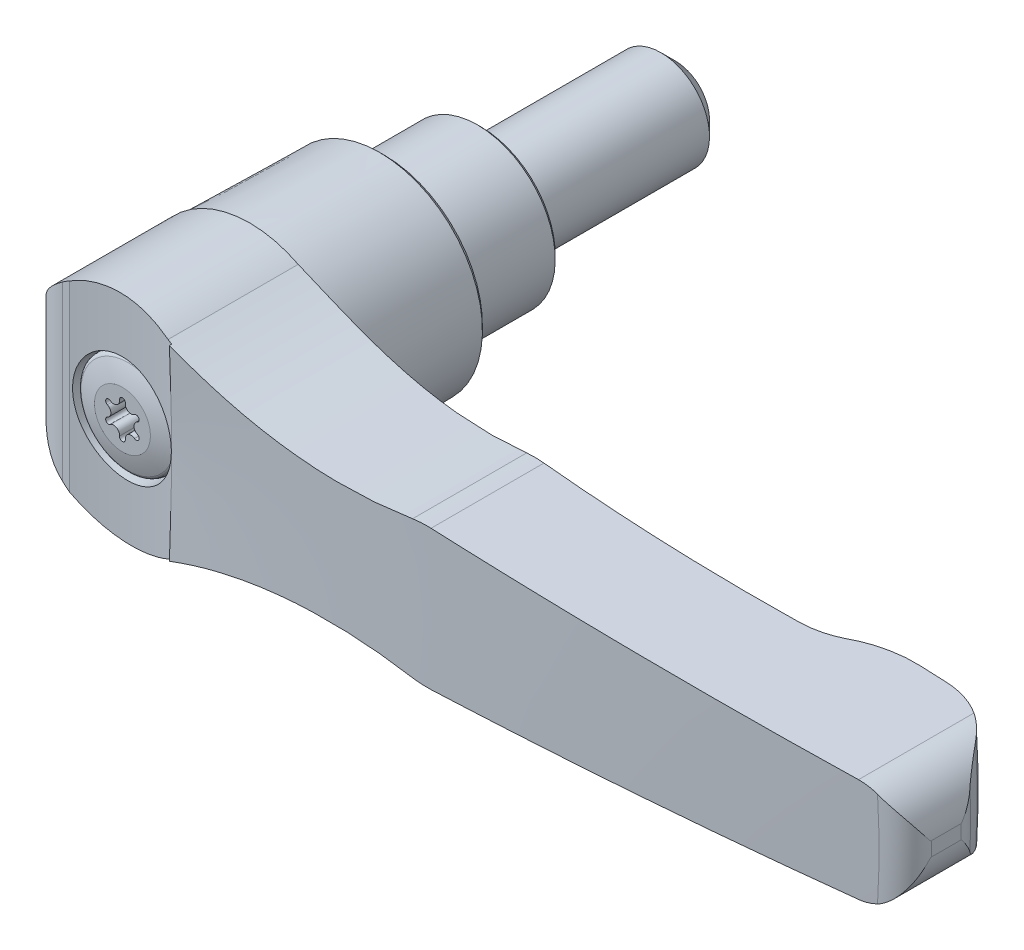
ISO-10303-21;
HEADER;
FILE_DESCRIPTION(('STEP AP214'),'2;1');
FILE_NAME('part.step','',(''),(''),'','','');
FILE_SCHEMA(('AUTOMOTIVE_DESIGN { 1 0 10303 214 1 1 1 1 }'));
ENDSEC;
DATA;
#1=APPLICATION_CONTEXT('core data for automotive mechanical design processes');
#2=APPLICATION_PROTOCOL_DEFINITION('international standard','automotive_design',2000,#1);
#3=PRODUCT_CONTEXT('',#1,'mechanical');
#4=PRODUCT('Part','Part','',(#3));
#5=PRODUCT_RELATED_PRODUCT_CATEGORY('part','',(#4));
#6=PRODUCT_DEFINITION_FORMATION('','',#4);
#7=PRODUCT_DEFINITION_CONTEXT('part definition',#1,'design');
#8=PRODUCT_DEFINITION('design','',#6,#7);
#9=PRODUCT_DEFINITION_SHAPE('','',#8);
#10=(LENGTH_UNIT() NAMED_UNIT(*) SI_UNIT(.MILLI.,.METRE.));
#11=(NAMED_UNIT(*) PLANE_ANGLE_UNIT() SI_UNIT($,.RADIAN.));
#12=(NAMED_UNIT(*) SI_UNIT($,.STERADIAN.) SOLID_ANGLE_UNIT());
#13=UNCERTAINTY_MEASURE_WITH_UNIT(LENGTH_MEASURE(1.E-05),#10,'distance_accuracy_value','');
#14=(GEOMETRIC_REPRESENTATION_CONTEXT(3) GLOBAL_UNCERTAINTY_ASSIGNED_CONTEXT((#13)) GLOBAL_UNIT_ASSIGNED_CONTEXT((#10,
#11,#12)) REPRESENTATION_CONTEXT('',''));
#15=CARTESIAN_POINT('',(0.,0.,0.));
#16=DIRECTION('',(0.,0.,1.));
#17=DIRECTION('',(1.,0.,0.));
#18=AXIS2_PLACEMENT_3D('',#15,#16,#17);
#19=CARTESIAN_POINT('',(0.,0.,27.75));
#20=DIRECTION('',(0.,0.,1.));
#21=DIRECTION('',(0.,-1.,0.));
#22=AXIS2_PLACEMENT_3D('',#19,#20,#21);
#23=CONICAL_SURFACE('',#22,5.15,0.0261799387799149);
#24=CARTESIAN_POINT('',(-3.82186723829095,3.79301788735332,36.7080789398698));
#25=CARTESIAN_POINT('',(-3.71534691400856,3.90028108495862,36.7062117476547));
#26=CARTESIAN_POINT('',(-3.60432455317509,4.00304517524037,36.704589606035));
#27=CARTESIAN_POINT('',(-3.37399930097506,4.19891926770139,36.7020096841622));
#28=CARTESIAN_POINT('',(-3.25469446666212,4.29202699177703,36.7010520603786));
#29=CARTESIAN_POINT('',(-3.0085890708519,4.4679591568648,36.6999680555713));
#30=CARTESIAN_POINT('',(-2.88178275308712,4.55077554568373,36.6998423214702));
#31=CARTESIAN_POINT('',(-2.62161264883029,4.7054859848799,36.7005758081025));
#32=CARTESIAN_POINT('',(-2.48824649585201,4.77737605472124,36.7014353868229));
#33=CARTESIAN_POINT('',(-2.21605276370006,4.90964048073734,36.7042708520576));
#34=CARTESIAN_POINT('',(-2.07722922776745,4.97002317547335,36.7062459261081));
#35=CARTESIAN_POINT('',(-1.79497035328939,5.07893378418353,36.7114191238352));
#36=CARTESIAN_POINT('',(-1.65153333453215,5.12745732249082,36.7146176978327));
#37=CARTESIAN_POINT('',(-1.36121177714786,5.21225729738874,36.7223126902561));
#38=CARTESIAN_POINT('',(-1.21432937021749,5.24854110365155,36.7268083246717));
#39=CARTESIAN_POINT('',(-0.918029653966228,5.30866584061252,36.7371445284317));
#40=CARTESIAN_POINT('',(-0.768611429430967,5.33250217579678,36.7429855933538));
#41=CARTESIAN_POINT('',(-0.468546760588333,5.36753437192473,36.7560131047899));
#42=CARTESIAN_POINT('',(-0.317902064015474,5.37874583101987,36.7631978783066));
#43=CARTESIAN_POINT('',(-0.0162164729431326,5.3885202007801,36.7788936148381));
#44=CARTESIAN_POINT('',(0.134824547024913,5.3870784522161,36.7874050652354));
#45=CARTESIAN_POINT('',(0.436130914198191,5.37156631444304,36.8056859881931));
#46=CARTESIAN_POINT('',(0.58639649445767,5.35749997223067,36.815455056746));
#47=CARTESIAN_POINT('',(0.885200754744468,5.31685490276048,36.8361582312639));
#48=CARTESIAN_POINT('',(1.03373877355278,5.29027153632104,36.8470927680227));
#49=CARTESIAN_POINT('',(1.32842726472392,5.22469830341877,36.8700247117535));
#50=CARTESIAN_POINT('',(1.47456945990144,5.18567228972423,36.882025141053));
#51=CARTESIAN_POINT('',(1.76304982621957,5.09551309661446,36.9068998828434));
#52=CARTESIAN_POINT('',(1.90538657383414,5.04437545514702,36.9197745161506));
#53=CARTESIAN_POINT('',(2.18517812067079,4.93037916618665,36.9461969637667));
#54=CARTESIAN_POINT('',(2.32263450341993,4.86752436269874,36.9597445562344));
#55=CARTESIAN_POINT('',(2.59177729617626,4.73053715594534,36.987298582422));
#56=CARTESIAN_POINT('',(2.72346154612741,4.65640057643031,37.0013051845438));
#57=CARTESIAN_POINT('',(3.11008075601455,4.41677811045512,37.0438406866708));
#58=CARTESIAN_POINT('',(3.35498940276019,4.23472918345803,37.0727317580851));
#59=CARTESIAN_POINT('',(3.81061841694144,3.83201391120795,37.1293132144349));
#60=CARTESIAN_POINT('',(4.02133817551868,3.61134687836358,37.1570035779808));
#61=CARTESIAN_POINT('',(4.40299814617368,3.13710131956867,37.2090851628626));
#62=CARTESIAN_POINT('',(4.57389146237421,2.88348453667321,37.2334724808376));
#63=CARTESIAN_POINT('',(4.8704857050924,2.35066468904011,37.2769076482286));
#64=CARTESIAN_POINT('',(4.99618921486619,2.07146308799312,37.2959558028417));
#65=CARTESIAN_POINT('',(5.19764854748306,1.49811632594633,37.3269450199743));
#66=CARTESIAN_POINT('',(5.27385550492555,1.20413322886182,37.3389501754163));
#67=CARTESIAN_POINT('',(5.37579370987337,0.607338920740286,37.3550873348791));
#68=CARTESIAN_POINT('',(5.40152887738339,0.304528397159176,37.3592199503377));
#69=CARTESIAN_POINT('',(5.40172286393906,-0.29769106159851,37.3592512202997));
#70=CARTESIAN_POINT('',(5.37675477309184,-0.597099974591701,37.35524190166));
#71=CARTESIAN_POINT('',(5.27746605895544,-1.18740212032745,37.3395194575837));
#72=CARTESIAN_POINT('',(5.20314585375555,-1.47829542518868,37.3278063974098));
#73=CARTESIAN_POINT('',(5.00745942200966,-2.04324075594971,37.2976749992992));
#74=CARTESIAN_POINT('',(4.88611822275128,-2.31730165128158,37.2792602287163));
#75=CARTESIAN_POINT('',(4.59994520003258,-2.84124816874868,37.2372335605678));
#76=CARTESIAN_POINT('',(4.43511078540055,-3.09113234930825,37.2136213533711));
#77=CARTESIAN_POINT('',(4.06463235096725,-3.56252869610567,37.1627855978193));
#78=CARTESIAN_POINT('',(3.85857005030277,-3.78370822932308,37.1355260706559));
#79=CARTESIAN_POINT('',(3.41254071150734,-4.18853503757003,37.0796758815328));
#80=CARTESIAN_POINT('',(3.17257159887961,-4.37218001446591,37.0510851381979));
#81=CARTESIAN_POINT('',(2.66278140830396,-4.69856745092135,36.994342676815));
#82=CARTESIAN_POINT('',(2.39268640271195,-4.84088357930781,36.9661981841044));
#83=CARTESIAN_POINT('',(1.83217160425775,-5.07809992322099,36.9125421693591));
#84=CARTESIAN_POINT('',(1.54175179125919,-5.17300009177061,36.8870306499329));
#85=CARTESIAN_POINT('',(0.948774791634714,-5.31257948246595,36.8401550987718));
#86=CARTESIAN_POINT('',(0.646218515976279,-5.35726246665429,36.8187907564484));
#87=CARTESIAN_POINT('',(0.0375867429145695,-5.39498080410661,36.7812079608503));
#88=CARTESIAN_POINT('',(-0.268488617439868,-5.38801816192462,36.7649893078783));
#89=CARTESIAN_POINT('',(-0.873320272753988,-5.32272310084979,36.7381921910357));
#90=CARTESIAN_POINT('',(-1.17211141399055,-5.26472804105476,36.7275774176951));
#91=CARTESIAN_POINT('',(-1.75586295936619,-5.09937269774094,36.7116339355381));
#92=CARTESIAN_POINT('',(-2.04082365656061,-4.99201346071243,36.7063051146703));
#93=CARTESIAN_POINT('',(-2.58762584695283,-4.73149608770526,36.7002185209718));
#94=CARTESIAN_POINT('',(-2.84955219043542,-4.57851601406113,36.6994432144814));
#95=CARTESIAN_POINT('',(-3.34420500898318,-4.23075694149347,36.7012936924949));
#96=CARTESIAN_POINT('',(-3.57693118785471,-4.03597751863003,36.7039195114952));
#97=CARTESIAN_POINT('',(-3.89903010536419,-3.71679841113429,36.709377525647));
#98=CARTESIAN_POINT('',(-4.00199323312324,-3.60577103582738,36.7114531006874));
#99=CARTESIAN_POINT('',(-4.19820603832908,-3.37546663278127,36.7159314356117));
#100=CARTESIAN_POINT('',(-4.29145927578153,-3.25619265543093,36.7183340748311));
#101=CARTESIAN_POINT('',(-4.46762204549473,-3.01018379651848,36.7232909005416));
#102=CARTESIAN_POINT('',(-4.55052767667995,-2.88344612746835,36.7258451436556));
#103=CARTESIAN_POINT('',(-4.70534739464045,-2.62348619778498,36.7309338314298));
#104=CARTESIAN_POINT('',(-4.77726552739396,-2.49026634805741,36.7334682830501));
#105=CARTESIAN_POINT('',(-4.90972659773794,-2.2180457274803,36.7383656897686));
#106=CARTESIAN_POINT('',(-4.97025295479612,-2.07903688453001,36.7407283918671));
#107=CARTESIAN_POINT('',(-5.07934789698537,-1.79645762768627,36.7451389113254));
#108=CARTESIAN_POINT('',(-5.12792090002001,-1.65288892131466,36.7471868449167));
#109=CARTESIAN_POINT('',(-5.21280239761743,-1.36211419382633,36.750853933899));
#110=CARTESIAN_POINT('',(-5.24910688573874,-1.21490700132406,36.7524729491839));
#111=CARTESIAN_POINT('',(-5.30915612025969,-0.918004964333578,36.7551917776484));
#112=CARTESIAN_POINT('',(-5.33290553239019,-0.768311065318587,36.7562917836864));
#113=CARTESIAN_POINT('',(-5.36767150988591,-0.467638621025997,36.7579130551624));
#114=CARTESIAN_POINT('',(-5.37870396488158,-0.316661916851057,36.7584350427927));
#115=CARTESIAN_POINT('',(-5.38800813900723,-0.0143709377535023,36.7588747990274));
#116=CARTESIAN_POINT('',(-5.38628458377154,0.136943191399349,36.7587927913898));
#117=CARTESIAN_POINT('',(-5.37009558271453,0.438975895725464,36.758029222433));
#118=CARTESIAN_POINT('',(-5.35562265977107,0.589694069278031,36.7573473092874));
#119=CARTESIAN_POINT('',(-5.31403708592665,0.889315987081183,36.7554202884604));
#120=CARTESIAN_POINT('',(-5.28692909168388,1.03822037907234,36.7541753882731));
#121=CARTESIAN_POINT('',(-5.22027737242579,1.33318140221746,36.7511900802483));
#122=CARTESIAN_POINT('',(-5.18073627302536,1.47923862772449,36.749449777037));
#123=CARTESIAN_POINT('',(-5.08951807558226,1.7674479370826,36.7455701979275));
#124=CARTESIAN_POINT('',(-5.03784539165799,1.90960142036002,36.7434310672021));
#125=CARTESIAN_POINT('',(-4.92276837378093,2.18894714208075,36.738876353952));
#126=CARTESIAN_POINT('',(-4.85937318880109,2.32614315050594,36.7364609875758));
#127=CARTESIAN_POINT('',(-4.72130226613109,2.59467891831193,36.7314958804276));
#128=CARTESIAN_POINT('',(-4.64662917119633,2.72602004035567,36.728946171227));
#129=CARTESIAN_POINT('',(-4.46041720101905,3.02367013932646,36.7230432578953));
#130=CARTESIAN_POINT('',(-4.34479079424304,3.18744274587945,36.7196987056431));
#131=CARTESIAN_POINT('',(-4.0960291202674,3.50111159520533,36.7134525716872));
#132=CARTESIAN_POINT('',(-3.96289380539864,3.65100780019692,36.7105509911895));
#133=CARTESIAN_POINT('',(-3.82186723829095,3.79301788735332,36.7080789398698));
#134=B_SPLINE_CURVE_WITH_KNOTS('',3,(#24,#25,#26,#27,#28,#29,#30,#31,#32,#33,#34,#35,#36,#37,
#38,#39,#40,#41,#42,#43,#44,#45,#46,#47,#48,#49,#50,#51,#52,#53,#54,#55,#56,#57,#58,#59,#60,#61,
#62,#63,#64,#65,#66,#67,#68,#69,#70,#71,#72,#73,#74,#75,#76,#77,#78,#79,#80,#81,#82,#83,#84,#85,
#86,#87,#88,#89,#90,#91,#92,#93,#94,#95,#96,#97,#98,#99,#100,#101,#102,#103,#104,#105,#106,#107,
#108,#109,#110,#111,#112,#113,#114,#115,#116,#117,#118,#119,#120,#121,#122,#123,#124,#125,#126,
#127,#128,#129,#130,#131,#132,#133),.UNSPECIFIED.,.T.,.F.,(4,2,2,2,2,2,2,2,2,2,2,2,2,2,2,2,2,2,
2,2,2,2,2,2,2,2,2,2,2,2,2,2,2,2,2,2,2,2,2,2,2,2,2,2,2,2,2,2,2,2,2,2,2,2,4),(0.,
0.453366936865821,0.906840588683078,1.36066684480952,1.81465803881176,2.26831899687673,
2.72214709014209,3.17570143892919,3.62942311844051,4.0825836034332,4.53591096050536,
4.98909304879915,5.44244323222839,5.89712263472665,6.35196980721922,6.8066680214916,
7.26153496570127,8.17638541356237,9.09125215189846,10.007190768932,10.9230770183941,
11.8304937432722,12.7378399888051,13.634987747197,14.5321279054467,15.4287912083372,
16.3255079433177,17.2318313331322,18.1382101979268,19.0536313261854,19.9690533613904,
20.8844068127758,21.7997247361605,22.7090368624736,23.6183297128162,24.5241189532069,
25.4299173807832,25.8837842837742,26.3374841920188,26.7913546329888,27.2450575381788,
27.6994157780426,28.1536058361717,28.6079440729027,29.0621133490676,29.5157145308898,
29.969147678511,30.4228469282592,30.8763790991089,31.3298155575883,31.7830872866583,
32.2360067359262,32.6888202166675,33.2890494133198,33.8892802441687),.UNSPECIFIED.);
#135=CARTESIAN_POINT('',(-3.82186723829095,3.79301788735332,36.7080789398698));
#136=VERTEX_POINT('',#135);
#137=EDGE_CURVE('E521',#136,#136,#134,.T.);
#138=ORIENTED_EDGE('',*,*,#137,.F.);
#139=EDGE_LOOP('',(#138));
#140=FACE_BOUND('',#139,.T.);
#141=CARTESIAN_POINT('',(0.,0.,33.));
#142=DIRECTION('',(0.,0.,-1.));
#143=DIRECTION('',(-1.,0.,0.));
#144=AXIS2_PLACEMENT_3D('',#141,#142,#143);
#145=CIRCLE('',#144,5.28747608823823);
#146=CARTESIAN_POINT('',(-5.28747608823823,0.,33.));
#147=VERTEX_POINT('',#146);
#148=EDGE_CURVE('E299',#147,#147,#145,.T.);
#149=ORIENTED_EDGE('',*,*,#148,.T.);
#150=EDGE_LOOP('',(#149));
#151=FACE_BOUND('',#150,.T.);
#152=ADVANCED_FACE('F14',(#140,#151),#23,.F.);
#153=CARTESIAN_POINT('',(0.,0.,-20.));
#154=DIRECTION('',(0.,0.,-1.));
#155=DIRECTION('',(0.,1.,0.));
#156=AXIS2_PLACEMENT_3D('',#153,#154,#155);
#157=CYLINDRICAL_SURFACE('',#156,5.);
#158=CARTESIAN_POINT('',(0.,0.,-18.5));
#159=DIRECTION('',(0.,0.,-1.));
#160=DIRECTION('',(0.,1.,0.));
#161=AXIS2_PLACEMENT_3D('',#158,#159,#160);
#162=CIRCLE('',#161,5.);
#163=CARTESIAN_POINT('',(0.,5.,-18.5));
#164=VERTEX_POINT('',#163);
#165=EDGE_CURVE('E9',#164,#164,#162,.F.);
#166=ORIENTED_EDGE('',*,*,#165,.T.);
#167=EDGE_LOOP('',(#166));
#168=FACE_BOUND('',#167,.T.);
#169=CARTESIAN_POINT('',(0.,0.,0.));
#170=DIRECTION('',(0.,0.,-1.));
#171=DIRECTION('',(0.,1.,0.));
#172=AXIS2_PLACEMENT_3D('',#169,#170,#171);
#173=CIRCLE('',#172,5.);
#174=CARTESIAN_POINT('',(0.,5.,0.));
#175=VERTEX_POINT('',#174);
#176=EDGE_CURVE('E362',#175,#175,#173,.T.);
#177=ORIENTED_EDGE('',*,*,#176,.T.);
#178=EDGE_LOOP('',(#177));
#179=FACE_BOUND('',#178,.T.);
#180=ADVANCED_FACE('F512',(#168,#179),#157,.T.);
#181=CARTESIAN_POINT('',(7.6,0.,0.));
#182=DIRECTION('',(0.,0.,1.));
#183=DIRECTION('',(0.,-1.,0.));
#184=AXIS2_PLACEMENT_3D('',#181,#182,#183);
#185=PLANE('',#184);
#186=ORIENTED_EDGE('',*,*,#176,.F.);
#187=EDGE_LOOP('',(#186));
#188=FACE_BOUND('',#187,.T.);
#189=CARTESIAN_POINT('',(0.,0.,0.));
#190=DIRECTION('',(0.,0.,-1.));
#191=DIRECTION('',(0.,1.,0.));
#192=AXIS2_PLACEMENT_3D('',#189,#190,#191);
#193=CIRCLE('',#192,7.6);
#194=CARTESIAN_POINT('',(0.,7.6,0.));
#195=VERTEX_POINT('',#194);
#196=EDGE_CURVE('E985',#195,#195,#193,.T.);
#197=ORIENTED_EDGE('',*,*,#196,.T.);
#198=EDGE_LOOP('',(#197));
#199=FACE_BOUND('',#198,.T.);
#200=ADVANCED_FACE('F403',(#188,#199),#185,.F.);
#201=CARTESIAN_POINT('',(-2.9000000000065,-22.,89.3000000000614));
#202=DIRECTION('',(0.,1.,0.));
#203=DIRECTION('',(-1.,0.,0.));
#204=AXIS2_PLACEMENT_3D('',#201,#202,#203);
#205=CYLINDRICAL_SURFACE('',#204,52.6000000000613);
#206=CARTESIAN_POINT('',(4.99999999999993,9.79795897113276,37.29663472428));
#207=CARTESIAN_POINT('',(4.72836499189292,9.9366097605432,37.2553500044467));
#208=CARTESIAN_POINT('',(4.45077156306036,10.0639978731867,37.2153761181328));
#209=CARTESIAN_POINT('',(3.88554818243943,10.2954169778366,37.1387392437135));
#210=CARTESIAN_POINT('',(3.59791744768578,10.3994461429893,37.1020765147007));
#211=CARTESIAN_POINT('',(3.01491777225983,10.5831754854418,37.0328024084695));
#212=CARTESIAN_POINT('',(2.71955925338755,10.6629067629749,37.0001858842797));
#213=CARTESIAN_POINT('',(2.12279313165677,10.79755975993,36.9395048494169));
#214=CARTESIAN_POINT('',(1.82138582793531,10.8524827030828,36.9114401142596));
#215=CARTESIAN_POINT('',(1.21421772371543,10.9370815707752,36.8602616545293));
#216=CARTESIAN_POINT('',(0.90845167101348,10.966723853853,36.8371545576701));
#217=CARTESIAN_POINT('',(0.295018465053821,11.0003346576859,36.7962250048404));
#218=CARTESIAN_POINT('',(-0.0126494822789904,11.0042916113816,36.7784049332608));
#219=CARTESIAN_POINT('',(-0.627464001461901,10.9863940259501,36.7482132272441));
#220=CARTESIAN_POINT('',(-0.934610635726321,10.9645428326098,36.7358408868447));
#221=CARTESIAN_POINT('',(-1.54601934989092,10.8951569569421,36.7165401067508));
#222=CARTESIAN_POINT('',(-1.85028266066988,10.8476337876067,36.709609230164));
#223=CARTESIAN_POINT('',(-2.46439079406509,10.7251200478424,36.7008764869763));
#224=CARTESIAN_POINT('',(-2.77405858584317,10.64922685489,36.6992625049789));
#225=CARTESIAN_POINT('',(-3.38564496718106,10.4708596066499,36.7013524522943));
#226=CARTESIAN_POINT('',(-3.68756293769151,10.3683834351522,36.705056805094));
#227=CARTESIAN_POINT('',(-4.28200890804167,10.1373700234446,36.7173174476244));
#228=CARTESIAN_POINT('',(-4.5745119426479,10.0087692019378,36.7258856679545));
#229=CARTESIAN_POINT('',(-5.14711147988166,9.72673276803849,36.7472344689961));
#230=CARTESIAN_POINT('',(-5.42720860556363,9.57329840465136,36.7600148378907));
#231=CARTESIAN_POINT('',(-5.70000000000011,9.40797534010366,36.774577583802));
#232=B_SPLINE_CURVE_WITH_KNOTS('',3,(#206,#207,#208,#209,#210,#211,#212,#213,#214,#215,#216,
#217,#218,#219,#220,#221,#222,#223,#224,#225,#226,#227,#228,#229,#230,#231),.UNSPECIFIED.,.F.,
.F.,(4,2,2,2,2,2,2,2,2,2,2,2,4),(0.,0.923020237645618,1.84611263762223,2.76801850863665,
3.68987889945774,4.61296412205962,5.53646501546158,6.4598461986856,7.38281362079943,
8.33806499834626,9.29339244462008,10.2510734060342,11.2087062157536),.UNSPECIFIED.);
#233=CARTESIAN_POINT('',(4.99999999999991,9.7979589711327,37.29663472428));
#234=VERTEX_POINT('',#233);
#235=CARTESIAN_POINT('',(-5.7000000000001,9.40797534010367,36.774577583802));
#236=VERTEX_POINT('',#235);
#237=EDGE_CURVE('E435',#234,#236,#232,.T.);
#238=ORIENTED_EDGE('',*,*,#237,.T.);
#239=DIRECTION('',(0.,1.,0.));
#240=VECTOR('',#239,1.);
#241=CARTESIAN_POINT('',(-5.7000000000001,-22.,36.774577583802));
#242=LINE('',#241,#240);
#243=CARTESIAN_POINT('',(-5.7000000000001,-9.4079753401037,36.774577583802));
#244=VERTEX_POINT('',#243);
#245=EDGE_CURVE('E368',#244,#236,#242,.T.);
#246=ORIENTED_EDGE('',*,*,#245,.F.);
#247=CARTESIAN_POINT('',(-5.70000000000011,-9.40797534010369,36.774577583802));
#248=CARTESIAN_POINT('',(-5.43970332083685,-9.56571993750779,36.7606846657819));
#249=CARTESIAN_POINT('',(-5.17275915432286,-9.71264560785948,36.7484111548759));
#250=CARTESIAN_POINT('',(-4.62749279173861,-9.9839292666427,36.727671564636));
#251=CARTESIAN_POINT('',(-4.34917039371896,-10.1082868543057,36.7192055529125));
#252=CARTESIAN_POINT('',(-3.7836735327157,-10.3332602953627,36.706663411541));
#253=CARTESIAN_POINT('',(-3.49651907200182,-10.4339258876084,36.7025780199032));
#254=CARTESIAN_POINT('',(-2.91484226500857,-10.6111316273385,36.699198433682));
#255=CARTESIAN_POINT('',(-2.62032018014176,-10.6876726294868,36.6999040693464));
#256=CARTESIAN_POINT('',(-2.02570589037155,-10.8161512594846,36.7064252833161));
#257=CARTESIAN_POINT('',(-1.7256084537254,-10.8680644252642,36.7122459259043));
#258=CARTESIAN_POINT('',(-1.12215614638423,-10.9468441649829,36.7291866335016));
#259=CARTESIAN_POINT('',(-0.818799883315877,-10.9736995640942,36.7403090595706));
#260=CARTESIAN_POINT('',(-0.211043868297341,-11.0021831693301,36.7678948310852));
#261=CARTESIAN_POINT('',(0.0933562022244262,-11.0038028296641,36.7843599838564));
#262=CARTESIAN_POINT('',(0.700782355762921,-10.981859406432,36.8225100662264));
#263=CARTESIAN_POINT('',(1.00380896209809,-10.9583068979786,36.844192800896));
#264=CARTESIAN_POINT('',(1.62703646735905,-10.883833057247,36.8941780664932));
#265=CARTESIAN_POINT('',(1.94700070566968,-10.8311562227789,36.9228309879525));
#266=CARTESIAN_POINT('',(2.58058446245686,-10.6979165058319,36.9853308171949));
#267=CARTESIAN_POINT('',(2.89420315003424,-10.6173499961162,37.0191784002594));
#268=CARTESIAN_POINT('',(3.51321915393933,-10.4289071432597,37.0914975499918));
#269=CARTESIAN_POINT('',(3.81860000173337,-10.3209800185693,37.1299776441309));
#270=CARTESIAN_POINT('',(4.41821395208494,-10.078894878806,37.2106925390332));
#271=CARTESIAN_POINT('',(4.71244874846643,-9.94474086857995,37.2529267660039));
#272=CARTESIAN_POINT('',(5.0000000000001,-9.7979589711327,37.29663472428));
#273=B_SPLINE_CURVE_WITH_KNOTS('',3,(#247,#248,#249,#250,#251,#252,#253,#254,#255,#256,#257,
#258,#259,#260,#261,#262,#263,#264,#265,#266,#267,#268,#269,#270,#271,#272),.UNSPECIFIED.,.F.,
.F.,(4,2,2,2,2,2,2,2,2,2,2,2,4),(0.,0.913785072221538,1.82758637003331,2.73945177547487,
3.65128487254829,4.56402177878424,5.47716553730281,6.39061851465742,7.30368789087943,
8.27897178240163,9.25438256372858,10.2316171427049,11.2087026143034),.UNSPECIFIED.);
#274=CARTESIAN_POINT('',(5.00000000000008,-9.79795897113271,37.29663472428));
#275=VERTEX_POINT('',#274);
#276=EDGE_CURVE('E421',#244,#275,#273,.T.);
#277=ORIENTED_EDGE('',*,*,#276,.T.);
#278=CARTESIAN_POINT('',(5.43597073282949,-9.62987816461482,37.36473652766));
#279=CARTESIAN_POINT('',(5.36321973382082,-9.65752809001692,37.3530600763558));
#280=CARTESIAN_POINT('',(5.29051333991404,-9.68535978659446,37.341546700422));
#281=CARTESIAN_POINT('',(5.14518976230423,-9.74138672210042,37.3188460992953));
#282=CARTESIAN_POINT('',(5.07257257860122,-9.76958196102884,37.3076588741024));
#283=CARTESIAN_POINT('',(5.00000000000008,-9.79795897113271,37.29663472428));
#284=B_SPLINE_CURVE_WITH_KNOTS('',3,(#278,#279,#280,#281,#282,#283),.UNSPECIFIED.,.F.,.F.,(4,2,
4),(0.,0.236094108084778,0.472188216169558),.UNSPECIFIED.);
#285=CARTESIAN_POINT('',(5.4359707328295,-9.62987816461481,37.36473652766));
#286=VERTEX_POINT('',#285);
#287=EDGE_CURVE('E410',#286,#275,#284,.T.);
#288=ORIENTED_EDGE('',*,*,#287,.F.);
#289=DIRECTION('',(0.,1.,0.));
#290=VECTOR('',#289,1.);
#291=CARTESIAN_POINT('',(5.43597073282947,-22.,37.36473652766));
#292=LINE('',#291,#290);
#293=CARTESIAN_POINT('',(5.43597073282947,0.,37.36473652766));
#294=VERTEX_POINT('',#293);
#295=EDGE_CURVE('E37',#286,#294,#292,.T.);
#296=ORIENTED_EDGE('',*,*,#295,.T.);
#297=CARTESIAN_POINT('',(5.43597073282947,9.62987816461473,37.36473652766));
#298=VERTEX_POINT('',#297);
#299=EDGE_CURVE('E365',#294,#298,#292,.T.);
#300=ORIENTED_EDGE('',*,*,#299,.T.);
#301=CARTESIAN_POINT('',(4.99999999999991,9.7979589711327,37.29663472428));
#302=CARTESIAN_POINT('',(5.07257257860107,9.76958196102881,37.3076588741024));
#303=CARTESIAN_POINT('',(5.14518976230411,9.74138672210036,37.3188460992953));
#304=CARTESIAN_POINT('',(5.29051333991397,9.68535978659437,37.341546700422));
#305=CARTESIAN_POINT('',(5.36321973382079,9.65752809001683,37.3530600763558));
#306=CARTESIAN_POINT('',(5.43597073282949,9.62987816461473,37.36473652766));
#307=B_SPLINE_CURVE_WITH_KNOTS('',3,(#301,#302,#303,#304,#305,#306),.UNSPECIFIED.,.F.,.F.,(4,2,
4),(0.,0.236094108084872,0.472188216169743),.UNSPECIFIED.);
#308=EDGE_CURVE('E428',#234,#298,#307,.T.);
#309=ORIENTED_EDGE('',*,*,#308,.F.);
#310=EDGE_LOOP('',(#238,#246,#277,#288,#296,#300,#309));
#311=FACE_BOUND('',#310,.T.);
#312=ORIENTED_EDGE('',*,*,#137,.T.);
#313=EDGE_LOOP('',(#312));
#314=FACE_BOUND('',#313,.T.);
#315=ADVANCED_FACE('F399',(#311,#314),#205,.F.);
#316=CARTESIAN_POINT('',(0.,0.,-577.800000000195));
#317=DIRECTION('',(0.,0.,-1.));
#318=DIRECTION('',(0.,1.,0.));
#319=AXIS2_PLACEMENT_3D('',#316,#317,#318);
#320=DEGENERATE_TOROIDAL_SURFACE('',#319,33.3999999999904,615.800000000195,.T.);
#321=CARTESIAN_POINT('',(30.9002,7.10003333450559,37.9976683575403));
#322=CARTESIAN_POINT('',(30.2294569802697,6.98822969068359,37.9958049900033));
#323=CARTESIAN_POINT('',(29.5563953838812,6.8904055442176,37.9928133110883));
#324=CARTESIAN_POINT('',(28.2067936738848,6.7228472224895,37.9846275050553));
#325=CARTESIAN_POINT('',(27.5302535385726,6.6531132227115,37.9794333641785));
#326=CARTESIAN_POINT('',(26.1747400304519,6.54185757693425,37.9668957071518));
#327=CARTESIAN_POINT('',(25.4957662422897,6.5003410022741,37.9595518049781));
#328=CARTESIAN_POINT('',(24.1367720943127,6.44559969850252,37.9428222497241));
#329=CARTESIAN_POINT('',(23.4567517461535,6.43237465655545,37.9334366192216));
#330=CARTESIAN_POINT('',(21.4461065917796,6.43516844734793,37.9028483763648));
#331=CARTESIAN_POINT('',(20.1152587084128,6.49125306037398,37.878929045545));
#332=CARTESIAN_POINT('',(18.1264981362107,6.65637631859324,37.8390449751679));
#333=CARTESIAN_POINT('',(17.464852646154,6.72491301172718,37.8250833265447));
#334=CARTESIAN_POINT('',(16.1449136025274,6.88885393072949,37.7962639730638));
#335=CARTESIAN_POINT('',(15.4866198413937,6.98425647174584,37.7814063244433));
#336=CARTESIAN_POINT('',(13.9966493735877,7.23126043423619,37.7473031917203));
#337=CARTESIAN_POINT('',(13.1663283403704,7.39108521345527,37.727959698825));
#338=CARTESIAN_POINT('',(11.5152169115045,7.75343699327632,37.690522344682));
#339=CARTESIAN_POINT('',(10.694424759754,7.9559559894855,37.6724282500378));
#340=CARTESIAN_POINT('',(9.05285416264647,8.40635359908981,37.6397736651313));
#341=CARTESIAN_POINT('',(8.23223752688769,8.6548288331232,37.6252663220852));
#342=CARTESIAN_POINT('',(7.01185980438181,9.05958984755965,37.608666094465));
#343=CARTESIAN_POINT('',(6.60676296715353,9.19987583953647,37.603992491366));
#344=CARTESIAN_POINT('',(5.80036915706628,9.49103692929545,37.5966508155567));
#345=CARTESIAN_POINT('',(5.39907222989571,9.64191215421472,37.5939827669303));
#346=CARTESIAN_POINT('',(4.9997999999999,9.79803717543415,37.5924593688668));
#347=B_SPLINE_CURVE_WITH_KNOTS('',3,(#321,#322,#323,#324,#325,#326,#327,#328,#329,#330,#331,
#332,#333,#334,#335,#336,#337,#338,#339,#340,#341,#342,#343,#344,#345,#346),.UNSPECIFIED.,.F.,
.F.,(4,2,2,2,2,2,2,2,2,2,2,2,4),(0.,2.03983506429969,4.07968287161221,6.11989719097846,
8.16008895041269,12.1515193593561,14.1470960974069,16.1425477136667,18.6787308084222,
21.2144388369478,23.7857285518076,25.0717731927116,26.3578332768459),.UNSPECIFIED.);
#348=CARTESIAN_POINT('',(30.9,7.1,37.997667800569));
#349=VERTEX_POINT('',#348);
#350=CARTESIAN_POINT('',(5.4359707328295,9.62987816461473,37.5945767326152));
#351=VERTEX_POINT('',#350);
#352=EDGE_CURVE('E1012',#349,#351,#347,.T.);
#353=ORIENTED_EDGE('',*,*,#352,.T.);
#354=CARTESIAN_POINT('',(5.4359707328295,0.139704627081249,37.364818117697));
#355=CARTESIAN_POINT('',(5.4359707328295,0.0263223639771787,37.3646847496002));
#356=CARTESIAN_POINT('',(5.4359707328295,-0.087059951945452,37.3647143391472));
#357=CARTESIAN_POINT('',(5.4359707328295,-0.31382488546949,37.3650945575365));
#358=CARTESIAN_POINT('',(5.4359707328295,-0.427207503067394,37.3654451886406));
#359=CARTESIAN_POINT('',(5.4359707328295,-0.767350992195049,37.3669741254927));
#360=CARTESIAN_POINT('',(5.4359707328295,-0.994109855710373,37.3686294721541));
#361=CARTESIAN_POINT('',(5.4359707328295,-1.44760096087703,37.3731244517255));
#362=CARTESIAN_POINT('',(5.4359707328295,-1.67433320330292,37.3759640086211));
#363=CARTESIAN_POINT('',(5.4359707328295,-2.12778335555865,37.3826896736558));
#364=CARTESIAN_POINT('',(5.4359707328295,-2.35450126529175,37.3865757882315));
#365=CARTESIAN_POINT('',(5.4359707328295,-2.80788425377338,37.3952314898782));
#366=CARTESIAN_POINT('',(5.4359707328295,-3.03454933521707,37.4000009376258));
#367=CARTESIAN_POINT('',(5.4359707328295,-3.48786247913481,37.4102594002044));
#368=CARTESIAN_POINT('',(5.4359707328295,-3.71451054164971,37.4157484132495));
#369=CARTESIAN_POINT('',(5.4359707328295,-4.3944531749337,37.4330569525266));
#370=CARTESIAN_POINT('',(5.4359707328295,-4.84772616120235,37.445717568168));
#371=CARTESIAN_POINT('',(5.4359707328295,-5.75417804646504,37.4722642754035));
#372=CARTESIAN_POINT('',(5.4359707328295,-6.20735695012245,37.4861502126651));
#373=CARTESIAN_POINT('',(5.4359707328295,-7.11369823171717,37.5144555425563));
#374=CARTESIAN_POINT('',(5.4359707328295,-7.56686060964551,37.528874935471));
#375=CARTESIAN_POINT('',(5.4359707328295,-8.47318366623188,37.5577843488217));
#376=CARTESIAN_POINT('',(5.4359707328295,-8.92634434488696,37.5722743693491));
#377=CARTESIAN_POINT('',(5.4359707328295,-9.83267306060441,37.6010218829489));
#378=CARTESIAN_POINT('',(5.4359707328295,-10.2858410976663,37.615279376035));
#379=CARTESIAN_POINT('',(5.4359707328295,-11.6453393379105,37.657378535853));
#380=CARTESIAN_POINT('',(5.4359707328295,-12.5516906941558,37.6845477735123));
#381=CARTESIAN_POINT('',(5.4359707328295,-14.3644725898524,37.7361289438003));
#382=CARTESIAN_POINT('',(5.4359707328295,-15.2709031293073,37.7605408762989));
#383=CARTESIAN_POINT('',(5.4359707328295,-17.0838968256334,37.8061411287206));
#384=CARTESIAN_POINT('',(5.4359707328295,-17.9904599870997,37.8273292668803));
#385=CARTESIAN_POINT('',(5.4359707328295,-19.8036600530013,37.8662106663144));
#386=CARTESIAN_POINT('',(5.4359707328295,-20.7102969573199,37.8839039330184));
#387=CARTESIAN_POINT('',(5.4359707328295,-22.5236728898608,37.9156376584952));
#388=CARTESIAN_POINT('',(5.4359707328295,-23.4304119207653,37.929677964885));
#389=CARTESIAN_POINT('',(5.4359707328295,-25.2439454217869,37.9540054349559));
#390=CARTESIAN_POINT('',(5.4359707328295,-26.1507398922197,37.9642925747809));
#391=CARTESIAN_POINT('',(5.4359707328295,-28.8758498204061,37.9894632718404));
#392=CARTESIAN_POINT('',(5.4359707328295,-30.6942231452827,37.9985735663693));
#393=CARTESIAN_POINT('',(5.4359707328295,-34.3309833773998,38.001117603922));
#394=CARTESIAN_POINT('',(5.4359707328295,-36.1493702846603,37.9945512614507));
#395=CARTESIAN_POINT('',(5.4359707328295,-41.6044064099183,37.9510940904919));
#396=CARTESIAN_POINT('',(5.4359707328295,-45.2408980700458,37.8904448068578));
#397=CARTESIAN_POINT('',(5.4359707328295,-52.5123746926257,37.7052257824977));
#398=CARTESIAN_POINT('',(5.4359707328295,-56.147359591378,37.5806535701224));
#399=CARTESIAN_POINT('',(5.4359707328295,-63.4145638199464,37.2674123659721));
#400=CARTESIAN_POINT('',(5.4359707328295,-67.046783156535,37.0787435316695));
#401=CARTESIAN_POINT('',(5.4359707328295,-74.3112406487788,36.6370156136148));
#402=CARTESIAN_POINT('',(5.4359707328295,-77.943474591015,36.3838872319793));
#403=CARTESIAN_POINT('',(5.4359707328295,-85.2028595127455,35.813362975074));
#404=CARTESIAN_POINT('',(5.4359707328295,-88.8300105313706,35.4959675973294));
#405=CARTESIAN_POINT('',(5.4359707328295,-96.0785329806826,34.7969300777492));
#406=CARTESIAN_POINT('',(5.4359707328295,-99.6999037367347,34.4152809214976));
#407=CARTESIAN_POINT('',(5.4359707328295,-106.935372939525,33.5878576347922));
#408=CARTESIAN_POINT('',(5.4359707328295,-110.54947113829,33.1420813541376));
#409=CARTESIAN_POINT('',(5.4359707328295,-121.445659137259,31.6999206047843));
#410=CARTESIAN_POINT('',(5.4359707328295,-128.715080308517,30.6051121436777));
#411=CARTESIAN_POINT('',(5.4359707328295,-139.58597763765,28.768381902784));
#412=CARTESIAN_POINT('',(5.4359707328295,-143.204228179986,28.1236865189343));
#413=CARTESIAN_POINT('',(5.4359707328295,-150.428776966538,26.7696133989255));
#414=CARTESIAN_POINT('',(5.4359707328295,-154.035074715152,26.0602330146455));
#415=CARTESIAN_POINT('',(5.4359707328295,-164.835392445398,23.8351440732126));
#416=CARTESIAN_POINT('',(5.4359707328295,-172.00972097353,22.2226762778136));
#417=CARTESIAN_POINT('',(5.4359707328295,-186.295919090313,18.7419286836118));
#418=CARTESIAN_POINT('',(5.4359707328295,-193.407788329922,16.8736474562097));
#419=CARTESIAN_POINT('',(5.4359707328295,-207.565393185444,12.8821360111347));
#420=CARTESIAN_POINT('',(5.4359707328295,-214.611075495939,10.7587166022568));
#421=CARTESIAN_POINT('',(5.4359707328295,-228.621811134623,6.26076727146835));
#422=CARTESIAN_POINT('',(5.4359707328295,-235.586864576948,3.88623770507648));
#423=CARTESIAN_POINT('',(5.4359707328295,-249.427511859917,-1.11092136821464));
#424=CARTESIAN_POINT('',(5.4359707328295,-256.303103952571,-3.73355571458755));
#425=CARTESIAN_POINT('',(5.4359707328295,-269.956066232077,-9.2236157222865));
#426=CARTESIAN_POINT('',(5.4359707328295,-276.733435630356,-12.0910433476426));
#427=CARTESIAN_POINT('',(5.4359707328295,-287.411895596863,-16.8363541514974));
#428=CARTESIAN_POINT('',(5.4359707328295,-291.348165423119,-18.6354901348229));
#429=CARTESIAN_POINT('',(5.4359707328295,-299.181702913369,-22.3162445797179));
#430=CARTESIAN_POINT('',(5.4359707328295,-303.078972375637,-24.1978592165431));
#431=CARTESIAN_POINT('',(5.4359707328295,-314.710300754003,-29.9654969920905));
#432=CARTESIAN_POINT('',(5.4359707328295,-322.383911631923,-33.9743282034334));
#433=CARTESIAN_POINT('',(5.4359707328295,-337.555961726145,-42.3122719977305));
#434=CARTESIAN_POINT('',(5.4359707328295,-345.054380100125,-46.6414224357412));
#435=CARTESIAN_POINT('',(5.4359707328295,-359.862045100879,-55.6120111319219));
#436=CARTESIAN_POINT('',(5.4359707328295,-367.171293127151,-60.2534470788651));
#437=CARTESIAN_POINT('',(5.4359707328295,-381.590156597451,-69.8420495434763));
#438=CARTESIAN_POINT('',(5.4359707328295,-388.699700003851,-74.7893243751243));
#439=CARTESIAN_POINT('',(5.4359707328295,-402.703827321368,-84.9793317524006));
#440=CARTESIAN_POINT('',(5.4359707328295,-409.598410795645,-90.2220648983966));
#441=CARTESIAN_POINT('',(5.4359707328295,-423.160104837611,-100.99347121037));
#442=CARTESIAN_POINT('',(5.4359707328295,-429.827222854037,-106.522134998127));
#443=CARTESIAN_POINT('',(5.4359707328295,-442.922356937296,-117.855720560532));
#444=CARTESIAN_POINT('',(5.4359707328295,-449.350373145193,-123.660642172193));
#445=CARTESIAN_POINT('',(5.4359707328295,-461.953986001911,-135.534643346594));
#446=CARTESIAN_POINT('',(5.4359707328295,-468.129657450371,-141.603643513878));
#447=CARTESIAN_POINT('',(5.4359707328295,-480.219630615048,-153.996624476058));
#448=CARTESIAN_POINT('',(5.4359707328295,-486.133932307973,-160.320605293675));
#449=CARTESIAN_POINT('',(5.4359707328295,-497.690689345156,-173.212347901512));
#450=CARTESIAN_POINT('',(5.4359707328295,-503.333142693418,-179.780111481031));
#451=CARTESIAN_POINT('',(5.4359707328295,-514.336121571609,-193.147695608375));
#452=CARTESIAN_POINT('',(5.4359707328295,-519.696647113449,-199.947516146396));
#453=CARTESIAN_POINT('',(5.4359707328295,-530.125574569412,-213.766243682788));
#454=CARTESIAN_POINT('',(5.4359707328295,-535.19401350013,-220.785122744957));
#455=CARTESIAN_POINT('',(5.4359707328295,-545.030492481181,-235.030309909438));
#456=CARTESIAN_POINT('',(5.4359707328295,-549.798532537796,-242.256618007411));
#457=CARTESIAN_POINT('',(5.4359707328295,-559.025727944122,-256.903802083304));
#458=CARTESIAN_POINT('',(5.4359707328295,-563.484883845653,-264.324677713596));
#459=CARTESIAN_POINT('',(5.4359707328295,-572.086391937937,-279.347815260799));
#460=CARTESIAN_POINT('',(5.4359707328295,-576.228744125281,-286.95007717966));
#461=CARTESIAN_POINT('',(5.4359707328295,-584.189397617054,-302.322698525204));
#462=CARTESIAN_POINT('',(5.4359707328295,-588.007689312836,-310.09306292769));
#463=CARTESIAN_POINT('',(5.4359707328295,-595.313295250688,-325.787854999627));
#464=CARTESIAN_POINT('',(5.4359707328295,-598.80060949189,-333.71228266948));
#465=CARTESIAN_POINT('',(5.4359707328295,-605.438061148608,-349.701114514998));
#466=CARTESIAN_POINT('',(5.4359707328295,-608.588198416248,-357.765518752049));
#467=CARTESIAN_POINT('',(5.4359707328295,-614.545693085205,-374.01996116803));
#468=CARTESIAN_POINT('',(5.4359707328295,-617.353050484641,-382.20999934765));
#469=CARTESIAN_POINT('',(5.4359707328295,-622.620087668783,-398.701441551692));
#470=CARTESIAN_POINT('',(5.4359707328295,-625.079755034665,-407.002849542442));
#471=CARTESIAN_POINT('',(5.4359707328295,-629.646919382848,-423.701983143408));
#472=CARTESIAN_POINT('',(5.4359707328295,-631.754416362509,-432.099708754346));
#473=CARTESIAN_POINT('',(5.4359707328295,-635.613492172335,-448.976544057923));
#474=CARTESIAN_POINT('',(5.4359707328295,-637.365071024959,-457.455653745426));
#475=CARTESIAN_POINT('',(5.4359707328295,-640.509196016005,-474.480180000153));
#476=CARTESIAN_POINT('',(5.4359707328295,-641.901742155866,-483.025596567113));
#477=CARTESIAN_POINT('',(5.4359707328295,-644.32531330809,-500.167455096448));
#478=CARTESIAN_POINT('',(5.4359707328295,-645.356341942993,-508.763896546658));
#479=CARTESIAN_POINT('',(5.4359707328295,-647.055064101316,-525.992603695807));
#480=CARTESIAN_POINT('',(5.4359707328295,-647.722757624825,-534.624869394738));
#481=CARTESIAN_POINT('',(5.4359707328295,-648.693622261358,-551.909875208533));
#482=CARTESIAN_POINT('',(5.4359707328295,-648.99679337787,-560.562615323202));
#483=CARTESIAN_POINT('',(5.4359707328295,-649.238074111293,-577.873183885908));
#484=CARTESIAN_POINT('',(5.4359707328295,-649.176183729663,-586.531012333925));
#485=CARTESIAN_POINT('',(5.4359707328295,-648.687456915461,-603.836171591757));
#486=CARTESIAN_POINT('',(5.4359707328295,-648.260628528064,-612.483502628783));
#487=CARTESIAN_POINT('',(5.4359707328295,-647.042795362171,-629.752482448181));
#488=CARTESIAN_POINT('',(5.4359707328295,-646.251790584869,-638.374131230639));
#489=CARTESIAN_POINT('',(5.4359707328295,-644.307011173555,-655.57641610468));
#490=CARTESIAN_POINT('',(5.4359707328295,-643.153236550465,-664.1570521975));
#491=CARTESIAN_POINT('',(5.4359707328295,-640.484968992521,-681.26205469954));
#492=CARTESIAN_POINT('',(5.4359707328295,-638.970476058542,-689.786421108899));
#493=CARTESIAN_POINT('',(5.4359707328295,-635.583505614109,-706.763522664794));
#494=CARTESIAN_POINT('',(5.4359707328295,-633.711036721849,-715.216259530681));
#495=CARTESIAN_POINT('',(5.4359707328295,-629.611420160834,-732.03528066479));
#496=CARTESIAN_POINT('',(5.4359707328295,-627.38427249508,-740.401564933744));
#497=CARTESIAN_POINT('',(5.4359707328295,-622.579258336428,-757.032805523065));
#498=CARTESIAN_POINT('',(5.4359707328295,-620.001391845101,-765.297761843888));
#499=CARTESIAN_POINT('',(5.4359707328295,-614.499523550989,-781.711651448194));
#500=CARTESIAN_POINT('',(5.4359707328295,-611.575521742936,-789.860584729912));
#501=CARTESIAN_POINT('',(5.4359707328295,-605.386368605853,-806.028496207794));
#502=CARTESIAN_POINT('',(5.4359707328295,-602.12119379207,-814.047465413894));
#503=CARTESIAN_POINT('',(5.4359707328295,-595.255667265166,-829.9406140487));
#504=CARTESIAN_POINT('',(5.4359707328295,-591.655315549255,-837.814793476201));
#505=CARTESIAN_POINT('',(5.4359707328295,-584.125837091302,-853.404361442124));
#506=CARTESIAN_POINT('',(5.4359707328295,-580.196710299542,-861.119749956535));
#507=CARTESIAN_POINT('',(5.4359707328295,-572.016669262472,-876.378014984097));
#508=CARTESIAN_POINT('',(5.4359707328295,-567.765755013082,-883.920891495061));
#509=CARTESIAN_POINT('',(5.4359707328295,-558.949229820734,-898.821511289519));
#510=CARTESIAN_POINT('',(5.4359707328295,-554.383585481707,-906.179234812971));
#511=CARTESIAN_POINT('',(5.4359707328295,-544.946122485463,-920.695630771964));
#512=CARTESIAN_POINT('',(5.4359707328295,-540.074303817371,-927.854303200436));
#513=CARTESIAN_POINT('',(5.4359707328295,-530.033157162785,-941.959864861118));
#514=CARTESIAN_POINT('',(5.4359707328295,-524.863829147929,-948.906754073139));
#515=CARTESIAN_POINT('',(5.4359707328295,-514.236858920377,-962.576392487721));
#516=CARTESIAN_POINT('',(5.4359707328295,-508.779216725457,-969.299141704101));
#517=CARTESIAN_POINT('',(5.4359707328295,-497.586889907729,-982.506697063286));
#518=CARTESIAN_POINT('',(5.4359707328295,-491.85228313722,-988.9915691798));
#519=CARTESIAN_POINT('',(5.4359707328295,-480.114812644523,-1001.71382103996));
#520=CARTESIAN_POINT('',(5.4359707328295,-474.111948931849,-1007.95120079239));
#521=CARTESIAN_POINT('',(5.4359707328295,-461.848645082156,-1020.16737113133));
#522=CARTESIAN_POINT('',(5.4359707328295,-455.588205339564,-1026.14616211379));
#523=CARTESIAN_POINT('',(5.4359707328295,-442.820869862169,-1037.83453734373));
#524=CARTESIAN_POINT('',(5.4359707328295,-436.313974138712,-1043.5441216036));
#525=CARTESIAN_POINT('',(5.4359707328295,-423.067785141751,-1054.68183976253));
#526=CARTESIAN_POINT('',(5.4359707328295,-416.328580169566,-1060.11007867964));
#527=CARTESIAN_POINT('',(5.4359707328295,-402.627429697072,-1070.67776910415));
#528=CARTESIAN_POINT('',(5.4359707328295,-395.665484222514,-1075.81722064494));
#529=CARTESIAN_POINT('',(5.4359707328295,-381.531179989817,-1085.79823603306));
#530=CARTESIAN_POINT('',(5.4359707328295,-374.358820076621,-1090.63979824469));
#531=CARTESIAN_POINT('',(5.4359707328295,-359.816463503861,-1100.01640587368));
#532=CARTESIAN_POINT('',(5.4359707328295,-352.446466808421,-1104.5514512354));
#533=CARTESIAN_POINT('',(5.4359707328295,-337.514133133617,-1113.31154380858));
#534=CARTESIAN_POINT('',(5.4359707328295,-329.951603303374,-1117.53626229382));
#535=CARTESIAN_POINT('',(5.4359707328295,-314.655073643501,-1125.66295293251));
#536=CARTESIAN_POINT('',(5.4359707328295,-306.921073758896,-1129.56492498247));
#537=CARTESIAN_POINT('',(5.4359707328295,-291.295556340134,-1137.03909111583));
#538=CARTESIAN_POINT('',(5.4359707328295,-283.404042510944,-1140.61129294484));
#539=CARTESIAN_POINT('',(5.4359707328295,-267.477373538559,-1147.41966520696));
#540=CARTESIAN_POINT('',(5.4359707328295,-259.442218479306,-1150.65583583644));
#541=CARTESIAN_POINT('',(5.4359707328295,-243.233308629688,-1156.78989661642));
#542=CARTESIAN_POINT('',(5.4359707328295,-235.059405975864,-1159.68739605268));
#543=CARTESIAN_POINT('',(5.4359707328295,-218.59651822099,-1165.13467733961));
#544=CARTESIAN_POINT('',(5.4359707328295,-210.307532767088,-1167.68445812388));
#545=CARTESIAN_POINT('',(5.4359707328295,-193.62831660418,-1172.43203536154));
#546=CARTESIAN_POINT('',(5.4359707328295,-185.238074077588,-1174.62979029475));
#547=CARTESIAN_POINT('',(5.4359707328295,-168.372338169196,-1178.66903322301));
#548=CARTESIAN_POINT('',(5.4359707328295,-159.89684570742,-1180.51052505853));
#549=CARTESIAN_POINT('',(5.4359707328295,-142.903125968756,-1183.8286702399));
#550=CARTESIAN_POINT('',(5.4359707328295,-134.385123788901,-1185.30647787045));
#551=CARTESIAN_POINT('',(5.4359707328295,-117.293865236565,-1187.90244037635));
#552=CARTESIAN_POINT('',(5.4359707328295,-108.720606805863,-1189.02058177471));
#553=CARTESIAN_POINT('',(5.4359707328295,-95.8335942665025,-1190.4263759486));
#554=CARTESIAN_POINT('',(5.4359707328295,-91.5342195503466,-1190.84968319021));
#555=CARTESIAN_POINT('',(5.4359707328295,-82.9275509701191,-1191.60585748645));
#556=CARTESIAN_POINT('',(5.4359707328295,-78.6202572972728,-1191.93872669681));
#557=CARTESIAN_POINT('',(5.4359707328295,-70.0001583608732,-1192.51392362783));
#558=CARTESIAN_POINT('',(5.4359707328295,-65.6873537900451,-1192.75626178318));
#559=CARTESIAN_POINT('',(5.4359707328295,-57.0577221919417,-1193.15049252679));
#560=CARTESIAN_POINT('',(5.4359707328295,-52.7408953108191,-1193.30238828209));
#561=CARTESIAN_POINT('',(5.4359707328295,-46.4066418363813,-1193.4591153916));
#562=CARTESIAN_POINT('',(5.4359707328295,-44.3900289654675,-1193.49917995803));
#563=CARTESIAN_POINT('',(5.4359707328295,-40.3565545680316,-1193.55973904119));
#564=CARTESIAN_POINT('',(5.4359707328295,-38.3396930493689,-1193.58023406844));
#565=CARTESIAN_POINT('',(5.4359707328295,-34.3063410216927,-1193.6017852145));
#566=CARTESIAN_POINT('',(5.4359707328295,-32.2898505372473,-1193.60284591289));
#567=CARTESIAN_POINT('',(5.4359707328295,-29.2651913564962,-1193.59007301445));
#568=CARTESIAN_POINT('',(5.4359707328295,-28.2569874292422,-1193.58342143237));
#569=CARTESIAN_POINT('',(5.4359707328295,-26.2406223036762,-1193.56539212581));
#570=CARTESIAN_POINT('',(5.4359707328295,-25.2324611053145,-1193.55401440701));
#571=CARTESIAN_POINT('',(5.4359707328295,-23.2152256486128,-1193.52660889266));
#572=CARTESIAN_POINT('',(5.4359707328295,-22.2061514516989,-1193.51057660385));
#573=CARTESIAN_POINT('',(5.4359707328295,-20.1880809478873,-1193.47400941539));
#574=CARTESIAN_POINT('',(5.4359707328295,-19.1790846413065,-1193.4534744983));
#575=CARTESIAN_POINT('',(5.4359707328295,-17.1611449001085,-1193.40814651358));
#576=CARTESIAN_POINT('',(5.4359707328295,-16.1522014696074,-1193.38335326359));
#577=CARTESIAN_POINT('',(5.4359707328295,-14.1344286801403,-1193.32993832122));
#578=CARTESIAN_POINT('',(5.4359707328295,-13.1255993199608,-1193.30131667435));
#579=CARTESIAN_POINT('',(5.4359707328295,-11.6122687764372,-1193.25618651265));
#580=CARTESIAN_POINT('',(5.4359707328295,-11.1077343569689,-1193.24077434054));
#581=CARTESIAN_POINT('',(5.4359707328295,-10.0986816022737,-1193.20942586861));
#582=CARTESIAN_POINT('',(5.4359707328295,-9.59416326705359,-1193.19348956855));
#583=CARTESIAN_POINT('',(5.4359707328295,-8.58511573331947,-1193.16139085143));
#584=CARTESIAN_POINT('',(5.4359707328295,-8.0805865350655,-1193.14522842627));
#585=CARTESIAN_POINT('',(5.4359707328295,-7.07152081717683,-1193.11314898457));
#586=CARTESIAN_POINT('',(5.4359707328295,-6.56698429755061,-1193.09723196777));
#587=CARTESIAN_POINT('',(5.4359707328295,-5.55789024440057,-1193.06638981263));
#588=CARTESIAN_POINT('',(5.4359707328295,-5.05333271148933,-1193.05146465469));
#589=CARTESIAN_POINT('',(5.4359707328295,-4.04415197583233,-1193.02376501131));
#590=CARTESIAN_POINT('',(5.4359707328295,-3.53952877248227,-1193.0109905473));
#591=CARTESIAN_POINT('',(5.4359707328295,-2.53022954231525,-1192.98927192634));
#592=CARTESIAN_POINT('',(5.4359707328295,-2.02555352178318,-1192.98032749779));
#593=CARTESIAN_POINT('',(5.4359707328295,-1.26849802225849,-1192.97112111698));
#594=CARTESIAN_POINT('',(5.4359707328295,-1.01614419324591,-1192.96875403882));
#595=CARTESIAN_POINT('',(5.4359707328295,-0.511430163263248,-1192.96556891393));
#596=CARTESIAN_POINT('',(5.4359707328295,-0.259069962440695,-1192.96475084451));
#597=CARTESIAN_POINT('',(5.4359707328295,0.24833030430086,-1192.96472243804));
#598=CARTESIAN_POINT('',(5.4359707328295,0.503370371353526,-1192.96552926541));
#599=CARTESIAN_POINT('',(5.4359707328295,1.01344082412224,-1192.9687259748));
#600=CARTESIAN_POINT('',(5.4359707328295,1.26847120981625,-1192.97111586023));
#601=CARTESIAN_POINT('',(5.4359707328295,2.03354309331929,-1192.98043455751));
#602=CARTESIAN_POINT('',(5.4359707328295,2.54355834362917,-1192.98951240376));
#603=CARTESIAN_POINT('',(5.4359707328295,3.56354340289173,-1193.01155590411));
#604=CARTESIAN_POINT('',(5.4359707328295,4.07351320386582,-1193.02452190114));
#605=CARTESIAN_POINT('',(5.4359707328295,5.09338920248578,-1193.05261642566));
#606=CARTESIAN_POINT('',(5.4359707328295,5.60329540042,-1193.06774494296));
#607=CARTESIAN_POINT('',(5.4359707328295,6.62319901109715,-1193.09898606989));
#608=CARTESIAN_POINT('',(5.4359707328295,7.13319641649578,-1193.11509891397));
#609=CARTESIAN_POINT('',(5.4359707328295,8.15318422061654,-1193.14754852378));
#610=CARTESIAN_POINT('',(5.4359707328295,8.66317461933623,-1193.16388528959));
#611=CARTESIAN_POINT('',(5.4359707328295,9.68313850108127,-1193.19630655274));
#612=CARTESIAN_POINT('',(5.4359707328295,10.1931119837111,-1193.21239106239));
#613=CARTESIAN_POINT('',(5.4359707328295,11.2130760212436,-1193.24400832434));
#614=CARTESIAN_POINT('',(5.4359707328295,11.7230665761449,-1193.25954107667));
#615=CARTESIAN_POINT('',(5.4359707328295,13.2534432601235,-1193.30501064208));
#616=CARTESIAN_POINT('',(5.4359707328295,14.2738638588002,-1193.33380664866));
#617=CARTESIAN_POINT('',(5.4359707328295,16.3148236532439,-1193.38745145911));
#618=CARTESIAN_POINT('',(5.4359707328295,17.3353628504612,-1193.41230020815));
#619=CARTESIAN_POINT('',(5.4359707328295,19.3764571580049,-1193.4576195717));
#620=CARTESIAN_POINT('',(5.4359707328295,20.3970122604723,-1193.47809053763));
#621=CARTESIAN_POINT('',(5.4359707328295,22.4382001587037,-1193.51441414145));
#622=CARTESIAN_POINT('',(5.4359707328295,23.4588329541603,-1193.53026679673));
#623=CARTESIAN_POINT('',(5.4359707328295,26.5207084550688,-1193.57067093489));
#624=CARTESIAN_POINT('',(5.4359707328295,28.5620509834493,-1193.58807135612));
#625=CARTESIAN_POINT('',(5.4359707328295,32.6448338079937,-1193.60320677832));
#626=CARTESIAN_POINT('',(5.4359707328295,34.6862741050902,-1193.60094152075));
#627=CARTESIAN_POINT('',(5.4359707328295,38.7692161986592,-1193.57649113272));
#628=CARTESIAN_POINT('',(5.4359707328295,40.8107179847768,-1193.55430425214));
#629=CARTESIAN_POINT('',(5.4359707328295,44.893402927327,-1193.48987022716));
#630=CARTESIAN_POINT('',(5.4359707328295,46.9345860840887,-1193.44762310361));
#631=CARTESIAN_POINT('',(5.4359707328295,51.0129392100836,-1193.34308403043));
#632=CARTESIAN_POINT('',(5.4359707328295,53.0501100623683,-1193.28082655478));
#633=CARTESIAN_POINT('',(5.4359707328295,57.1237367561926,-1193.1362039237));
#634=CARTESIAN_POINT('',(5.4359707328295,59.1601925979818,-1193.05383877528));
#635=CARTESIAN_POINT('',(5.4359707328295,63.2320264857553,-1192.86898502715));
#636=CARTESIAN_POINT('',(5.4359707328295,65.2674046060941,-1192.76649806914));
#637=CARTESIAN_POINT('',(5.4359707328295,69.3370397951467,-1192.54138651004));
#638=CARTESIAN_POINT('',(5.4359707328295,71.37129686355,-1192.41876190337));
#639=CARTESIAN_POINT('',(5.4359707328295,77.4750934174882,-1192.02047919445));
#640=CARTESIAN_POINT('',(5.4359707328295,81.542701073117,-1191.71454638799));
#641=CARTESIAN_POINT('',(5.4359707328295,89.6711671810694,-1191.02202898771));
#642=CARTESIAN_POINT('',(5.4359707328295,93.732025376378,-1190.63544139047));
#643=CARTESIAN_POINT('',(5.4359707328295,101.825570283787,-1189.78380528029));
#644=CARTESIAN_POINT('',(5.4359707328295,105.858298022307,-1189.31914700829));
#645=CARTESIAN_POINT('',(5.4359707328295,113.913724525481,-1188.31024135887));
#646=CARTESIAN_POINT('',(5.4359707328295,117.936423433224,-1187.76599512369));
#647=CARTESIAN_POINT('',(5.4359707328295,125.968764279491,-1186.59832553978));
#648=CARTESIAN_POINT('',(5.4359707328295,129.978410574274,-1185.97493216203));
#649=CARTESIAN_POINT('',(5.4359707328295,137.984618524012,-1184.64903884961));
#650=CARTESIAN_POINT('',(5.4359707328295,141.981180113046,-1183.94653851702));
#651=CARTESIAN_POINT('',(5.4359707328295,149.969068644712,-1182.46094484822));
#652=CARTESIAN_POINT('',(5.4359707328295,153.960360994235,-1181.67766528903));
#653=CARTESIAN_POINT('',(5.4359707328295,161.926581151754,-1180.03221531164));
#654=CARTESIAN_POINT('',(5.4359707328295,165.901508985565,-1179.17004501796));
#655=CARTESIAN_POINT('',(5.4359707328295,177.800678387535,-1176.46539003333));
#656=CARTESIAN_POINT('',(5.4359707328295,185.698454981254,-1174.50491949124));
#657=CARTESIAN_POINT('',(5.4359707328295,201.459041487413,-1170.25942071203));
#658=CARTESIAN_POINT('',(5.4359707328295,209.321323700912,-1167.97243911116));
#659=CARTESIAN_POINT('',(5.4359707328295,224.948091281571,-1163.08694711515));
#660=CARTESIAN_POINT('',(5.4359707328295,232.712581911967,-1160.48845356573));
#661=CARTESIAN_POINT('',(5.4359707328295,248.123611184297,-1154.98688906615));
#662=CARTESIAN_POINT('',(5.4359707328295,255.770266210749,-1152.08414413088));
#663=CARTESIAN_POINT('',(5.4359707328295,270.941992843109,-1145.97638639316));
#664=CARTESIAN_POINT('',(5.4359707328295,278.467062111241,-1142.77136778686));
#665=CARTESIAN_POINT('',(5.4359707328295,293.4266252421,-1136.04478906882));
#666=CARTESIAN_POINT('',(5.4359707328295,300.860350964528,-1132.52151712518));
#667=CARTESIAN_POINT('',(5.4359707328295,311.900064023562,-1127.01569699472));
#668=CARTESIAN_POINT('',(5.4359707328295,315.561514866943,-1125.14359076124));
#669=CARTESIAN_POINT('',(5.4359707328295,322.846398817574,-1121.32630102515));
#670=CARTESIAN_POINT('',(5.4359707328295,326.46982971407,-1119.38111330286));
#671=CARTESIAN_POINT('',(5.4359707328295,337.283534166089,-1113.43561010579));
#672=CARTESIAN_POINT('',(5.4359707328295,344.414468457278,-1109.32672663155));
#673=CARTESIAN_POINT('',(5.4359707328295,358.505961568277,-1100.82644482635));
#674=CARTESIAN_POINT('',(5.4359707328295,365.466519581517,-1096.43504515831));
#675=CARTESIAN_POINT('',(5.4359707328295,375.954023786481,-1089.52086059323));
#676=CARTESIAN_POINT('',(5.4359707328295,379.546813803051,-1087.09741216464));
#677=CARTESIAN_POINT('',(5.4359707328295,386.680269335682,-1082.17532614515));
#678=CARTESIAN_POINT('',(5.4359707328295,390.220937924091,-1079.67669301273));
#679=CARTESIAN_POINT('',(5.4359707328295,397.248850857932,-1074.60515954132));
#680=CARTESIAN_POINT('',(5.4359707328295,400.736093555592,-1072.03225691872));
#681=CARTESIAN_POINT('',(5.4359707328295,407.655489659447,-1066.81341498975));
#682=CARTESIAN_POINT('',(5.4359707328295,411.087642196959,-1064.16747453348));
#683=CARTESIAN_POINT('',(5.4359707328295,421.298283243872,-1056.12252426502));
#684=CARTESIAN_POINT('',(5.4359707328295,427.992192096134,-1050.6154929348));
#685=CARTESIAN_POINT('',(5.4359707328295,441.141363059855,-1039.32401247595));
#686=CARTESIAN_POINT('',(5.4359707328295,447.596625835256,-1033.53956411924));
#687=CARTESIAN_POINT('',(5.4359707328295,460.243082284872,-1021.71662997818));
#688=CARTESIAN_POINT('',(5.4359707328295,466.434837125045,-1015.67874469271));
#689=CARTESIAN_POINT('',(5.4359707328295,478.558574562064,-1003.34759702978));
#690=CARTESIAN_POINT('',(5.4359707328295,484.490557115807,-997.054334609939));
#691=CARTESIAN_POINT('',(5.4359707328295,496.084449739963,-984.223356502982));
#692=CARTESIAN_POINT('',(5.4359707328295,501.746350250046,-977.685632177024));
#693=CARTESIAN_POINT('',(5.4359707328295,512.789803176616,-964.377543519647));
#694=CARTESIAN_POINT('',(5.4359707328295,518.171355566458,-957.607179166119));
#695=CARTESIAN_POINT('',(5.4359707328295,528.648082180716,-943.841200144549));
#696=CARTESIAN_POINT('',(5.4359707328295,533.743061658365,-936.845437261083));
#697=CARTESIAN_POINT('',(5.4359707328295,543.633682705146,-922.645415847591));
#698=CARTESIAN_POINT('',(5.4359707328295,548.4293242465,-915.441157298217));
#699=CARTESIAN_POINT('',(5.4359707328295,557.712701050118,-900.837019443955));
#700=CARTESIAN_POINT('',(5.4359707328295,562.200439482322,-893.437142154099));
#701=CARTESIAN_POINT('',(5.4359707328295,570.86009101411,-878.454842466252));
#702=CARTESIAN_POINT('',(5.4359707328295,575.032004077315,-870.872420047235));
#703=CARTESIAN_POINT('',(5.4359707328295,583.055952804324,-855.53207698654));
#704=CARTESIAN_POINT('',(5.4359707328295,586.907717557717,-847.774014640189));
#705=CARTESIAN_POINT('',(5.4359707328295,594.280612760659,-832.102338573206));
#706=CARTESIAN_POINT('',(5.4359707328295,597.801743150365,-824.188724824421));
#707=CARTESIAN_POINT('',(5.4359707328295,604.507115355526,-808.220000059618));
#708=CARTESIAN_POINT('',(5.4359707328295,607.691355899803,-800.164888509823));
#709=CARTESIAN_POINT('',(5.4359707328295,613.717265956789,-783.92753326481));
#710=CARTESIAN_POINT('',(5.4359707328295,616.558935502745,-775.745289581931));
#711=CARTESIAN_POINT('',(5.4359707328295,621.893931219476,-759.270440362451));
#712=CARTESIAN_POINT('',(5.4359707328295,624.387350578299,-750.977865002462));
#713=CARTESIAN_POINT('',(5.4359707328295,629.022312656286,-734.294953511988));
#714=CARTESIAN_POINT('',(5.4359707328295,631.163855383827,-725.904617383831));
#715=CARTESIAN_POINT('',(5.4359707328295,635.091251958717,-709.041121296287));
#716=CARTESIAN_POINT('',(5.4359707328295,636.877106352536,-700.56796146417));
#717=CARTESIAN_POINT('',(5.4359707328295,640.089953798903,-683.553876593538));
#718=CARTESIAN_POINT('',(5.4359707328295,641.51694686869,-675.012951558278));
#719=CARTESIAN_POINT('',(5.4359707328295,644.00914410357,-657.881205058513));
#720=CARTESIAN_POINT('',(5.4359707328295,645.074461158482,-649.290400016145));
#721=CARTESIAN_POINT('',(5.4359707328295,646.842027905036,-632.071520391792));
#722=CARTESIAN_POINT('',(5.4359707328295,647.544277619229,-623.443445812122));
#723=CARTESIAN_POINT('',(5.4359707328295,648.584461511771,-606.165362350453));
#724=CARTESIAN_POINT('',(5.4359707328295,648.922395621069,-597.515353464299));
#725=CARTESIAN_POINT('',(5.4359707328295,649.23334736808,-580.208778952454));
#726=CARTESIAN_POINT('',(5.4359707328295,649.206364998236,-571.552213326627));
#727=CARTESIAN_POINT('',(5.4359707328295,648.787531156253,-554.247889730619));
#728=CARTESIAN_POINT('',(5.4359707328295,648.395678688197,-545.600131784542));
#729=CARTESIAN_POINT('',(5.4359707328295,647.247799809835,-528.328819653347));
#730=CARTESIAN_POINT('',(5.4359707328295,646.491773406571,-519.705265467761));
#731=CARTESIAN_POINT('',(5.4359707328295,644.61689071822,-502.497691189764));
#732=CARTESIAN_POINT('',(5.4359707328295,643.498034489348,-493.913671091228));
#733=CARTESIAN_POINT('',(5.4359707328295,640.899480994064,-476.80042229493));
#734=CARTESIAN_POINT('',(5.4359707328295,639.419783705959,-468.271193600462));
#735=CARTESIAN_POINT('',(5.4359707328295,636.101674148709,-451.280107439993));
#736=CARTESIAN_POINT('',(5.4359707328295,634.263153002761,-442.818271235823));
#737=CARTESIAN_POINT('',(5.4359707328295,630.230952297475,-425.979645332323));
#738=CARTESIAN_POINT('',(5.4359707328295,628.037272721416,-417.602855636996));
#739=CARTESIAN_POINT('',(5.4359707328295,623.29865382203,-400.949211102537));
#740=CARTESIAN_POINT('',(5.4359707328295,620.75371401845,-392.672356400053));
#741=CARTESIAN_POINT('',(5.4359707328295,615.317103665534,-376.233315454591));
#742=CARTESIAN_POINT('',(5.4359707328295,612.425433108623,-368.071129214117));
#743=CARTESIAN_POINT('',(5.4359707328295,606.299728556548,-351.873891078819));
#744=CARTESIAN_POINT('',(5.4359707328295,603.065608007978,-343.838871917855));
#745=CARTESIAN_POINT('',(5.4359707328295,596.261361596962,-327.912383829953));
#746=CARTESIAN_POINT('',(5.4359707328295,592.691235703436,-320.020914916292));
#747=CARTESIAN_POINT('',(5.4359707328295,585.221344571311,-304.395597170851));
#748=CARTESIAN_POINT('',(5.4359707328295,581.321580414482,-296.661747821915));
#749=CARTESIAN_POINT('',(5.4359707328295,573.199343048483,-281.365406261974));
#750=CARTESIAN_POINT('',(5.4359707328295,568.976869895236,-273.802914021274));
#751=CARTESIAN_POINT('',(5.4359707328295,560.220284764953,-258.868808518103));
#752=CARTESIAN_POINT('',(5.4359707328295,555.686428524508,-251.49704530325));
#753=CARTESIAN_POINT('',(5.4359707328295,546.312088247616,-236.951130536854));
#754=CARTESIAN_POINT('',(5.4359707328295,541.471604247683,-229.776978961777));
#755=CARTESIAN_POINT('',(5.4359707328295,531.492564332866,-215.638970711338));
#756=CARTESIAN_POINT('',(5.4359707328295,526.354005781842,-208.675115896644));
#757=CARTESIAN_POINT('',(5.4359707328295,515.787985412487,-194.970139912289));
#758=CARTESIAN_POINT('',(5.4359707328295,510.360523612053,-188.22901872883));
#759=CARTESIAN_POINT('',(5.4359707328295,499.230397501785,-174.986314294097));
#760=CARTESIAN_POINT('',(5.4359707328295,493.527936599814,-168.48456008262));
#761=CARTESIAN_POINT('',(5.4359707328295,481.854280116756,-155.72695606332));
#762=CARTESIAN_POINT('',(5.4359707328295,475.883084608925,-149.471106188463));
#763=CARTESIAN_POINT('',(5.4359707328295,463.68274549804,-137.216602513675));
#764=CARTESIAN_POINT('',(5.4359707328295,457.453610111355,-131.217940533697));
#765=CARTESIAN_POINT('',(5.4359707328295,444.748262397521,-119.488240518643));
#766=CARTESIAN_POINT('',(5.4359707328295,438.27204995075,-113.75720261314));
#767=CARTESIAN_POINT('',(5.4359707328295,425.069129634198,-102.560275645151));
#768=CARTESIAN_POINT('',(5.4359707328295,418.341888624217,-97.0950152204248));
#769=CARTESIAN_POINT('',(5.4359707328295,404.66274139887,-86.4532825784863));
#770=CARTESIAN_POINT('',(5.4359707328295,397.710835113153,-81.2768104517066));
#771=CARTESIAN_POINT('',(5.4359707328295,383.594037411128,-71.2213735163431));
#772=CARTESIAN_POINT('',(5.4359707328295,376.429124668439,-66.3424386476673));
#773=CARTESIAN_POINT('',(5.4359707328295,361.899750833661,-56.8913357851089));
#774=CARTESIAN_POINT('',(5.4359707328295,354.535289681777,-52.3191678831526));
#775=CARTESIAN_POINT('',(5.4359707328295,339.608940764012,-43.4832327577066));
#776=CARTESIAN_POINT('',(5.4359707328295,332.046777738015,-39.2199305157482));
#777=CARTESIAN_POINT('',(5.4359707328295,316.748999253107,-31.0167914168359));
#778=CARTESIAN_POINT('',(5.4359707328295,309.013383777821,-27.07695459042));
#779=CARTESIAN_POINT('',(5.4359707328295,293.384591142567,-19.5287820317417));
#780=CARTESIAN_POINT('',(5.4359707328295,285.491456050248,-15.9203591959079));
#781=CARTESIAN_POINT('',(5.4359707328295,269.559749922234,-9.04028868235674));
#782=CARTESIAN_POINT('',(5.4359707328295,261.521178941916,-5.76864087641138));
#783=CARTESIAN_POINT('',(5.4359707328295,245.355165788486,0.415896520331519));
#784=CARTESIAN_POINT('',(5.4359707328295,237.228404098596,3.33056505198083));
#785=CARTESIAN_POINT('',(5.4359707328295,220.859535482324,8.81570148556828));
#786=CARTESIAN_POINT('',(5.4359707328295,212.617428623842,11.3861695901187));
#787=CARTESIAN_POINT('',(5.4359707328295,196.027772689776,16.1797264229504));
#788=CARTESIAN_POINT('',(5.4359707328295,187.680166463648,18.4026173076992));
#789=CARTESIAN_POINT('',(5.4359707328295,170.898850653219,22.4953477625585));
#790=CARTESIAN_POINT('',(5.4359707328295,162.465142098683,24.3651915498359));
#791=CARTESIAN_POINT('',(5.4359707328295,147.677801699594,27.3188805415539));
#792=CARTESIAN_POINT('',(5.4359707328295,141.339865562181,28.4817400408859));
#793=CARTESIAN_POINT('',(5.4359707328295,131.808487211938,30.0763990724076));
#794=CARTESIAN_POINT('',(5.4359707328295,128.627429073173,30.5829938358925));
#795=CARTESIAN_POINT('',(5.4359707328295,122.257726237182,31.5462343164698));
#796=CARTESIAN_POINT('',(5.4359707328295,119.069081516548,32.0028798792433));
#797=CARTESIAN_POINT('',(5.4359707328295,112.689812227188,32.8654622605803));
#798=CARTESIAN_POINT('',(5.4359707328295,109.499197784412,33.2714740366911));
#799=CARTESIAN_POINT('',(5.4359707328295,103.112011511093,34.033495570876));
#800=CARTESIAN_POINT('',(5.4359707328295,99.9154396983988,34.3895054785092));
#801=CARTESIAN_POINT('',(5.4359707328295,93.5164279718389,35.051521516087));
#802=CARTESIAN_POINT('',(5.4359707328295,90.3139869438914,35.3575168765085));
#803=CARTESIAN_POINT('',(5.4359707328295,83.9046871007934,35.9193579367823));
#804=CARTESIAN_POINT('',(5.4359707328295,80.6978282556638,36.1752032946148));
#805=CARTESIAN_POINT('',(5.4359707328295,74.273024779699,36.6372472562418));
#806=CARTESIAN_POINT('',(5.4359707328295,71.0550717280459,36.8433288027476));
#807=CARTESIAN_POINT('',(5.4359707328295,64.616392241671,37.2050707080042));
#808=CARTESIAN_POINT('',(5.4359707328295,61.3956658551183,37.3607319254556));
#809=CARTESIAN_POINT('',(5.4359707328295,54.9534727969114,37.6216336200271));
#810=CARTESIAN_POINT('',(5.4359707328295,51.7320069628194,37.7268946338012));
#811=CARTESIAN_POINT('',(5.4359707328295,46.898845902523,37.8471560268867));
#812=CARTESIAN_POINT('',(5.4359707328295,45.2875973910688,37.8809717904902));
#813=CARTESIAN_POINT('',(5.4359707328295,42.0648840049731,37.936097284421));
#814=CARTESIAN_POINT('',(5.4359707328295,40.4534191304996,37.9574070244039));
#815=CARTESIAN_POINT('',(5.4359707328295,37.2289775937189,37.9875910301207));
#816=CARTESIAN_POINT('',(5.4359707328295,35.6160008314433,37.9964545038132));
#817=CARTESIAN_POINT('',(5.4359707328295,32.3900210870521,38.0018066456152));
#818=CARTESIAN_POINT('',(5.4359707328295,30.7770181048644,37.998295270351));
#819=CARTESIAN_POINT('',(5.4359707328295,27.5511225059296,37.9790671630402));
#820=CARTESIAN_POINT('',(5.4359707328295,25.9382298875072,37.963350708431));
#821=CARTESIAN_POINT('',(5.4359707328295,22.7126307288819,37.920017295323));
#822=CARTESIAN_POINT('',(5.4359707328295,21.0999241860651,37.8924005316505));
#823=CARTESIAN_POINT('',(5.4359707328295,18.6810080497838,37.8425687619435));
#824=CARTESIAN_POINT('',(5.4359707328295,17.8747092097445,37.824556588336));
#825=CARTESIAN_POINT('',(5.4359707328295,16.2621727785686,37.785901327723));
#826=CARTESIAN_POINT('',(5.4359707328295,15.4559351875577,37.7652582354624));
#827=CARTESIAN_POINT('',(5.4359707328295,13.8434694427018,37.7216037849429));
#828=CARTESIAN_POINT('',(5.4359707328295,13.0372412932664,37.6985922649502));
#829=CARTESIAN_POINT('',(5.4359707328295,11.4248476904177,37.6506752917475));
#830=CARTESIAN_POINT('',(5.4359707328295,10.6186822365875,37.6257698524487));
#831=CARTESIAN_POINT('',(5.4359707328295,9.00654393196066,37.5749228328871));
#832=CARTESIAN_POINT('',(5.4359707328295,8.20057107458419,37.5489814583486));
#833=CARTESIAN_POINT('',(5.4359707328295,6.99158155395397,37.5106482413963));
#834=CARTESIAN_POINT('',(5.4359707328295,6.5885741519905,37.4979667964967));
#835=CARTESIAN_POINT('',(5.4359707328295,5.78254112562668,37.4732006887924));
#836=CARTESIAN_POINT('',(5.4359707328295,5.37951550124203,37.4611160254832));
#837=CARTESIAN_POINT('',(5.4359707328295,4.57348833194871,37.4380893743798));
#838=CARTESIAN_POINT('',(5.4359707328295,4.17048679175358,37.427147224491));
#839=CARTESIAN_POINT('',(5.4359707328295,3.36443463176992,37.407157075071));
#840=CARTESIAN_POINT('',(5.4359707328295,2.96138401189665,37.3981090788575));
#841=CARTESIAN_POINT('',(5.4359707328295,2.15524822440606,37.382827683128));
#842=CARTESIAN_POINT('',(5.4359707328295,1.75216305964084,37.3765941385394));
#843=CARTESIAN_POINT('',(5.4359707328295,0.945953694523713,37.3678264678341));
#844=CARTESIAN_POINT('',(5.4359707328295,0.542829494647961,37.3652923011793));
#845=CARTESIAN_POINT('',(5.4359707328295,0.139704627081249,37.364818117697));
#846=B_SPLINE_CURVE_WITH_KNOTS('',3,(#354,#355,#356,#357,#358,#359,#360,#361,#362,#363,#364,
#365,#366,#367,#368,#369,#370,#371,#372,#373,#374,#375,#376,#377,#378,#379,#380,#381,#382,#383,
#384,#385,#386,#387,#388,#389,#390,#391,#392,#393,#394,#395,#396,#397,#398,#399,#400,#401,#402,
#403,#404,#405,#406,#407,#408,#409,#410,#411,#412,#413,#414,#415,#416,#417,#418,#419,#420,#421,
#422,#423,#424,#425,#426,#427,#428,#429,#430,#431,#432,#433,#434,#435,#436,#437,#438,#439,#440,
#441,#442,#443,#444,#445,#446,#447,#448,#449,#450,#451,#452,#453,#454,#455,#456,#457,#458,#459,
#460,#461,#462,#463,#464,#465,#466,#467,#468,#469,#470,#471,#472,#473,#474,#475,#476,#477,#478,
#479,#480,#481,#482,#483,#484,#485,#486,#487,#488,#489,#490,#491,#492,#493,#494,#495,#496,#497,
#498,#499,#500,#501,#502,#503,#504,#505,#506,#507,#508,#509,#510,#511,#512,#513,#514,#515,#516,
#517,#518,#519,#520,#521,#522,#523,#524,#525,#526,#527,#528,#529,#530,#531,#532,#533,#534,#535,
#536,#537,#538,#539,#540,#541,#542,#543,#544,#545,#546,#547,#548,#549,#550,#551,#552,#553,#554,
#555,#556,#557,#558,#559,#560,#561,#562,#563,#564,#565,#566,#567,#568,#569,#570,#571,#572,#573,
#574,#575,#576,#577,#578,#579,#580,#581,#582,#583,#584,#585,#586,#587,#588,#589,#590,#591,#592,
#593,#594,#595,#596,#597,#598,#599,#600,#601,#602,#603,#604,#605,#606,#607,#608,#609,#610,#611,
#612,#613,#614,#615,#616,#617,#618,#619,#620,#621,#622,#623,#624,#625,#626,#627,#628,#629,#630,
#631,#632,#633,#634,#635,#636,#637,#638,#639,#640,#641,#642,#643,#644,#645,#646,#647,#648,#649,
#650,#651,#652,#653,#654,#655,#656,#657,#658,#659,#660,#661,#662,#663,#664,#665,#666,#667,#668,
#669,#670,#671,#672,#673,#674,#675,#676,#677,#678,#679,#680,#681,#682,#683,#684,#685,#686,#687,
#688,#689,#690,#691,#692,#693,#694,#695,#696,#697,#698,#699,#700,#701,#702,#703,#704,#705,#706,
#707,#708,#709,#710,#711,#712,#713,#714,#715,#716,#717,#718,#719,#720,#721,#722,#723,#724,#725,
#726,#727,#728,#729,#730,#731,#732,#733,#734,#735,#736,#737,#738,#739,#740,#741,#742,#743,#744,
#745,#746,#747,#748,#749,#750,#751,#752,#753,#754,#755,#756,#757,#758,#759,#760,#761,#762,#763,
#764,#765,#766,#767,#768,#769,#770,#771,#772,#773,#774,#775,#776,#777,#778,#779,#780,#781,#782,
#783,#784,#785,#786,#787,#788,#789,#790,#791,#792,#793,#794,#795,#796,#797,#798,#799,#800,#801,
#802,#803,#804,#805,#806,#807,#808,#809,#810,#811,#812,#813,#814,#815,#816,#817,#818,#819,#820,
#821,#822,#823,#824,#825,#826,#827,#828,#829,#830,#831,#832,#833,#834,#835,#836,#837,#838,#839,
#840,#841,#842,#843,#844,#845),.UNSPECIFIED.,.T.,.F.,(4,2,2,2,2,2,2,2,2,2,2,2,2,2,2,2,2,2,2,2,2,
2,2,2,2,2,2,2,2,2,2,2,2,2,2,2,2,2,2,2,2,2,2,2,2,2,2,2,2,2,2,2,2,2,2,2,2,2,2,2,2,2,2,2,2,2,2,2,2,
2,2,2,2,2,2,2,2,2,2,2,2,2,2,2,2,2,2,2,2,2,2,2,2,2,2,2,2,2,2,2,2,2,2,2,2,2,2,2,2,2,2,2,2,2,2,2,2,
2,2,2,2,2,2,2,2,2,2,2,2,2,2,2,2,2,2,2,2,2,2,2,2,2,2,2,2,2,2,2,2,2,2,2,2,2,2,2,2,2,2,2,2,2,2,2,2,
2,2,2,2,2,2,2,2,2,2,2,2,2,2,2,2,2,2,2,2,2,2,2,2,2,2,2,2,2,2,2,2,2,2,2,2,2,2,2,2,2,2,2,2,2,2,2,2,
2,2,2,2,2,2,2,2,2,2,2,2,2,2,2,2,2,2,2,2,2,2,2,2,2,2,2,2,2,2,2,2,4),(0.,0.34014665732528,
0.680295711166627,1.36058675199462,2.04083413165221,2.721085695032,3.40123005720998,
4.08137273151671,5.44171818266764,6.80189253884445,8.16206762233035,9.522244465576,
10.8824212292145,13.6026936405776,16.3229661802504,19.0433920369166,21.7638136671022,
24.4843487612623,27.2049011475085,32.6600136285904,38.115155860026,49.025539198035,
59.9363444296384,70.8471228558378,81.7696809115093,92.6921544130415,103.615821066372,
114.539854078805,136.588421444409,147.613667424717,158.639364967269,180.694153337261,
202.749064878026,224.820432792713,246.891769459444,268.963536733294,291.035481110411,
304.018433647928,317.000784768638,342.965382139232,368.933052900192,394.900531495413,
420.877259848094,446.854040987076,472.82997065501,498.805884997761,524.774042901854,
550.742203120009,576.710553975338,602.6789037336,628.643955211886,654.609006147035,
680.574010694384,706.539015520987,732.504789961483,758.470564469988,784.43635036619,
810.402136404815,836.36884965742,862.335563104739,888.302274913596,914.268986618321,
940.235438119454,966.201889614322,992.16834086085,1018.13479200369,1044.10067072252,
1070.06654935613,1096.0324272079,1121.99830499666,1147.96355774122,1173.928810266,
1199.89406267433,1225.85931547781,1251.82635678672,1277.79339831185,1303.76044376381,
1329.72748954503,1355.69729494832,1381.66710127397,1407.6369100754,1433.60671727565,
1459.56926660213,1485.53181500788,1511.49432365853,1537.45683111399,1563.40957667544,
1589.36231923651,1615.31520429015,1641.26809405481,1667.24809043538,1693.2280951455,
1719.20748948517,1745.18686864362,1771.19592958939,1797.20507029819,1823.21727643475,
1849.22920214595,1875.1574727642,1901.08671482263,1914.04642717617,1927.00583058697,
1939.96373982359,1952.92119528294,1958.97215227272,1965.02295140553,1971.07232468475,
1974.09699307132,1977.12165782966,1980.14925220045,1983.17685830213,1986.20459409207,
1989.23229389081,1990.74660296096,1992.26091266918,1993.77527673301,1995.28963916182,
1996.80397165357,1998.31831923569,1999.83255941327,2000.58965001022,2001.3467295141,
2002.11184828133,2002.87696869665,2004.40723044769,2005.93762720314,2007.46801674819,
2008.99877223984,2010.52952824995,2012.06020925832,2013.59089013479,2016.65336412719,
2019.71588064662,2022.77815123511,2025.84041028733,2031.96456018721,2038.08879059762,
2044.21355907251,2050.33832117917,2056.45258755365,2062.56685179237,2068.68061738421,
2074.79438466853,2087.03079833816,2099.26766774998,2111.44509725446,2123.622352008,
2135.79500922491,2147.96772767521,2160.16916368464,2172.37058043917,2196.77600851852,
2221.33408920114,2245.89084244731,2270.4215462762,2294.9527212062,2319.62474728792,
2331.96093647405,2344.29783904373,2368.98085995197,2393.66399768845,2406.66437217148,
2419.66397724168,2432.66398244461,2445.6641924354,2471.6600400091,2497.65581525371,
2523.59313426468,2549.5304575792,2575.46869833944,2601.40694156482,2627.36260384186,
2653.31826852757,2679.27366595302,2705.22906636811,2731.20621133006,2757.18336099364,
2783.16060867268,2809.1378538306,2835.10813438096,2861.07841431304,2887.04865434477,
2913.01889312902,2938.98101836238,2964.94314198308,2990.90527052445,3016.86739960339,
3042.82959954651,3068.79179898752,3094.75399440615,3120.71619138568,3146.68627827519,
3172.65636638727,3198.62649000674,3224.59661419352,3250.57331800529,3276.55002422,
3302.52664519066,3328.50326165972,3354.45879312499,3380.41432149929,3406.37007945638,
3432.32583580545,3458.26267949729,3484.19951611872,3510.13552718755,3536.07155081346,
3562.06620139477,3588.06086011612,3614.05813026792,3640.05540821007,3666.09104370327,
3692.12668165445,3718.15545711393,3744.18422266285,3770.0774892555,3795.9707406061,
3821.87867735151,3847.78630460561,3867.11426381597,3876.7773537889,3886.44047361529,
3896.08911406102,3905.73772564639,3915.38841211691,3925.0391644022,3934.71240130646,
3944.38547345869,3954.05460074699,3958.88937101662,3963.72413755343,3968.56309368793,
3973.4020667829,3978.24092988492,3983.07971377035,3985.49921019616,3987.91871145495,
3990.3383780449,3992.75802686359,3995.17719753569,3996.38681802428,3997.59643749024,
3998.80588510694,4000.01533484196,4001.22472222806,4002.43409636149),.UNSPECIFIED.);
#847=EDGE_CURVE('E384',#351,#294,#846,.T.);
#848=ORIENTED_EDGE('',*,*,#847,.T.);
#849=CARTESIAN_POINT('',(5.4359707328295,-9.62987816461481,37.5945767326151));
#850=VERTEX_POINT('',#849);
#851=EDGE_CURVE('E377',#294,#850,#846,.T.);
#852=ORIENTED_EDGE('',*,*,#851,.T.);
#853=CARTESIAN_POINT('',(4.9998000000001,-9.79803717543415,37.5924593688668));
#854=CARTESIAN_POINT('',(5.43384537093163,-9.62831506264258,37.5941094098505));
#855=CARTESIAN_POINT('',(5.87028101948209,-9.46479795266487,37.5971204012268));
#856=CARTESIAN_POINT('',(6.74761350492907,-9.15028798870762,37.6054840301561));
#857=CARTESIAN_POINT('',(7.1885102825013,-8.99929496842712,37.6108366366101));
#858=CARTESIAN_POINT('',(8.51717419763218,-8.56535065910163,37.6298329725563));
#859=CARTESIAN_POINT('',(9.41116657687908,-8.30133573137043,37.646416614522));
#860=CARTESIAN_POINT('',(11.1990749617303,-7.82831809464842,37.6832668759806));
#861=CARTESIAN_POINT('',(12.0927906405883,-7.61854903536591,37.7034744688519));
#862=CARTESIAN_POINT('',(13.890744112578,-7.24949459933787,37.744718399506));
#863=CARTESIAN_POINT('',(14.7949833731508,-7.09021635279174,37.7657548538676));
#864=CARTESIAN_POINT('',(16.3253064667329,-6.86477644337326,37.8002336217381));
#865=CARTESIAN_POINT('',(16.9494204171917,-6.78508413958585,37.8139833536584));
#866=CARTESIAN_POINT('',(18.2002673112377,-6.6497810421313,37.840521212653));
#867=CARTESIAN_POINT('',(18.827000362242,-6.5941712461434,37.8533092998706));
#868=CARTESIAN_POINT('',(20.7100309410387,-6.46361355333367,37.8897392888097));
#869=CARTESIAN_POINT('',(21.9691577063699,-6.42493767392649,37.9114468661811));
#870=CARTESIAN_POINT('',(23.8700600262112,-6.43979321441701,37.9391804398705));
#871=CARTESIAN_POINT('',(24.5123506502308,-6.45745818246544,37.9476814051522));
#872=CARTESIAN_POINT('',(25.7958186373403,-6.51803050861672,37.9628433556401));
#873=CARTESIAN_POINT('',(26.436995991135,-6.56093807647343,37.9695043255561));
#874=CARTESIAN_POINT('',(27.7171035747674,-6.67193320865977,37.9809008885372));
#875=CARTESIAN_POINT('',(28.3560340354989,-6.74001810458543,37.9856366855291));
#876=CARTESIAN_POINT('',(29.630732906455,-6.90125436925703,37.9931398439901));
#877=CARTESIAN_POINT('',(30.2665013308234,-6.9944056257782,37.9959072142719));
#878=CARTESIAN_POINT('',(30.900199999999,-7.1000333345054,37.9976683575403));
#879=B_SPLINE_CURVE_WITH_KNOTS('',3,(#853,#854,#855,#856,#857,#858,#859,#860,#861,#862,#863,
#864,#865,#866,#867,#868,#869,#870,#871,#872,#873,#874,#875,#876,#877,#878),.UNSPECIFIED.,.F.,
.F.,(4,2,2,2,2,2,2,2,2,2,2,2,4),(0.,1.39804791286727,2.79607725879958,5.59132653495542,
8.34461321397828,11.0982885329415,12.9858265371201,14.8734427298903,18.64868173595,
20.5760721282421,22.5034785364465,24.4306807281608,26.3578742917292),.UNSPECIFIED.);
#880=CARTESIAN_POINT('',(30.899999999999,-7.0999999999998,37.9976678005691));
#881=VERTEX_POINT('',#880);
#882=EDGE_CURVE('E879',#850,#881,#879,.T.);
#883=ORIENTED_EDGE('',*,*,#882,.T.);
#884=CARTESIAN_POINT('',(32.8002,-7.19999126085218,37.9999733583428));
#885=CARTESIAN_POINT('',(32.4818601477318,-7.21383372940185,38.0000713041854));
#886=CARTESIAN_POINT('',(32.1643235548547,-7.21241985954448,37.9999281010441));
#887=CARTESIAN_POINT('',(31.5308568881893,-7.17907944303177,37.9991593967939));
#888=CARTESIAN_POINT('',(31.2149268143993,-7.14715289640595,37.9985338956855));
#889=CARTESIAN_POINT('',(30.899799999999,-7.0999700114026,37.9976672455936));
#890=B_SPLINE_CURVE_WITH_KNOTS('',3,(#884,#885,#886,#887,#888,#889),.UNSPECIFIED.,.F.,.F.,(4,2,
4),(0.,0.952619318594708,1.90523863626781),.UNSPECIFIED.);
#891=CARTESIAN_POINT('',(32.8,-7.2,37.999973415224));
#892=VERTEX_POINT('',#891);
#893=EDGE_CURVE('E885',#892,#881,#890,.T.);
#894=ORIENTED_EDGE('',*,*,#893,.F.);
#895=CARTESIAN_POINT('',(75.408921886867,-5.34545114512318,36.5524694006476));
#896=CARTESIAN_POINT('',(71.8631739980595,-5.49977944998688,36.7946957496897));
#897=CARTESIAN_POINT('',(68.3153091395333,-5.65419989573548,37.0062753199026));
#898=CARTESIAN_POINT('',(61.2174996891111,-5.96313130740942,37.3683800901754));
#899=CARTESIAN_POINT('',(57.6675559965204,-6.11764223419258,37.5189229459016));
#900=CARTESIAN_POINT('',(52.341150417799,-6.34947347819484,37.6992309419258));
#901=CARTESIAN_POINT('',(50.5654308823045,-6.42676148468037,37.7517492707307));
#902=CARTESIAN_POINT('',(47.0136051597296,-6.58135432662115,37.8417071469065));
#903=CARTESIAN_POINT('',(45.2374989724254,-6.65865916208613,37.8791466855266));
#904=CARTESIAN_POINT('',(41.6845218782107,-6.81330211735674,37.9390688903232));
#905=CARTESIAN_POINT('',(39.9076508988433,-6.89064024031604,37.9615472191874));
#906=CARTESIAN_POINT('',(36.3537867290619,-7.04532180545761,37.9917603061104));
#907=CARTESIAN_POINT('',(34.5767935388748,-7.12266524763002,37.9994950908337));
#908=CARTESIAN_POINT('',(32.7998,-7.20000870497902,37.9999734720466));
#909=B_SPLINE_CURVE_WITH_KNOTS('',3,(#895,#896,#897,#898,#899,#900,#901,#902,#903,#904,#905,
#906,#907,#908),.UNSPECIFIED.,.F.,.F.,(4,2,2,2,2,2,4),(0.,10.6720091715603,21.340929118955,
26.6754051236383,32.009884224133,37.3459091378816,42.6819244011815),.UNSPECIFIED.);
#910=CARTESIAN_POINT('',(75.408721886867,-5.3454598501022,36.5524830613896));
#911=VERTEX_POINT('',#910);
#912=EDGE_CURVE('E862',#911,#892,#909,.T.);
#913=ORIENTED_EDGE('',*,*,#912,.F.);
#914=CARTESIAN_POINT('',(77.2481688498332,-4.8910833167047,36.425844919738));
#915=CARTESIAN_POINT('',(77.1036816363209,-4.95928228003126,36.435866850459));
#916=CARTESIAN_POINT('',(76.95578641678,-5.02021183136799,36.4461083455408));
#917=CARTESIAN_POINT('',(76.6561519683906,-5.12652544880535,36.4668195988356));
#918=CARTESIAN_POINT('',(76.5044641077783,-5.17205492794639,36.4772861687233));
#919=CARTESIAN_POINT('',(76.1973476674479,-5.247905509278,36.4984358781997));
#920=CARTESIAN_POINT('',(76.0419190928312,-5.27822663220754,36.5091190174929));
#921=CARTESIAN_POINT('',(75.7273001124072,-5.32362804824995,36.5306996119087));
#922=CARTESIAN_POINT('',(75.5680877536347,-5.33855574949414,36.5415981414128));
#923=CARTESIAN_POINT('',(75.408521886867,-5.34546855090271,36.552496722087));
#924=B_SPLINE_CURVE_WITH_KNOTS('',3,(#914,#915,#916,#917,#918,#919,#920,#921,#922,#923),
.UNSPECIFIED.,.F.,.F.,(4,2,2,2,4),(0.,0.480053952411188,0.955439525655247,1.43082445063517,
1.91087774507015),.UNSPECIFIED.);
#925=CARTESIAN_POINT('',(77.2452853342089,-4.89244261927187,36.426044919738));
#926=VERTEX_POINT('',#925);
#927=EDGE_CURVE('E735',#926,#911,#924,.T.);
#928=ORIENTED_EDGE('',*,*,#927,.F.);
#929=CARTESIAN_POINT('',(0.,0.,36.426044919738));
#930=DIRECTION('',(0.,0.,-1.));
#931=DIRECTION('',(0.,1.,0.));
#932=AXIS2_PLACEMENT_3D('',#929,#930,#931);
#933=CIRCLE('',#932,77.4000652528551);
#934=CARTESIAN_POINT('',(77.2452853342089,4.89244261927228,36.426044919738));
#935=VERTEX_POINT('',#934);
#936=EDGE_CURVE('E777',#935,#926,#933,.T.);
#937=ORIENTED_EDGE('',*,*,#936,.F.);
#938=CARTESIAN_POINT('',(75.408521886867,5.34546855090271,36.552496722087));
#939=CARTESIAN_POINT('',(75.5680877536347,5.33855574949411,36.5415981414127));
#940=CARTESIAN_POINT('',(75.7273001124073,5.3236280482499,36.5306996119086));
#941=CARTESIAN_POINT('',(76.0419190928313,5.27822663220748,36.5091190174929));
#942=CARTESIAN_POINT('',(76.1973476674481,5.24790550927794,36.4984358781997));
#943=CARTESIAN_POINT('',(76.5044641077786,5.17205492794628,36.4772861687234));
#944=CARTESIAN_POINT('',(76.6561519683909,5.1265254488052,36.4668195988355));
#945=CARTESIAN_POINT('',(76.9557864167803,5.02021183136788,36.4461083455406));
#946=CARTESIAN_POINT('',(77.1036816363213,4.95928228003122,36.4358668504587));
#947=CARTESIAN_POINT('',(77.2481688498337,4.89108331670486,36.4258449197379));
#948=B_SPLINE_CURVE_WITH_KNOTS('',3,(#938,#939,#940,#941,#942,#943,#944,#945,#946,#947),
.UNSPECIFIED.,.F.,.F.,(4,2,2,2,4),(0.,0.480053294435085,0.955438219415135,1.4308237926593,
1.91087774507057),.UNSPECIFIED.);
#949=CARTESIAN_POINT('',(75.408721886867,5.3454598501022,36.5524830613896));
#950=VERTEX_POINT('',#949);
#951=EDGE_CURVE('E714',#950,#935,#948,.T.);
#952=ORIENTED_EDGE('',*,*,#951,.F.);
#953=CARTESIAN_POINT('',(32.7998,7.20000870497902,37.9999734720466));
#954=CARTESIAN_POINT('',(34.1986331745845,7.13912463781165,37.9995865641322));
#955=CARTESIAN_POINT('',(35.5974616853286,7.07824077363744,37.9947152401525));
#956=CARTESIAN_POINT('',(38.3950591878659,6.95647563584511,37.9758711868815));
#957=CARTESIAN_POINT('',(39.7938281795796,6.89559436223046,37.9618984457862));
#958=CARTESIAN_POINT('',(43.9900064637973,6.71295614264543,37.9061287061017));
#959=CARTESIAN_POINT('',(46.7872457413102,6.59120659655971,37.8504801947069));
#960=CARTESIAN_POINT('',(52.379436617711,6.34780707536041,37.7017601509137));
#961=CARTESIAN_POINT('',(55.1743886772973,6.22615708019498,37.6087058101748));
#962=CARTESIAN_POINT('',(60.7627491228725,5.9829242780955,37.3849268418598));
#963=CARTESIAN_POINT('',(63.5561575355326,5.86134147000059,37.2542028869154));
#964=CARTESIAN_POINT('',(67.8591584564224,5.67405380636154,37.0236368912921));
#965=CARTESIAN_POINT('',(69.3694774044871,5.6083173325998,36.9371629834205));
#966=CARTESIAN_POINT('',(72.3896292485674,5.47686554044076,36.7531311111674));
#967=CARTESIAN_POINT('',(73.8994620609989,5.41115022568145,36.6555717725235));
#968=CARTESIAN_POINT('',(75.408921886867,5.34545114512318,36.5524694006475));
#969=B_SPLINE_CURVE_WITH_KNOTS('',3,(#953,#954,#955,#956,#957,#958,#959,#960,#961,#962,#963,
#964,#965,#966,#967,#968),.UNSPECIFIED.,.F.,.F.,(4,2,2,2,2,2,2,4),(0.,4.20045822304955,
8.40092189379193,16.8019733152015,25.1991680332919,33.5962128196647,38.1388371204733,
42.6820251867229),.UNSPECIFIED.);
#970=CARTESIAN_POINT('',(32.8,7.2,37.999973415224));
#971=VERTEX_POINT('',#970);
#972=EDGE_CURVE('E1332',#971,#950,#969,.T.);
#973=ORIENTED_EDGE('',*,*,#972,.F.);
#974=CARTESIAN_POINT('',(30.8998,7.0999700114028,37.9976672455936));
#975=CARTESIAN_POINT('',(31.2149268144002,7.14715289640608,37.9985338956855));
#976=CARTESIAN_POINT('',(31.5308568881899,7.17907944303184,37.9991593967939));
#977=CARTESIAN_POINT('',(32.1643235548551,7.21241985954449,37.9999281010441));
#978=CARTESIAN_POINT('',(32.481860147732,7.21383372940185,38.0000713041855));
#979=CARTESIAN_POINT('',(32.8002,7.19999126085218,37.9999733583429));
#980=B_SPLINE_CURVE_WITH_KNOTS('',3,(#974,#975,#976,#977,#978,#979),.UNSPECIFIED.,.F.,.F.,(4,2,
4),(0.,0.952619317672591,1.90523863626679),.UNSPECIFIED.);
#981=EDGE_CURVE('E1020',#349,#971,#980,.T.);
#982=ORIENTED_EDGE('',*,*,#981,.F.);
#983=EDGE_LOOP('',(#353,#848,#852,#883,#894,#913,#928,#937,#952,#973,#982));
#984=FACE_BOUND('',#983,.T.);
#985=ADVANCED_FACE('F387',(#984),#320,.T.);
#986=CARTESIAN_POINT('',(0.,0.,-188.800000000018));
#987=DIRECTION('',(0.,0.,-1.));
#988=DIRECTION('',(0.,1.,0.));
#989=AXIS2_PLACEMENT_3D('',#986,#987,#988);
#990=DEGENERATE_TOROIDAL_SURFACE('',#989,45.7000000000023,215.500000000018,.T.);
#991=CARTESIAN_POINT('',(-10.8663078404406,12.4651385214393,24.717542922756));
#992=CARTESIAN_POINT('',(-10.8656396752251,12.1191655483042,24.6818711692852));
#993=CARTESIAN_POINT('',(-10.8649739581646,11.7731785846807,24.6463301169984));
#994=CARTESIAN_POINT('',(-10.8636538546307,11.0811401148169,24.575852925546));
#995=CARTESIAN_POINT('',(-10.8629994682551,10.7350886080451,24.5409167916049));
#996=CARTESIAN_POINT('',(-10.8617083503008,10.0428251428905,24.4719870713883));
#997=CARTESIAN_POINT('',(-10.8610716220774,9.69661316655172,24.4379936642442));
#998=CARTESIAN_POINT('',(-10.8598237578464,9.00405851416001,24.3713731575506));
#999=CARTESIAN_POINT('',(-10.8592126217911,8.65771583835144,24.3387460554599));
#1000=CARTESIAN_POINT('',(-10.8574289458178,7.61759771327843,24.2435198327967));
#1001=CARTESIAN_POINT('',(-10.8563077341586,6.92356614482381,24.1836610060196));
#1002=CARTESIAN_POINT('',(-10.8542849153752,5.53458771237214,24.0756675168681));
#1003=CARTESIAN_POINT('',(-10.853383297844,4.83964089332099,24.0275322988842));
#1004=CARTESIAN_POINT('',(-10.8522657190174,3.79841946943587,23.9678674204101));
#1005=CARTESIAN_POINT('',(-10.8519329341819,3.45250215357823,23.9501008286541));
#1006=CARTESIAN_POINT('',(-10.8513541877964,2.76046234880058,23.9192029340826));
#1007=CARTESIAN_POINT('',(-10.8511082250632,2.41433986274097,23.9060715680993));
#1008=CARTESIAN_POINT('',(-10.8507114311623,1.72194700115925,23.8848876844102));
#1009=CARTESIAN_POINT('',(-10.8505605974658,1.3756766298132,23.876835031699));
#1010=CARTESIAN_POINT('',(-10.85035949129,0.6830520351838,23.8660984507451));
#1011=CARTESIAN_POINT('',(-10.8503092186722,0.336697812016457,23.8634145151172));
#1012=CARTESIAN_POINT('',(-10.8503111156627,-0.355779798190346,23.8635157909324));
#1013=CARTESIAN_POINT('',(-10.8503632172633,-0.701903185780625,23.8662973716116));
#1014=CARTESIAN_POINT('',(-10.8505677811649,-1.39406517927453,23.8772185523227));
#1015=CARTESIAN_POINT('',(-10.8507202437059,-1.74010378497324,23.8853581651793));
#1016=CARTESIAN_POINT('',(-10.8511200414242,-2.43203110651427,23.9067024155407));
#1017=CARTESIAN_POINT('',(-10.8513673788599,-2.77791981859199,23.9199071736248));
#1018=CARTESIAN_POINT('',(-10.8519486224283,-3.46949028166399,23.9509383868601));
#1019=CARTESIAN_POINT('',(-10.852282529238,-3.81517203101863,23.9687648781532));
#1020=CARTESIAN_POINT('',(-10.8530148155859,-4.49522651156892,24.0078599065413));
#1021=CARTESIAN_POINT('',(-10.853410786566,-4.82960671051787,24.0289998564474));
#1022=CARTESIAN_POINT('',(-10.854264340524,-5.49812829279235,24.0745690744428));
#1023=CARTESIAN_POINT('',(-10.8547219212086,-5.83226968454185,24.0989982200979));
#1024=CARTESIAN_POINT('',(-10.8561719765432,-6.83453602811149,24.1764132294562));
#1025=CARTESIAN_POINT('',(-10.8572415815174,-7.50234232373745,24.2335168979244));
#1026=CARTESIAN_POINT('',(-10.8589462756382,-8.50453501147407,24.3245264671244));
#1027=CARTESIAN_POINT('',(-10.8595321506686,-8.83916880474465,24.3558049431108));
#1028=CARTESIAN_POINT('',(-10.8607291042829,-9.50830825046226,24.4197074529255));
#1029=CARTESIAN_POINT('',(-10.861340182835,-9.84281390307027,24.4523314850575));
#1030=CARTESIAN_POINT('',(-10.8625800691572,-10.5115882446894,24.5185260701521));
#1031=CARTESIAN_POINT('',(-10.8632088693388,-10.8458569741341,24.5520962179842));
#1032=CARTESIAN_POINT('',(-10.8644784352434,-11.5143278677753,24.6198753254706));
#1033=CARTESIAN_POINT('',(-10.8651192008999,-11.8485300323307,24.6540842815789));
#1034=CARTESIAN_POINT('',(-10.8657629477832,-12.1827153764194,24.688452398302));
#1035=B_SPLINE_CURVE_WITH_KNOTS('',3,(#991,#992,#993,#994,#995,#996,#997,#998,#999,#1000,#1001,
#1002,#1003,#1004,#1005,#1006,#1007,#1008,#1009,#1010,#1011,#1012,#1013,#1014,#1015,#1016,#1017,
#1018,#1019,#1020,#1021,#1022,#1023,#1024,#1025,#1026,#1027,#1028,#1029,#1030,#1031,#1032,#1033,
#1034),.UNSPECIFIED.,.F.,.F.,(4,2,2,2,2,2,2,2,2,2,2,2,2,2,2,2,2,2,2,2,2,4),(0.,1.04342393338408,
2.08685687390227,3.1304867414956,4.17411466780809,6.26388538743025,8.35355704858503,
9.39265117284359,10.4317311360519,11.4707834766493,12.509834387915,13.54819528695,
14.5865586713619,15.6249467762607,16.6633430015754,17.6684680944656,18.6735557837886,
20.684214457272,21.6924929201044,22.7007701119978,23.7086219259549,24.7164681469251),.UNSPECIFIED.);
#1036=CARTESIAN_POINT('',(-10.8503101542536,0.,23.863464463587));
#1037=VERTEX_POINT('',#1036);
#1038=CARTESIAN_POINT('',(-10.8507686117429,-1.80577422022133,23.8879404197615));
#1039=VERTEX_POINT('',#1038);
#1040=EDGE_CURVE('E996',#1037,#1039,#1035,.T.);
#1041=ORIENTED_EDGE('',*,*,#1040,.F.);
#1042=CARTESIAN_POINT('',(0.,0.,23.863464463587));
#1043=DIRECTION('',(0.,0.,-1.));
#1044=DIRECTION('',(0.,1.,0.));
#1045=AXIS2_PLACEMENT_3D('',#1042,#1043,#1044);
#1046=CIRCLE('',#1045,10.850310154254);
#1047=EDGE_CURVE('E971',#1037,#1037,#1046,.T.);
#1048=ORIENTED_EDGE('',*,*,#1047,.F.);
#1049=CARTESIAN_POINT('',(-10.8507686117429,1.80577422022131,23.8879404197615));
#1050=VERTEX_POINT('',#1049);
#1051=EDGE_CURVE('E441',#1050,#1037,#1035,.T.);
#1052=ORIENTED_EDGE('',*,*,#1051,.F.);
#1053=CARTESIAN_POINT('',(0.,0.,23.8879404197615));
#1054=DIRECTION('',(0.,0.,-1.));
#1055=DIRECTION('',(0.,1.,0.));
#1056=AXIS2_PLACEMENT_3D('',#1053,#1054,#1055);
#1057=CIRCLE('',#1056,11.);
#1058=CARTESIAN_POINT('',(4.99999999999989,9.7979589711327,23.8879404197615));
#1059=VERTEX_POINT('',#1058);
#1060=EDGE_CURVE('E841',#1050,#1059,#1057,.T.);
#1061=ORIENTED_EDGE('',*,*,#1060,.T.);
#1062=CARTESIAN_POINT('',(30.9002,7.10003333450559,26.2451147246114));
#1063=CARTESIAN_POINT('',(30.2298732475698,6.98829697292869,26.2009894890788));
#1064=CARTESIAN_POINT('',(29.5574278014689,6.89055928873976,26.1536806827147));
#1065=CARTESIAN_POINT('',(28.2095136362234,6.72315943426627,26.0529733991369));
#1066=CARTESIAN_POINT('',(27.534044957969,6.6534968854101,25.9995750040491));
#1067=CARTESIAN_POINT('',(26.181387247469,6.54233123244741,25.8869737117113));
#1068=CARTESIAN_POINT('',(25.5041985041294,6.50082367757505,25.827771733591));
#1069=CARTESIAN_POINT('',(24.1491772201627,6.44595852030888,25.7039956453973));
#1070=CARTESIAN_POINT('',(23.4713446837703,6.43260073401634,25.639421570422));
#1071=CARTESIAN_POINT('',(22.1307474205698,6.43398231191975,25.5069585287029));
#1072=CARTESIAN_POINT('',(21.4679719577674,6.44812396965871,25.4391706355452));
#1073=CARTESIAN_POINT('',(20.1439288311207,6.50324981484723,25.299861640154));
#1074=CARTESIAN_POINT('',(19.4826611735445,6.54423411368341,25.2283405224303));
#1075=CARTESIAN_POINT('',(18.1626953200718,6.65293555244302,25.0827281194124));
#1076=CARTESIAN_POINT('',(17.5039968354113,6.72064959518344,25.0086371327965));
#1077=CARTESIAN_POINT('',(16.190016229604,6.8826909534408,24.8594963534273));
#1078=CARTESIAN_POINT('',(15.5347339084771,6.97701669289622,24.7844466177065));
#1079=CARTESIAN_POINT('',(14.4635811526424,7.15342762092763,24.6624797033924));
#1080=CARTESIAN_POINT('',(14.0464519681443,7.22769360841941,24.6151618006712));
#1081=CARTESIAN_POINT('',(13.2141185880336,7.3870490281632,24.5218827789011));
#1082=CARTESIAN_POINT('',(12.7989143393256,7.47213816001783,24.4759216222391));
#1083=CARTESIAN_POINT('',(11.9707830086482,7.65308086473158,24.3863363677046));
#1084=CARTESIAN_POINT('',(11.5578550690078,7.74893004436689,24.3427113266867));
#1085=CARTESIAN_POINT('',(10.7342805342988,7.95140403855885,24.2589333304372));
#1086=CARTESIAN_POINT('',(10.3236339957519,8.05802911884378,24.2187804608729));
#1087=CARTESIAN_POINT('',(9.49899378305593,8.28363015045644,24.1427462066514));
#1088=CARTESIAN_POINT('',(9.08503589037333,8.40276055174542,24.106933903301));
#1089=CARTESIAN_POINT('',(8.25995602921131,8.65204400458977,24.0417836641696));
#1090=CARTESIAN_POINT('',(7.84883392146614,8.78219651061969,24.0124454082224));
#1091=CARTESIAN_POINT('',(7.02931683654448,9.0536049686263,23.961741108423));
#1092=CARTESIAN_POINT('',(6.62092485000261,9.19487144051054,23.9403827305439));
#1093=CARTESIAN_POINT('',(6.01097337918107,9.41494261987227,23.915320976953));
#1094=CARTESIAN_POINT('',(5.80807487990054,9.48966970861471,23.908129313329));
#1095=CARTESIAN_POINT('',(5.40321827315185,9.6418289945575,23.8961803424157));
#1096=CARTESIAN_POINT('',(5.20126018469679,9.71926124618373,23.8914230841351));
#1097=CARTESIAN_POINT('',(4.99979999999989,9.79803717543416,23.8879369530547));
#1098=B_SPLINE_CURVE_WITH_KNOTS('',3,(#1062,#1063,#1064,#1065,#1066,#1067,#1068,#1069,#1070,
#1071,#1072,#1073,#1074,#1075,#1076,#1077,#1078,#1079,#1080,#1081,#1082,#1083,#1084,#1085,#1086,
#1087,#1088,#1089,#1090,#1091,#1092,#1093,#1094,#1095,#1096,#1097),.UNSPECIFIED.,.F.,.F.,(4,2,2,
2,2,2,2,2,2,2,2,2,2,2,2,2,2,4),(0.,2.04285840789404,4.08568926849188,6.128197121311,
8.17069163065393,10.1692879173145,12.1678924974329,14.1662655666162,16.1645203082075,
17.4433608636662,18.7221659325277,20.0004507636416,21.2787671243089,22.5753134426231,
23.8717956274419,25.1695201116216,25.8185160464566,26.4675250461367),.UNSPECIFIED.);
#1099=CARTESIAN_POINT('',(30.9,7.1,26.2451015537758));
#1100=VERTEX_POINT('',#1099);
#1101=EDGE_CURVE('E815',#1100,#1059,#1098,.T.);
#1102=ORIENTED_EDGE('',*,*,#1101,.F.);
#1103=CARTESIAN_POINT('',(30.8998,7.0999700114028,26.2450884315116));
#1104=CARTESIAN_POINT('',(31.213954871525,7.1471055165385,26.2657075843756));
#1105=CARTESIAN_POINT('',(31.530295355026,7.17904956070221,26.285528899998));
#1106=CARTESIAN_POINT('',(32.0058784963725,7.20408079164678,26.3140048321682));
#1107=CARTESIAN_POINT('',(32.1645158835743,7.20861338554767,26.3232837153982));
#1108=CARTESIAN_POINT('',(32.482216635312,7.21005255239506,26.3414387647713));
#1109=CARTESIAN_POINT('',(32.6412801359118,7.20694144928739,26.350313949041));
#1110=CARTESIAN_POINT('',(32.8002,7.19999126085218,26.3589720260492));
#1111=B_SPLINE_CURVE_WITH_KNOTS('',3,(#1103,#1104,#1105,#1106,#1107,#1108,#1109,#1110),
.UNSPECIFIED.,.F.,.F.,(4,2,2,4),(0.,0.954321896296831,1.43106931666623,1.90892025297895),.UNSPECIFIED.);
#1112=CARTESIAN_POINT('',(32.8,7.2,26.3589611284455));
#1113=VERTEX_POINT('',#1112);
#1114=EDGE_CURVE('E821',#1100,#1113,#1111,.T.);
#1115=ORIENTED_EDGE('',*,*,#1114,.T.);
#1116=CARTESIAN_POINT('',(32.7998,7.20000870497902,26.3589502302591));
#1117=CARTESIAN_POINT('',(33.9034685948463,7.15197164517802,26.4191100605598));
#1118=CARTESIAN_POINT('',(35.0075636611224,7.10391602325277,26.4714828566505));
#1119=CARTESIAN_POINT('',(37.2163978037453,7.00777674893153,26.5603696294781));
#1120=CARTESIAN_POINT('',(38.3211368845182,6.95969309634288,26.5968834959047));
#1121=CARTESIAN_POINT('',(40.5300621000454,6.86354985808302,26.6537417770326));
#1122=CARTESIAN_POINT('',(41.6342478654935,6.81549028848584,26.6741003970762));
#1123=CARTESIAN_POINT('',(43.8427843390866,6.71936397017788,26.6985201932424));
#1124=CARTESIAN_POINT('',(44.9471350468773,6.67129722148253,26.7025814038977));
#1125=CARTESIAN_POINT('',(48.2601690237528,6.52709776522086,26.6900958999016));
#1126=CARTESIAN_POINT('',(50.4688347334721,6.43096582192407,26.6488800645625));
#1127=CARTESIAN_POINT('',(53.7810257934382,6.28680305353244,26.5371587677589));
#1128=CARTESIAN_POINT('',(54.8854588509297,6.23873272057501,26.4915698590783));
#1129=CARTESIAN_POINT('',(57.0934982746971,6.14262803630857,26.3836954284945));
#1130=CARTESIAN_POINT('',(58.1971046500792,6.09459368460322,26.321410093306));
#1131=CARTESIAN_POINT('',(59.300200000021,6.04658157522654,26.2507535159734));
#1132=B_SPLINE_CURVE_WITH_KNOTS('',3,(#1116,#1117,#1118,#1119,#1120,#1121,#1122,#1123,#1124,
#1125,#1126,#1127,#1128,#1129,#1130,#1131),.UNSPECIFIED.,.F.,.F.,(4,2,2,2,2,2,2,4),(0.,
3.31902695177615,6.63807698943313,9.95420533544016,13.270326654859,19.9025675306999,
23.2217195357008,26.5408344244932),.UNSPECIFIED.);
#1133=CARTESIAN_POINT('',(58.9895342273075,6.06010327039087,26.2704303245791));
#1134=VERTEX_POINT('',#1133);
#1135=EDGE_CURVE('E826',#1113,#1134,#1132,.T.);
#1136=ORIENTED_EDGE('',*,*,#1135,.T.);
#1137=CARTESIAN_POINT('',(0.,0.,26.270430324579));
#1138=DIRECTION('',(0.,0.,-1.));
#1139=DIRECTION('',(0.,1.,0.));
#1140=AXIS2_PLACEMENT_3D('',#1137,#1138,#1139);
#1141=CIRCLE('',#1140,59.300000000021);
#1142=CARTESIAN_POINT('',(58.9895342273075,-6.06010327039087,26.2704303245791));
#1143=VERTEX_POINT('',#1142);
#1144=EDGE_CURVE('E969',#1134,#1143,#1141,.T.);
#1145=ORIENTED_EDGE('',*,*,#1144,.T.);
#1146=CARTESIAN_POINT('',(59.300200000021,-6.04658157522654,26.2507535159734));
#1147=CARTESIAN_POINT('',(58.1971046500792,-6.09459368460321,26.321410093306));
#1148=CARTESIAN_POINT('',(57.0934982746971,-6.14262803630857,26.3836954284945));
#1149=CARTESIAN_POINT('',(54.8854588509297,-6.238732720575,26.4915698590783));
#1150=CARTESIAN_POINT('',(53.7810257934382,-6.28680305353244,26.5371587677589));
#1151=CARTESIAN_POINT('',(50.4688347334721,-6.43096582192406,26.6488800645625));
#1152=CARTESIAN_POINT('',(48.2601690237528,-6.52709776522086,26.6900958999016));
#1153=CARTESIAN_POINT('',(44.9471350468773,-6.67129722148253,26.7025814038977));
#1154=CARTESIAN_POINT('',(43.8427843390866,-6.71936397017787,26.6985201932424));
#1155=CARTESIAN_POINT('',(41.6342478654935,-6.81549028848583,26.6741003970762));
#1156=CARTESIAN_POINT('',(40.5300621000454,-6.86354985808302,26.6537417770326));
#1157=CARTESIAN_POINT('',(38.3211368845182,-6.95969309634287,26.5968834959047));
#1158=CARTESIAN_POINT('',(37.2163978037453,-7.00777674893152,26.5603696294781));
#1159=CARTESIAN_POINT('',(35.0075636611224,-7.10391602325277,26.4714828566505));
#1160=CARTESIAN_POINT('',(33.9034685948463,-7.15197164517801,26.4191100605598));
#1161=CARTESIAN_POINT('',(32.7998,-7.20000870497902,26.3589502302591));
#1162=B_SPLINE_CURVE_WITH_KNOTS('',3,(#1146,#1147,#1148,#1149,#1150,#1151,#1152,#1153,#1154,
#1155,#1156,#1157,#1158,#1159,#1160,#1161),.UNSPECIFIED.,.F.,.F.,(4,2,2,2,2,2,2,4),(0.,
3.31911488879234,6.63826689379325,13.2705077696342,16.586629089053,19.90275743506,
23.221807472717,26.5408344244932),.UNSPECIFIED.);
#1163=CARTESIAN_POINT('',(32.8,-7.2,26.3589611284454));
#1164=VERTEX_POINT('',#1163);
#1165=EDGE_CURVE('E807',#1143,#1164,#1162,.T.);
#1166=ORIENTED_EDGE('',*,*,#1165,.T.);
#1167=CARTESIAN_POINT('',(32.8002,-7.19999126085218,26.3589720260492));
#1168=CARTESIAN_POINT('',(32.6412801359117,-7.20694144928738,26.350313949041));
#1169=CARTESIAN_POINT('',(32.4822166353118,-7.21005255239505,26.3414387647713));
#1170=CARTESIAN_POINT('',(32.164515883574,-7.20861338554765,26.3232837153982));
#1171=CARTESIAN_POINT('',(32.0058784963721,-7.20408079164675,26.3140048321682));
#1172=CARTESIAN_POINT('',(31.5302953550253,-7.17904956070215,26.285528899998));
#1173=CARTESIAN_POINT('',(31.2139548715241,-7.14710551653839,26.2657075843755));
#1174=CARTESIAN_POINT('',(30.899799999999,-7.0999700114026,26.2450884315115));
#1175=B_SPLINE_CURVE_WITH_KNOTS('',3,(#1167,#1168,#1169,#1170,#1171,#1172,#1173,#1174),
.UNSPECIFIED.,.F.,.F.,(4,2,2,4),(0.,0.477850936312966,0.954598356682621,1.90892025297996),.UNSPECIFIED.);
#1176=CARTESIAN_POINT('',(30.899999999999,-7.0999999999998,26.2451015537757));
#1177=VERTEX_POINT('',#1176);
#1178=EDGE_CURVE('E786',#1164,#1177,#1175,.T.);
#1179=ORIENTED_EDGE('',*,*,#1178,.T.);
#1180=CARTESIAN_POINT('',(4.9998000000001,-9.79803717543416,23.8879369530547));
#1181=CARTESIAN_POINT('',(5.218889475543,-9.71236770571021,23.8917264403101));
#1182=CARTESIAN_POINT('',(5.43856723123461,-9.62828766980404,23.8970216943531));
#1183=CARTESIAN_POINT('',(5.87902782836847,-9.46332930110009,23.9104800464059));
#1184=CARTESIAN_POINT('',(6.09981064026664,-9.38245088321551,23.9186430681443));
#1185=CARTESIAN_POINT('',(6.7636147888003,-9.14468578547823,23.9472138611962));
#1186=CARTESIAN_POINT('',(7.20820297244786,-8.99262581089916,23.9717054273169));
#1187=CARTESIAN_POINT('',(8.10057086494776,-8.7016639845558,24.0298335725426));
#1188=CARTESIAN_POINT('',(8.54834709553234,-8.56274962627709,24.0634613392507));
#1189=CARTESIAN_POINT('',(9.44717120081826,-8.29796618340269,24.1378900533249));
#1190=CARTESIAN_POINT('',(9.89821927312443,-8.17209789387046,24.1786914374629));
#1191=CARTESIAN_POINT('',(10.7963440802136,-7.93527553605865,24.2648795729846));
#1192=CARTESIAN_POINT('',(11.2433762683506,-7.82412305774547,24.3101867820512));
#1193=CARTESIAN_POINT('',(12.1400342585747,-7.6145399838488,24.4042644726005));
#1194=CARTESIAN_POINT('',(12.5896599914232,-7.51610905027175,24.453034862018));
#1195=CARTESIAN_POINT('',(13.4914469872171,-7.33195820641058,24.552696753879));
#1196=CARTESIAN_POINT('',(13.943609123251,-7.24624299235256,24.603589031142));
#1197=CARTESIAN_POINT('',(14.8500618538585,-7.08759801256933,24.7063753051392));
#1198=CARTESIAN_POINT('',(15.3043524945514,-7.01466852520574,24.7582693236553));
#1199=CARTESIAN_POINT('',(16.3787382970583,-6.85767865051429,24.8808783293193));
#1200=CARTESIAN_POINT('',(16.9996321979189,-6.7790666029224,24.951641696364));
#1201=CARTESIAN_POINT('',(18.2441560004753,-6.64566601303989,25.0916870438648));
#1202=CARTESIAN_POINT('',(18.8677860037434,-6.59087836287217,25.1609689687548));
#1203=CARTESIAN_POINT('',(20.1170067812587,-6.50522389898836,25.2968463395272));
#1204=CARTESIAN_POINT('',(20.7425976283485,-6.47435798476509,25.3634416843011));
#1205=CARTESIAN_POINT('',(21.994869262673,-6.43663114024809,25.493066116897));
#1206=CARTESIAN_POINT('',(22.6215500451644,-6.42977010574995,25.5560952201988));
#1207=CARTESIAN_POINT('',(23.8881135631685,-6.44021503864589,25.6792157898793));
#1208=CARTESIAN_POINT('',(24.5280007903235,-6.45802470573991,25.7392193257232));
#1209=CARTESIAN_POINT('',(25.8070254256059,-6.51873509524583,25.8543645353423));
#1210=CARTESIAN_POINT('',(26.446162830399,-6.56163592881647,25.9095061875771));
#1211=CARTESIAN_POINT('',(27.7228097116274,-6.67252609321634,26.0145859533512));
#1212=CARTESIAN_POINT('',(28.3603188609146,-6.74052011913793,26.0645230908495));
#1213=CARTESIAN_POINT('',(29.6325816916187,-6.90152840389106,26.1589564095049));
#1214=CARTESIAN_POINT('',(30.2673353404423,-6.9945429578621,26.2034525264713));
#1215=CARTESIAN_POINT('',(30.900199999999,-7.10003333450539,26.2451147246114));
#1216=B_SPLINE_CURVE_WITH_KNOTS('',3,(#1180,#1181,#1182,#1183,#1184,#1185,#1186,#1187,#1188,
#1189,#1190,#1191,#1192,#1193,#1194,#1195,#1196,#1197,#1198,#1199,#1200,#1201,#1202,#1203,#1204,
#1205,#1206,#1207,#1208,#1209,#1210,#1211,#1212,#1213,#1214,#1215),.UNSPECIFIED.,.F.,.F.,(4,2,2,
2,2,2,2,2,2,2,2,2,2,2,2,2,2,4),(0.,0.705798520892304,1.41157827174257,2.82277996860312,
4.23262528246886,5.64255646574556,7.03095558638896,8.41931781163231,9.80819152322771,
11.1970954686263,13.0861324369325,14.975240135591,16.8644188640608,18.7535893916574,
20.6819046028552,22.6102283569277,24.5389130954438,26.4676205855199),.UNSPECIFIED.);
#1217=CARTESIAN_POINT('',(5.00000000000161,-9.79795897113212,23.8879404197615));
#1218=VERTEX_POINT('',#1217);
#1219=EDGE_CURVE('E780',#1218,#1177,#1216,.T.);
#1220=ORIENTED_EDGE('',*,*,#1219,.F.);
#1221=EDGE_CURVE('E836',#1218,#1039,#1057,.T.);
#1222=ORIENTED_EDGE('',*,*,#1221,.T.);
#1223=EDGE_LOOP('',(#1041,#1048,#1052,#1061,#1102,#1115,#1136,#1145,#1166,#1179,#1220,#1222));
#1224=FACE_BOUND('',#1223,.T.);
#1225=ADVANCED_FACE('F453',(#1224),#990,.F.);
#1226=CARTESIAN_POINT('',(0.,0.,80.));
#1227=DIRECTION('',(0.,0.,-1.));
#1228=DIRECTION('',(0.,1.,0.));
#1229=AXIS2_PLACEMENT_3D('',#1226,#1227,#1228);
#1230=CYLINDRICAL_SURFACE('',#1229,11.);
#1231=CARTESIAN_POINT('',(0.,0.,-555.408817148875));
#1232=DIRECTION('',(-0.999824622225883,0.,-0.0187276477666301));
#1233=DIRECTION('',(0.0187276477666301,0.,-0.999824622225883));
#1234=AXIS2_PLACEMENT_3D('',#1231,#1232,#1233);
#1235=ELLIPSE('',#1234,587.366877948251,11.);
#1236=CARTESIAN_POINT('',(-10.999158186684,0.136085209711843,31.81010729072));
#1237=VERTEX_POINT('',#1236);
#1238=EDGE_CURVE('E632',#1237,#1050,#1235,.T.);
#1239=ORIENTED_EDGE('',*,*,#1238,.F.);
#1240=CARTESIAN_POINT('',(-10.999158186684,0.136085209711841,31.81010729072));
#1241=CARTESIAN_POINT('',(-10.9996472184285,0.096557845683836,31.8362168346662));
#1242=CARTESIAN_POINT('',(-10.9999231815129,0.0570301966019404,31.8623272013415));
#1243=CARTESIAN_POINT('',(-10.9999953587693,0.0116681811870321,31.8922922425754));
#1244=CARTESIAN_POINT('',(-11.0000000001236,0.00583409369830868,31.896146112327));
#1245=CARTESIAN_POINT('',(-11.,0.,31.900000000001));
#1246=B_SPLINE_CURVE_WITH_KNOTS('',3,(#1240,#1241,#1242,#1243,#1244,#1245),.UNSPECIFIED.,.F.,
.F.,(4,2,4),(0.,0.142120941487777,0.163097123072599),.UNSPECIFIED.);
#1247=CARTESIAN_POINT('',(-11.,0.,31.900000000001));
#1248=VERTEX_POINT('',#1247);
#1249=EDGE_CURVE('E486',#1237,#1248,#1246,.T.);
#1250=ORIENTED_EDGE('',*,*,#1249,.T.);
#1251=CARTESIAN_POINT('',(-6.5000000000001,8.87411967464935,36.690615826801));
#1252=CARTESIAN_POINT('',(-6.6655264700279,8.75291978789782,36.6802326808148));
#1253=CARTESIAN_POINT('',(-6.82714641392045,8.62738376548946,36.6615212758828));
#1254=CARTESIAN_POINT('',(-7.14149729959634,8.36899801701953,36.6094531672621));
#1255=CARTESIAN_POINT('',(-7.29424376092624,8.23616190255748,36.5761229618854));
#1256=CARTESIAN_POINT('',(-7.58893237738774,7.96541426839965,36.4971633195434));
#1257=CARTESIAN_POINT('',(-7.7309653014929,7.82756481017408,36.4516568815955));
#1258=CARTESIAN_POINT('',(-8.00561027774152,7.54644537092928,36.3498576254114));
#1259=CARTESIAN_POINT('',(-8.13821656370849,7.4031721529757,36.2935582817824));
#1260=CARTESIAN_POINT('',(-8.44447834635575,7.05435599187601,36.1475192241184));
#1261=CARTESIAN_POINT('',(-8.61356981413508,6.84664156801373,36.0533700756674));
#1262=CARTESIAN_POINT('',(-8.93308897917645,6.42418226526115,35.8504502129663));
#1263=CARTESIAN_POINT('',(-9.08351250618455,6.20943582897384,35.7416762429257));
#1264=CARTESIAN_POINT('',(-9.3669272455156,5.7731046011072,35.5116572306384));
#1265=CARTESIAN_POINT('',(-9.49981246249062,5.55148741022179,35.3903436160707));
#1266=CARTESIAN_POINT('',(-9.74765184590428,5.10379849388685,35.1381207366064));
#1267=CARTESIAN_POINT('',(-9.862605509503,4.87772664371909,35.0072112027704));
#1268=CARTESIAN_POINT('',(-10.1168420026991,4.332669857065,34.6848610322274));
#1269=CARTESIAN_POINT('',(-10.2479925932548,4.01200854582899,34.4898115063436));
#1270=CARTESIAN_POINT('',(-10.4780412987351,3.36576341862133,34.0890125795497));
#1271=CARTESIAN_POINT('',(-10.5769246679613,3.04017742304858,33.883258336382));
#1272=CARTESIAN_POINT('',(-10.7432657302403,2.38656028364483,33.4650093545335));
#1273=CARTESIAN_POINT('',(-10.8108004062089,2.05853716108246,33.2525325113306));
#1274=CARTESIAN_POINT('',(-10.9155361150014,1.40069705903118,32.8233073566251));
#1275=CARTESIAN_POINT('',(-10.9527518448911,1.07088102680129,32.6065611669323));
#1276=CARTESIAN_POINT('',(-10.9904832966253,0.511760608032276,32.2380318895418));
#1277=CARTESIAN_POINT('',(-10.9987541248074,0.282652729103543,32.0867123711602));
#1278=CARTESIAN_POINT('',(-10.9999281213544,0.0415421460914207,31.9274417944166));
#1279=CARTESIAN_POINT('',(-10.9999669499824,0.0295222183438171,31.9195017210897));
#1280=CARTESIAN_POINT('',(-10.9999953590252,0.0116681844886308,31.9077077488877));
#1281=CARTESIAN_POINT('',(-11.0000000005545,0.00583409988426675,31.9038538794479));
#1282=CARTESIAN_POINT('',(-11.,0.,31.900000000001));
#1283=B_SPLINE_CURVE_WITH_KNOTS('',3,(#1251,#1252,#1253,#1254,#1255,#1256,#1257,#1258,#1259,
#1260,#1261,#1262,#1263,#1264,#1265,#1266,#1267,#1268,#1269,#1270,#1271,#1272,#1273,#1274,#1275,
#1276,#1277,#1278,#1279,#1280,#1281,#1282),.UNSPECIFIED.,.F.,.F.,(4,2,2,2,2,2,2,2,2,2,2,2,2,2,2,
4),(0.,0.615757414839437,1.23040327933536,1.83906047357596,2.44808682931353,3.29852284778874,
4.14914850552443,5.00470014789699,5.86027577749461,7.05130248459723,8.24287271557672,
9.43150112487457,10.6195530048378,11.4432373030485,11.4864545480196,11.5074307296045),.UNSPECIFIED.);
#1284=CARTESIAN_POINT('',(-6.5000000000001,8.87411967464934,36.690615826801));
#1285=VERTEX_POINT('',#1284);
#1286=EDGE_CURVE('E480',#1248,#1285,#1283,.F.);
#1287=ORIENTED_EDGE('',*,*,#1286,.T.);
#1288=CARTESIAN_POINT('',(0.,0.,37.3728051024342));
#1289=DIRECTION('',(-0.104378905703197,0.,0.994537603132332));
#1290=DIRECTION('',(-0.994537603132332,0.,-0.104378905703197));
#1291=AXIS2_PLACEMENT_3D('',#1288,#1289,#1290);
#1292=ELLIPSE('',#1291,11.06041638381,11.);
#1293=EDGE_CURVE('E487',#236,#1285,#1292,.T.);
#1294=ORIENTED_EDGE('',*,*,#1293,.F.);
#1295=ORIENTED_EDGE('',*,*,#237,.F.);
#1296=DIRECTION('',(0.,0.,-1.));
#1297=VECTOR('',#1296,1.);
#1298=CARTESIAN_POINT('',(4.99999999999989,9.7979589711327,80.));
#1299=LINE('',#1298,#1297);
#1300=EDGE_CURVE('E877',#234,#1059,#1299,.T.);
#1301=ORIENTED_EDGE('',*,*,#1300,.T.);
#1302=ORIENTED_EDGE('',*,*,#1060,.F.);
#1303=EDGE_LOOP('',(#1239,#1250,#1287,#1294,#1295,#1301,#1302));
#1304=FACE_BOUND('',#1303,.T.);
#1305=ADVANCED_FACE('F449',(#1304),#1230,.T.);
#1306=CARTESIAN_POINT('',(-10.999158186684,-0.13608520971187,31.81010729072));
#1307=VERTEX_POINT('',#1306);
#1308=EDGE_CURVE('E488',#1039,#1307,#1235,.T.);
#1309=ORIENTED_EDGE('',*,*,#1308,.F.);
#1310=ORIENTED_EDGE('',*,*,#1221,.F.);
#1311=DIRECTION('',(0.,0.,-1.));
#1312=VECTOR('',#1311,1.);
#1313=CARTESIAN_POINT('',(5.0000000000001,-9.7979589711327,80.));
#1314=LINE('',#1313,#1312);
#1315=EDGE_CURVE('E867',#275,#1218,#1314,.T.);
#1316=ORIENTED_EDGE('',*,*,#1315,.F.);
#1317=ORIENTED_EDGE('',*,*,#276,.F.);
#1318=CARTESIAN_POINT('',(-6.5000000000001,-8.87411967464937,36.690615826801));
#1319=VERTEX_POINT('',#1318);
#1320=EDGE_CURVE('E643',#1319,#244,#1292,.T.);
#1321=ORIENTED_EDGE('',*,*,#1320,.F.);
#1322=CARTESIAN_POINT('',(-6.5000000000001,-8.87411967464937,36.690615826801));
#1323=CARTESIAN_POINT('',(-6.6655264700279,-8.75291978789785,36.6802326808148));
#1324=CARTESIAN_POINT('',(-6.82714641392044,-8.6273837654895,36.6615212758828));
#1325=CARTESIAN_POINT('',(-7.14149729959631,-8.36899801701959,36.6094531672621));
#1326=CARTESIAN_POINT('',(-7.2942437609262,-8.23616190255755,36.5761229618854));
#1327=CARTESIAN_POINT('',(-7.5889323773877,-7.96541426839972,36.4971633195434));
#1328=CARTESIAN_POINT('',(-7.73096530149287,-7.82756481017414,36.4516568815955));
#1329=CARTESIAN_POINT('',(-8.00561027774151,-7.54644537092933,36.3498576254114));
#1330=CARTESIAN_POINT('',(-8.13821656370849,-7.40317215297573,36.2935582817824));
#1331=CARTESIAN_POINT('',(-8.44447834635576,-7.05435599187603,36.1475192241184));
#1332=CARTESIAN_POINT('',(-8.6135698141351,-6.84664156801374,36.0533700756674));
#1333=CARTESIAN_POINT('',(-8.93308897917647,-6.42418226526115,35.8504502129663));
#1334=CARTESIAN_POINT('',(-9.08351250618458,-6.20943582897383,35.7416762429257));
#1335=CARTESIAN_POINT('',(-9.36692724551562,-5.7731046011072,35.5116572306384));
#1336=CARTESIAN_POINT('',(-9.49981246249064,-5.55148741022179,35.3903436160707));
#1337=CARTESIAN_POINT('',(-9.74765184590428,-5.10379849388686,35.1381207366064));
#1338=CARTESIAN_POINT('',(-9.862605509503,-4.87772664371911,35.0072112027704));
#1339=CARTESIAN_POINT('',(-10.1168420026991,-4.33266985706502,34.6848610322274));
#1340=CARTESIAN_POINT('',(-10.2479925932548,-4.012008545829,34.4898115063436));
#1341=CARTESIAN_POINT('',(-10.4780412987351,-3.36576341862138,34.0890125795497));
#1342=CARTESIAN_POINT('',(-10.5769246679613,-3.04017742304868,33.8832583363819));
#1343=CARTESIAN_POINT('',(-10.7432657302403,-2.38656028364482,33.4650093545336));
#1344=CARTESIAN_POINT('',(-10.8108004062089,-2.05853716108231,33.2525325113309));
#1345=CARTESIAN_POINT('',(-10.9155361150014,-1.40069705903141,32.8233073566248));
#1346=CARTESIAN_POINT('',(-10.9527518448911,-1.07088102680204,32.6065611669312));
#1347=CARTESIAN_POINT('',(-10.9904832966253,-0.511760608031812,32.2380318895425));
#1348=CARTESIAN_POINT('',(-10.9987541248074,-0.282652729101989,32.0867123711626));
#1349=CARTESIAN_POINT('',(-10.9999281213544,-0.0415421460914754,31.9274417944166));
#1350=CARTESIAN_POINT('',(-10.9999669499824,-0.0295222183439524,31.9195017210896));
#1351=CARTESIAN_POINT('',(-10.9999953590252,-0.0116681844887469,31.9077077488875));
#1352=CARTESIAN_POINT('',(-11.0000000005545,-0.00583409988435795,31.9038538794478));
#1353=CARTESIAN_POINT('',(-11.,0.,31.900000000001));
#1354=B_SPLINE_CURVE_WITH_KNOTS('',3,(#1322,#1323,#1324,#1325,#1326,#1327,#1328,#1329,#1330,
#1331,#1332,#1333,#1334,#1335,#1336,#1337,#1338,#1339,#1340,#1341,#1342,#1343,#1344,#1345,#1346,
#1347,#1348,#1349,#1350,#1351,#1352,#1353),.UNSPECIFIED.,.F.,.F.,(4,2,2,2,2,2,2,2,2,2,2,2,2,2,2,
4),(0.,0.6157574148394,1.23040327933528,1.83906047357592,2.44808682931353,3.29852284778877,
4.14914850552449,5.00470014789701,5.86027577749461,7.05130248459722,8.24287271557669,
9.43150112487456,10.6195530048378,11.4432373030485,11.4864545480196,11.5074307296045),.UNSPECIFIED.);
#1355=EDGE_CURVE('E467',#1319,#1248,#1354,.T.);
#1356=ORIENTED_EDGE('',*,*,#1355,.T.);
#1357=CARTESIAN_POINT('',(-10.999158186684,-0.136085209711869,31.81010729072));
#1358=CARTESIAN_POINT('',(-10.9996472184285,-0.0965578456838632,31.8362168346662));
#1359=CARTESIAN_POINT('',(-10.9999231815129,-0.0570301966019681,31.8623272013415));
#1360=CARTESIAN_POINT('',(-10.9999953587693,-0.011668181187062,31.8922922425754));
#1361=CARTESIAN_POINT('',(-11.0000000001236,-0.00583409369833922,31.896146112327));
#1362=CARTESIAN_POINT('',(-11.,0.,31.900000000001));
#1363=B_SPLINE_CURVE_WITH_KNOTS('',3,(#1357,#1358,#1359,#1360,#1361,#1362),.UNSPECIFIED.,.F.,
.F.,(4,2,4),(0.,0.142120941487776,0.163097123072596),.UNSPECIFIED.);
#1364=EDGE_CURVE('E473',#1248,#1307,#1363,.F.);
#1365=ORIENTED_EDGE('',*,*,#1364,.T.);
#1366=EDGE_LOOP('',(#1309,#1310,#1316,#1317,#1321,#1356,#1365));
#1367=FACE_BOUND('',#1366,.T.);
#1368=ADVANCED_FACE('F452',(#1367),#1230,.T.);
#1369=CARTESIAN_POINT('',(22.8442739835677,55.4332729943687,80.));
#1370=DIRECTION('',(0.,0.,-1.));
#1371=DIRECTION('',(0.,1.,0.));
#1372=AXIS2_PLACEMENT_3D('',#1369,#1370,#1371);
#1373=CYLINDRICAL_SURFACE('',#1372,49.);
#1374=ORIENTED_EDGE('',*,*,#1300,.F.);
#1375=ORIENTED_EDGE('',*,*,#308,.T.);
#1376=DIRECTION('',(0.,0.,-1.));
#1377=VECTOR('',#1376,1.);
#1378=CARTESIAN_POINT('',(5.4359707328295,9.62987816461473,80.));
#1379=LINE('',#1378,#1377);
#1380=EDGE_CURVE('E385',#298,#351,#1379,.F.);
#1381=ORIENTED_EDGE('',*,*,#1380,.T.);
#1382=ORIENTED_EDGE('',*,*,#352,.F.);
#1383=DIRECTION('',(0.,0.,-1.));
#1384=VECTOR('',#1383,1.);
#1385=CARTESIAN_POINT('',(30.9,7.1,80.));
#1386=LINE('',#1385,#1384);
#1387=EDGE_CURVE('E875',#349,#1100,#1386,.T.);
#1388=ORIENTED_EDGE('',*,*,#1387,.T.);
#1389=ORIENTED_EDGE('',*,*,#1101,.T.);
#1390=EDGE_LOOP('',(#1374,#1375,#1381,#1382,#1388,#1389));
#1391=FACE_BOUND('',#1390,.T.);
#1392=ADVANCED_FACE('F998',(#1391),#1373,.F.);
#1393=CARTESIAN_POINT('',(22.8442739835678,-55.433272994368,80.));
#1394=DIRECTION('',(0.,0.,-1.));
#1395=DIRECTION('',(0.,1.,0.));
#1396=AXIS2_PLACEMENT_3D('',#1393,#1394,#1395);
#1397=CYLINDRICAL_SURFACE('',#1396,48.9999999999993);
#1398=DIRECTION('',(0.,0.,-1.));
#1399=VECTOR('',#1398,1.);
#1400=CARTESIAN_POINT('',(5.4359707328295,-9.62987816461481,80.));
#1401=LINE('',#1400,#1399);
#1402=EDGE_CURVE('E651',#850,#286,#1401,.T.);
#1403=ORIENTED_EDGE('',*,*,#1402,.T.);
#1404=ORIENTED_EDGE('',*,*,#287,.T.);
#1405=ORIENTED_EDGE('',*,*,#1315,.T.);
#1406=ORIENTED_EDGE('',*,*,#1219,.T.);
#1407=DIRECTION('',(0.,0.,-1.));
#1408=VECTOR('',#1407,1.);
#1409=CARTESIAN_POINT('',(30.899999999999,-7.0999999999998,80.));
#1410=LINE('',#1409,#1408);
#1411=EDGE_CURVE('E858',#881,#1177,#1410,.T.);
#1412=ORIENTED_EDGE('',*,*,#1411,.F.);
#1413=ORIENTED_EDGE('',*,*,#882,.F.);
#1414=EDGE_LOOP('',(#1403,#1404,#1405,#1406,#1412,#1413));
#1415=FACE_BOUND('',#1414,.T.);
#1416=ADVANCED_FACE('F457',(#1415),#1397,.F.);
#1417=CARTESIAN_POINT('',(0.,0.,33.6332015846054));
#1418=DIRECTION('',(0.,0.,-1.));
#1419=DIRECTION('',(0.,1.,0.));
#1420=AXIS2_PLACEMENT_3D('',#1417,#1418,#1419);
#1421=TOROIDAL_SURFACE('',#1420,77.2000000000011,2.79999999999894);
#1422=CARTESIAN_POINT('',(79.9966839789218,-0.728389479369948,33.6330015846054));
#1423=CARTESIAN_POINT('',(79.9966852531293,-0.728347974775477,33.6385660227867));
#1424=CARTESIAN_POINT('',(79.9966631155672,-0.728951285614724,33.6440836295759));
#1425=CARTESIAN_POINT('',(79.9965803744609,-0.731158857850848,33.6547865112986));
#1426=CARTESIAN_POINT('',(79.9965206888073,-0.732739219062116,33.6599765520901));
#1427=CARTESIAN_POINT('',(79.9963310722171,-0.73765999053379,33.6727098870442));
#1428=CARTESIAN_POINT('',(79.9961807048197,-0.741488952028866,33.6800546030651));
#1429=CARTESIAN_POINT('',(79.995826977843,-0.75015968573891,33.694214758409));
#1430=CARTESIAN_POINT('',(79.9956229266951,-0.755014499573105,33.7010216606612));
#1431=CARTESIAN_POINT('',(79.9944620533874,-0.781457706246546,33.7353569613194));
#1432=CARTESIAN_POINT('',(79.9931819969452,-0.806980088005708,33.7596505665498));
#1433=CARTESIAN_POINT('',(79.9901078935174,-0.859195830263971,33.8066125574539));
#1434=CARTESIAN_POINT('',(79.9883123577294,-0.885892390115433,33.8292759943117));
#1435=CARTESIAN_POINT('',(79.9822087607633,-0.966288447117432,33.895660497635));
#1436=CARTESIAN_POINT('',(79.9771598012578,-1.02088848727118,33.9383231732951));
#1437=CARTESIAN_POINT('',(79.9650995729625,-1.13043739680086,34.0229067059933));
#1438=CARTESIAN_POINT('',(79.9580865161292,-1.18538653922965,34.0648268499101));
#1439=CARTESIAN_POINT('',(79.9421086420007,-1.29529880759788,34.1480536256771));
#1440=CARTESIAN_POINT('',(79.9331480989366,-1.35026164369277,34.1893613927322));
#1441=CARTESIAN_POINT('',(79.9132615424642,-1.46010231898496,34.2715797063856));
#1442=CARTESIAN_POINT('',(79.9023358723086,-1.51498017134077,34.3124903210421));
#1443=CARTESIAN_POINT('',(79.8583715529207,-1.71718363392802,34.4627592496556));
#1444=CARTESIAN_POINT('',(79.8191575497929,-1.86406726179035,34.5709928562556));
#1445=CARTESIAN_POINT('',(79.7260667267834,-2.15567124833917,34.7842119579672));
#1446=CARTESIAN_POINT('',(79.6721803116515,-2.30039012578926,34.8891952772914));
#1447=CARTESIAN_POINT('',(79.5491834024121,-2.58689680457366,35.0948764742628));
#1448=CARTESIAN_POINT('',(79.4800436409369,-2.72867838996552,35.1955656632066));
#1449=CARTESIAN_POINT('',(79.3261126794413,-3.00775730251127,35.3908290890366));
#1450=CARTESIAN_POINT('',(79.2413314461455,-3.14505742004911,35.4854071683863));
#1451=CARTESIAN_POINT('',(79.028239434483,-3.45332077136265,35.6931454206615));
#1452=CARTESIAN_POINT('',(78.8944523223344,-3.62236449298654,35.8036340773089));
#1453=CARTESIAN_POINT('',(78.5991357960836,-3.94609826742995,36.0050337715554));
#1454=CARTESIAN_POINT('',(78.4377585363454,-4.10086023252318,36.0960463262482));
#1455=CARTESIAN_POINT('',(78.1876144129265,-4.30814711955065,36.2066347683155));
#1456=CARTESIAN_POINT('',(78.1100932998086,-4.3685301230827,36.2373007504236));
#1457=CARTESIAN_POINT('',(77.9501521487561,-4.48528322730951,36.2928774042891));
#1458=CARTESIAN_POINT('',(77.8677349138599,-4.54165558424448,36.3177913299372));
#1459=CARTESIAN_POINT('',(77.6973285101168,-4.65044677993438,36.3612594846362));
#1460=CARTESIAN_POINT('',(77.6092874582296,-4.70281452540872,36.3797397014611));
#1461=CARTESIAN_POINT('',(77.4288908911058,-4.80238040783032,36.4090214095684));
#1462=CARTESIAN_POINT('',(77.3365274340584,-4.84956844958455,36.4198081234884));
#1463=CARTESIAN_POINT('',(77.2423813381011,-4.89380921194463,36.4262449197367));
#1464=B_SPLINE_CURVE_WITH_KNOTS('',3,(#1422,#1423,#1424,#1425,#1426,#1427,#1428,#1429,#1430,
#1431,#1432,#1433,#1434,#1435,#1436,#1437,#1438,#1439,#1440,#1441,#1442,#1443,#1444,#1445,#1446,
#1447,#1448,#1449,#1450,#1451,#1452,#1453,#1454,#1455,#1456,#1457,#1458,#1459,#1460,#1461,#1462,
#1463),.UNSPECIFIED.,.F.,.F.,(4,2,2,2,2,2,2,2,2,2,2,2,2,2,2,2,2,2,2,2,4),(0.,0.0165825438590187,
0.0327746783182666,0.0574861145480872,0.0825329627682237,0.187554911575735,0.292883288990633,
0.501111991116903,0.709530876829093,0.917496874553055,1.12542658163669,1.68462795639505,
2.24419591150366,2.80484702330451,3.36514211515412,4.08955249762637,4.81008967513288,
5.11861574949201,5.42696686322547,5.73875628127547,6.05114297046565),.UNSPECIFIED.);
#1465=CARTESIAN_POINT('',(79.9966839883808,-0.728389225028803,33.6332015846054));
#1466=VERTEX_POINT('',#1465);
#1467=EDGE_CURVE('E729',#1466,#926,#1464,.T.);
#1468=ORIENTED_EDGE('',*,*,#1467,.F.);
#1469=CARTESIAN_POINT('',(0.,0.,33.6332015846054));
#1470=DIRECTION('',(0.,0.,-1.));
#1471=DIRECTION('',(0.,1.,0.));
#1472=AXIS2_PLACEMENT_3D('',#1469,#1470,#1471);
#1473=CIRCLE('',#1472,80.);
#1474=CARTESIAN_POINT('',(79.9966839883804,0.728389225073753,33.6332015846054));
#1475=VERTEX_POINT('',#1474);
#1476=EDGE_CURVE('E756',#1475,#1466,#1473,.T.);
#1477=ORIENTED_EDGE('',*,*,#1476,.F.);
#1478=CARTESIAN_POINT('',(77.2423813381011,4.89380921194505,36.4262449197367));
#1479=CARTESIAN_POINT('',(77.3319125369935,4.85173387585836,36.4201237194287));
#1480=CARTESIAN_POINT('',(77.4198385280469,4.80699354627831,36.4100675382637));
#1481=CARTESIAN_POINT('',(77.5918091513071,4.71278708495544,36.3829384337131));
#1482=CARTESIAN_POINT('',(77.675860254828,4.66332928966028,36.3658777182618));
#1483=CARTESIAN_POINT('',(77.8389041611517,4.56065899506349,36.3257675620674));
#1484=CARTESIAN_POINT('',(77.9179391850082,4.50748904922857,36.3027797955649));
#1485=CARTESIAN_POINT('',(78.0716009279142,4.39744793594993,36.2514839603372));
#1486=CARTESIAN_POINT('',(78.1462251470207,4.34057470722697,36.2231729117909));
#1487=CARTESIAN_POINT('',(78.4056103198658,4.1307585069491,36.1133345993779));
#1488=CARTESIAN_POINT('',(78.5774965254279,3.96840245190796,36.0185742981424));
#1489=CARTESIAN_POINT('',(78.8119862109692,3.71339718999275,35.8604149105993));
#1490=CARTESIAN_POINT('',(78.8864579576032,3.62618893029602,35.8048235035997));
#1491=CARTESIAN_POINT('',(79.0276905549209,3.44855559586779,35.6891550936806));
#1492=CARTESIAN_POINT('',(79.0944538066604,3.35813153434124,35.6290794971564));
#1493=CARTESIAN_POINT('',(79.2434564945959,3.14105789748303,35.4825854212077));
#1494=CARTESIAN_POINT('',(79.32243088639,3.01325006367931,35.3945655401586));
#1495=CARTESIAN_POINT('',(79.4667915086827,2.75375621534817,35.2132068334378));
#1496=CARTESIAN_POINT('',(79.5321720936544,2.62206861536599,35.1198658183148));
#1497=CARTESIAN_POINT('',(79.6496433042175,2.35603896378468,34.9293291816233));
#1498=CARTESIAN_POINT('',(79.7017585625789,2.22170233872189,34.8321410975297));
#1499=CARTESIAN_POINT('',(79.7932104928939,1.95100621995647,34.6347637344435));
#1500=CARTESIAN_POINT('',(79.832552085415,1.81464752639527,34.5345756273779));
#1501=CARTESIAN_POINT('',(79.8970417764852,1.54781428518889,34.3371326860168));
#1502=CARTESIAN_POINT('',(79.9228227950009,1.41740349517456,34.2399971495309));
#1503=CARTESIAN_POINT('',(79.9557273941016,1.20560928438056,34.080331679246));
#1504=CARTESIAN_POINT('',(79.9662215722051,1.12421372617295,34.0185110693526));
#1505=CARTESIAN_POINT('',(79.9796222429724,0.994555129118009,33.9175359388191));
#1506=CARTESIAN_POINT('',(79.9838889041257,0.945887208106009,33.87905936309));
#1507=CARTESIAN_POINT('',(79.9894583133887,0.869236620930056,33.8153224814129));
#1508=CARTESIAN_POINT('',(79.9912658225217,0.840688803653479,33.7908567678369));
#1509=CARTESIAN_POINT('',(79.9935196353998,0.799732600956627,33.7518406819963));
#1510=CARTESIAN_POINT('',(79.994197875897,0.786300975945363,33.7383424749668));
#1511=CARTESIAN_POINT('',(79.9953687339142,0.761150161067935,33.7098036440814));
#1512=CARTESIAN_POINT('',(79.9958634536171,0.749412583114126,33.6947831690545));
#1513=CARTESIAN_POINT('',(79.9963122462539,0.73814002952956,33.6732472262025));
#1514=CARTESIAN_POINT('',(79.9964007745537,0.735858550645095,33.6682662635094));
#1515=CARTESIAN_POINT('',(79.9965447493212,0.732103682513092,33.6580229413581));
#1516=CARTESIAN_POINT('',(79.9966003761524,0.730625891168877,33.6527622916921));
#1517=CARTESIAN_POINT('',(79.9966521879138,0.729242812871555,33.6450408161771));
#1518=CARTESIAN_POINT('',(79.9966642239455,0.72892012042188,33.6426524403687));
#1519=CARTESIAN_POINT('',(79.9966802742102,0.728489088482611,33.6378437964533));
#1520=CARTESIAN_POINT('',(79.9966842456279,0.728381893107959,33.6354234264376));
#1521=CARTESIAN_POINT('',(79.9966839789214,0.728389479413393,33.6330015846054));
#1522=B_SPLINE_CURVE_WITH_KNOTS('',3,(#1478,#1479,#1480,#1481,#1482,#1483,#1484,#1485,#1486,
#1487,#1488,#1489,#1490,#1491,#1492,#1493,#1494,#1495,#1496,#1497,#1498,#1499,#1500,#1501,#1502,
#1503,#1504,#1505,#1506,#1507,#1508,#1509,#1510,#1511,#1512,#1513,#1514,#1515,#1516,#1517,#1518,
#1519,#1520,#1521),.UNSPECIFIED.,.F.,.F.,(4,2,2,2,2,2,2,2,2,2,2,2,2,2,2,2,2,2,2,2,2,4),(0.,
0.297105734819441,0.593695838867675,0.887316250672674,1.18110151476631,1.94046354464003,
2.3225730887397,2.70456328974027,3.22620151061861,3.74805593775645,4.26893413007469,
4.78961143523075,5.28314968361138,5.59126663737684,5.77784844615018,5.89060344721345,
5.94781739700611,6.00435410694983,6.02074429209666,6.03704377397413,6.0442652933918,
6.05152505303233),.UNSPECIFIED.);
#1523=EDGE_CURVE('E708',#935,#1475,#1522,.T.);
#1524=ORIENTED_EDGE('',*,*,#1523,.F.);
#1525=ORIENTED_EDGE('',*,*,#936,.T.);
#1526=EDGE_LOOP('',(#1468,#1477,#1524,#1525));
#1527=FACE_BOUND('',#1526,.T.);
#1528=ADVANCED_FACE('F721',(#1527),#1421,.T.);
#1529=CARTESIAN_POINT('',(0.,0.,0.));
#1530=DIRECTION('',(0.,0.,-1.));
#1531=DIRECTION('',(0.,1.,0.));
#1532=AXIS2_PLACEMENT_3D('',#1529,#1530,#1531);
#1533=CYLINDRICAL_SURFACE('',#1532,80.);
#1534=ORIENTED_EDGE('',*,*,#1476,.T.);
#1535=DIRECTION('',(0.,0.,-1.));
#1536=VECTOR('',#1535,1.);
#1537=CARTESIAN_POINT('',(79.9966839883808,-0.728389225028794,40.));
#1538=LINE('',#1537,#1536);
#1539=CARTESIAN_POINT('',(79.9966839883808,-0.728389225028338,30.587450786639));
#1540=VERTEX_POINT('',#1539);
#1541=EDGE_CURVE('E736',#1466,#1540,#1538,.T.);
#1542=ORIENTED_EDGE('',*,*,#1541,.T.);
#1543=CARTESIAN_POINT('',(0.,0.,30.587450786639));
#1544=DIRECTION('',(0.,0.,-1.));
#1545=DIRECTION('',(0.,1.,0.));
#1546=AXIS2_PLACEMENT_3D('',#1543,#1544,#1545);
#1547=CIRCLE('',#1546,80.);
#1548=CARTESIAN_POINT('',(79.9966839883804,0.728389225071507,30.5874507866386));
#1549=VERTEX_POINT('',#1548);
#1550=EDGE_CURVE('E758',#1549,#1540,#1547,.T.);
#1551=ORIENTED_EDGE('',*,*,#1550,.F.);
#1552=DIRECTION('',(0.,0.,-1.));
#1553=VECTOR('',#1552,1.);
#1554=CARTESIAN_POINT('',(79.9966839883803,0.728389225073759,40.));
#1555=LINE('',#1554,#1553);
#1556=EDGE_CURVE('E715',#1549,#1475,#1555,.F.);
#1557=ORIENTED_EDGE('',*,*,#1556,.T.);
#1558=EDGE_LOOP('',(#1534,#1542,#1551,#1557));
#1559=FACE_BOUND('',#1558,.T.);
#1560=ADVANCED_FACE('F725',(#1559),#1533,.T.);
#1561=CARTESIAN_POINT('',(0.,0.,30.5874507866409));
#1562=DIRECTION('',(0.,0.,-1.));
#1563=DIRECTION('',(0.,1.,0.));
#1564=AXIS2_PLACEMENT_3D('',#1561,#1562,#1563);
#1565=TOROIDAL_SURFACE('',#1564,77.5999999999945,2.40000000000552);
#1566=CARTESIAN_POINT('',(79.3441846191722,-2.9719277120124,28.9997999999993));
#1567=CARTESIAN_POINT('',(79.419169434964,-2.84357712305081,29.0793731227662));
#1568=CARTESIAN_POINT('',(79.4873516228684,-2.71327021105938,29.1620012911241));
#1569=CARTESIAN_POINT('',(79.6105022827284,-2.4496520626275,29.3320732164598));
#1570=CARTESIAN_POINT('',(79.6654756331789,-2.31634195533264,29.4195151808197));
#1571=CARTESIAN_POINT('',(79.7624552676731,-2.04808204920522,29.597614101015));
#1572=CARTESIAN_POINT('',(79.8045139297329,-1.91314124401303,29.6882563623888));
#1573=CARTESIAN_POINT('',(79.8762730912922,-1.64185209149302,29.872212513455));
#1574=CARTESIAN_POINT('',(79.9059768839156,-1.50550412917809,29.9655256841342));
#1575=CARTESIAN_POINT('',(79.9450255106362,-1.27998899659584,30.1216957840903));
#1576=CARTESIAN_POINT('',(79.9578579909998,-1.19091868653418,30.1838483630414));
#1577=CARTESIAN_POINT('',(79.9744801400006,-1.04737103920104,30.285989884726));
#1578=CARTESIAN_POINT('',(79.9798518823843,-0.992664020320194,30.3253853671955));
#1579=CARTESIAN_POINT('',(79.9869246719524,-0.905601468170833,30.3906069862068));
#1580=CARTESIAN_POINT('',(79.9892415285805,-0.872798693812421,30.4157763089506));
#1581=CARTESIAN_POINT('',(79.9923767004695,-0.8211280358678,30.4584779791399));
#1582=CARTESIAN_POINT('',(79.9934296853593,-0.801710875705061,30.4752682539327));
#1583=CARTESIAN_POINT('',(79.9947667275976,-0.774277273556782,30.5024923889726));
#1584=CARTESIAN_POINT('',(79.9951744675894,-0.765344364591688,30.51199919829));
#1585=CARTESIAN_POINT('',(79.9958802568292,-0.748985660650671,30.5322375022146));
#1586=CARTESIAN_POINT('',(79.9961795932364,-0.741542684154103,30.5429525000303));
#1587=CARTESIAN_POINT('',(79.9964606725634,-0.734306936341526,30.5586766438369));
#1588=CARTESIAN_POINT('',(79.9965218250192,-0.732701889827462,30.5628048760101));
#1589=CARTESIAN_POINT('',(79.9966166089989,-0.730196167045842,30.571261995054));
#1590=CARTESIAN_POINT('',(79.9966503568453,-0.72929251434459,30.5755899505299));
#1591=CARTESIAN_POINT('',(79.996679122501,-0.72851989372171,30.5825139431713));
#1592=CARTESIAN_POINT('',(79.9966844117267,-0.728376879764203,30.5850814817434));
#1593=CARTESIAN_POINT('',(79.9966839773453,-0.72838952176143,30.5876507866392));
#1594=B_SPLINE_CURVE_WITH_KNOTS('',3,(#1566,#1567,#1568,#1569,#1570,#1571,#1572,#1573,#1574,
#1575,#1576,#1577,#1578,#1579,#1580,#1581,#1582,#1583,#1584,#1585,#1586,#1587,#1588,#1589,#1590,
#1591,#1592,#1593),.UNSPECIFIED.,.F.,.F.,(4,2,2,2,2,2,2,2,2,2,2,2,2,4),(0.,0.505510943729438,
1.0108348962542,1.51408148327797,2.01719384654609,2.34518629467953,2.54800988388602,
2.67224582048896,2.74916771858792,2.7883191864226,2.82698922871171,2.84023210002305,
2.85341846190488,2.86111931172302),.UNSPECIFIED.);
#1595=CARTESIAN_POINT('',(79.3443732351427,-2.97160494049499,29.));
#1596=VERTEX_POINT('',#1595);
#1597=EDGE_CURVE('E766',#1596,#1540,#1594,.T.);
#1598=ORIENTED_EDGE('',*,*,#1597,.F.);
#1599=CARTESIAN_POINT('',(0.,0.,29.));
#1600=DIRECTION('',(0.,0.,-1.));
#1601=DIRECTION('',(0.,1.,0.));
#1602=AXIS2_PLACEMENT_3D('',#1599,#1600,#1601);
#1603=CIRCLE('',#1602,79.4);
#1604=CARTESIAN_POINT('',(79.3443732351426,2.97160494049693,29.));
#1605=VERTEX_POINT('',#1604);
#1606=EDGE_CURVE('E765',#1605,#1596,#1603,.T.);
#1607=ORIENTED_EDGE('',*,*,#1606,.F.);
#1608=CARTESIAN_POINT('',(79.9966839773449,0.728389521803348,30.587650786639));
#1609=CARTESIAN_POINT('',(79.9966850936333,0.728354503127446,30.5830166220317));
#1610=CARTESIAN_POINT('',(79.9966672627,0.728839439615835,30.5784165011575));
#1611=CARTESIAN_POINT('',(79.9966002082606,0.730631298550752,30.569479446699));
#1612=CARTESIAN_POINT('',(79.9965516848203,0.731919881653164,30.5651389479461));
#1613=CARTESIAN_POINT('',(79.9963991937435,0.735903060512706,30.5546304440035));
#1614=CARTESIAN_POINT('',(79.9962796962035,0.738977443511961,30.5486130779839));
#1615=CARTESIAN_POINT('',(79.9959991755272,0.745971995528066,30.5370241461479));
#1616=CARTESIAN_POINT('',(79.9958376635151,0.749902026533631,30.5314589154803));
#1617=CARTESIAN_POINT('',(79.9949927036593,0.769731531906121,30.5056537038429));
#1618=CARTESIAN_POINT('',(79.994108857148,0.788471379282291,30.4877299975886));
#1619=CARTESIAN_POINT('',(79.992036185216,0.827109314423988,30.4533614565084));
#1620=CARTESIAN_POINT('',(79.9908460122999,0.847012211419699,30.4369236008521));
#1621=CARTESIAN_POINT('',(79.9868668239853,0.907037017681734,30.3890403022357));
#1622=CARTESIAN_POINT('',(79.9836498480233,0.947965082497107,30.358576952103));
#1623=CARTESIAN_POINT('',(79.9760945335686,1.03026461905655,30.2984040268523));
#1624=CARTESIAN_POINT('',(79.9717550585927,1.07163649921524,30.2686952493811));
#1625=CARTESIAN_POINT('',(79.96197769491,1.15439186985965,30.2098753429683));
#1626=CARTESIAN_POINT('',(79.9565451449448,1.19577436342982,30.1807620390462));
#1627=CARTESIAN_POINT('',(79.9445697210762,1.27856777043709,30.1228388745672));
#1628=CARTESIAN_POINT('',(79.9380271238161,1.31997867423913,30.0940289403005));
#1629=CARTESIAN_POINT('',(79.9075257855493,1.4978135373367,29.9707744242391));
#1630=CARTESIAN_POINT('',(79.8780622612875,1.63414068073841,29.8774686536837));
#1631=CARTESIAN_POINT('',(79.8067979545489,1.90540247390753,29.69347977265));
#1632=CARTESIAN_POINT('',(79.7649914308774,2.04033644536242,29.6027979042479));
#1633=CARTESIAN_POINT('',(79.6680381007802,2.30995295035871,29.4237167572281));
#1634=CARTESIAN_POINT('',(79.6127116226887,2.44460515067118,29.3353676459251));
#1635=CARTESIAN_POINT('',(79.5196690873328,2.64424292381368,29.2065157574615));
#1636=CARTESIAN_POINT('',(79.4869728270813,2.71041015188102,29.164169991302));
#1637=CARTESIAN_POINT('',(79.4181598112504,2.84186104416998,29.0808835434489));
#1638=CARTESIAN_POINT('',(79.3820424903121,2.90714456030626,29.0399430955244));
#1639=CARTESIAN_POINT('',(79.3441846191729,2.97192771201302,28.9998));
#1640=B_SPLINE_CURVE_WITH_KNOTS('',3,(#1608,#1609,#1610,#1611,#1612,#1613,#1614,#1615,#1616,
#1617,#1618,#1619,#1620,#1621,#1622,#1623,#1624,#1625,#1626,#1627,#1628,#1629,#1630,#1631,#1632,
#1633,#1634,#1635,#1636,#1637,#1638,#1639),.UNSPECIFIED.,.F.,.F.,(4,2,2,2,2,2,2,2,2,2,2,2,2,2,2,
4),(0.,0.0138193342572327,0.0273342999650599,0.0474936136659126,0.0678988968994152,
0.145158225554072,0.222763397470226,0.375980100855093,0.52935254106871,0.681993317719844,
0.834596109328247,1.33748572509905,1.84060962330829,2.35082282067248,2.60601888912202,
2.86125720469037),.UNSPECIFIED.);
#1641=EDGE_CURVE('E700',#1549,#1605,#1640,.T.);
#1642=ORIENTED_EDGE('',*,*,#1641,.F.);
#1643=ORIENTED_EDGE('',*,*,#1550,.T.);
#1644=EDGE_LOOP('',(#1598,#1607,#1642,#1643));
#1645=FACE_BOUND('',#1644,.T.);
#1646=ADVANCED_FACE('F763',(#1645),#1565,.T.);
#1647=CARTESIAN_POINT('',(0.,0.,29.));
#1648=DIRECTION('',(0.,0.,1.));
#1649=DIRECTION('',(0.,-1.,0.));
#1650=AXIS2_PLACEMENT_3D('',#1647,#1648,#1649);
#1651=CONICAL_SURFACE('',#1650,79.4,0.628318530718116);
#1652=ORIENTED_EDGE('',*,*,#1606,.T.);
#1653=CARTESIAN_POINT('',(79.3445286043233,-2.97133901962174,29.0002));
#1654=CARTESIAN_POINT('',(79.3005395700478,-3.04662311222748,28.9435750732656));
#1655=CARTESIAN_POINT('',(79.2551547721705,-3.11960870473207,28.8850642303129));
#1656=CARTESIAN_POINT('',(79.1619645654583,-3.26109177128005,28.7647397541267));
#1657=CARTESIAN_POINT('',(79.114160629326,-3.32959191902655,28.702928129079));
#1658=CARTESIAN_POINT('',(78.9678754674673,-3.5282760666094,28.5135037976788));
#1659=CARTESIAN_POINT('',(78.8662633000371,-3.65207594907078,28.3815701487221));
#1660=CARTESIAN_POINT('',(78.6588210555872,-3.8816772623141,28.1114775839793));
#1661=CARTESIAN_POINT('',(78.5530985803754,-3.98776040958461,27.9734717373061));
#1662=CARTESIAN_POINT('',(78.3372019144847,-4.18585249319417,27.6909033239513));
#1663=CARTESIAN_POINT('',(78.2270256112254,-4.27785464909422,27.5463376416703));
#1664=CARTESIAN_POINT('',(78.0110262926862,-4.44298774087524,27.2621781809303));
#1665=CARTESIAN_POINT('',(77.9054171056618,-4.51697673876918,27.1229153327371));
#1666=CARTESIAN_POINT('',(77.6911146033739,-4.65495350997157,26.8396412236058));
#1667=CARTESIAN_POINT('',(77.5824025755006,-4.71884980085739,26.6955994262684));
#1668=CARTESIAN_POINT('',(77.4729267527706,-4.7777421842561,26.550189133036));
#1669=B_SPLINE_CURVE_WITH_KNOTS('',3,(#1653,#1654,#1655,#1656,#1657,#1658,#1659,#1660,#1661,
#1662,#1663,#1664,#1665,#1666,#1667,#1668),.UNSPECIFIED.,.F.,.F.,(4,2,2,2,2,2,2,4),(0.,
0.311772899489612,0.623358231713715,1.24473153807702,1.85501838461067,2.46559818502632,
3.03463578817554,3.60856709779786),.UNSPECIFIED.);
#1670=CARTESIAN_POINT('',(77.4730773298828,-4.77766122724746,26.550389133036));
#1671=VERTEX_POINT('',#1670);
#1672=EDGE_CURVE('E1019',#1596,#1671,#1669,.T.);
#1673=ORIENTED_EDGE('',*,*,#1672,.T.);
#1674=CARTESIAN_POINT('',(0.,0.,26.550389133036));
#1675=DIRECTION('',(0.,0.,-1.));
#1676=DIRECTION('',(0.,1.,0.));
#1677=AXIS2_PLACEMENT_3D('',#1674,#1675,#1676);
#1678=CIRCLE('',#1677,77.620253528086);
#1679=CARTESIAN_POINT('',(77.4730773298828,4.77766122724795,26.550389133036));
#1680=VERTEX_POINT('',#1679);
#1681=EDGE_CURVE('E768',#1680,#1671,#1678,.T.);
#1682=ORIENTED_EDGE('',*,*,#1681,.F.);
#1683=CARTESIAN_POINT('',(77.4729267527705,4.7777421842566,26.550189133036));
#1684=CARTESIAN_POINT('',(77.5898887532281,4.71481354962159,26.7055434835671));
#1685=CARTESIAN_POINT('',(77.7059947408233,4.64617594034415,26.8593558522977));
#1686=CARTESIAN_POINT('',(77.9359020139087,4.49636837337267,27.1631565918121));
#1687=CARTESIAN_POINT('',(78.049697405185,4.41517004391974,27.3131353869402));
#1688=CARTESIAN_POINT('',(78.2714051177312,4.24132093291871,27.6045969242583));
#1689=CARTESIAN_POINT('',(78.379391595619,4.14895817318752,27.7461935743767));
#1690=CARTESIAN_POINT('',(78.5908303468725,3.95048349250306,28.0227504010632));
#1691=CARTESIAN_POINT('',(78.6942871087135,3.84438561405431,28.1577171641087));
#1692=CARTESIAN_POINT('',(78.8929032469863,3.61991392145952,28.4161706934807));
#1693=CARTESIAN_POINT('',(78.9882022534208,3.50189627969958,28.5398553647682));
#1694=CARTESIAN_POINT('',(79.1259738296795,3.31276960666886,28.7182056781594));
#1695=CARTESIAN_POINT('',(79.1712598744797,3.24733276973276,28.7767492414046));
#1696=CARTESIAN_POINT('',(79.2596287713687,3.11240368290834,28.8908319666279));
#1697=CARTESIAN_POINT('',(79.3027104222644,3.04290926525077,28.9463694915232));
#1698=CARTESIAN_POINT('',(79.3445286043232,2.97133901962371,29.0002));
#1699=B_SPLINE_CURVE_WITH_KNOTS('',3,(#1683,#1684,#1685,#1686,#1687,#1688,#1689,#1690,#1691,
#1692,#1693,#1694,#1695,#1696,#1697,#1698),.UNSPECIFIED.,.F.,.F.,(4,2,2,2,2,2,2,4),(0.,
0.613224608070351,1.22785513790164,1.82909616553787,2.42972728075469,3.01592812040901,
3.31217189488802,3.60857541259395),.UNSPECIFIED.);
#1700=EDGE_CURVE('E693',#1680,#1605,#1699,.T.);
#1701=ORIENTED_EDGE('',*,*,#1700,.T.);
#1702=EDGE_LOOP('',(#1652,#1673,#1682,#1701));
#1703=FACE_BOUND('',#1702,.T.);
#1704=ADVANCED_FACE('F953',(#1703),#1651,.T.);
#1705=CARTESIAN_POINT('',(0.,0.,30.8999999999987));
#1706=DIRECTION('',(0.,0.,-1.));
#1707=DIRECTION('',(0.,1.,0.));
#1708=AXIS2_PLACEMENT_3D('',#1705,#1706,#1707);
#1709=TOROIDAL_SURFACE('',#1708,71.6335277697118,7.39999999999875);
#1710=CARTESIAN_POINT('',(75.408521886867,-5.34546855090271,24.6514022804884));
#1711=CARTESIAN_POINT('',(75.5846399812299,-5.3378097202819,24.762460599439));
#1712=CARTESIAN_POINT('',(75.7557137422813,-5.32065986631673,24.8803263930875));
#1713=CARTESIAN_POINT('',(76.0862185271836,-5.27043235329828,25.1277909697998));
#1714=CARTESIAN_POINT('',(76.2456707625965,-5.23738459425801,25.2573673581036));
#1715=CARTESIAN_POINT('',(76.5491781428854,-5.15910434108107,25.5242762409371));
#1716=CARTESIAN_POINT('',(76.6934657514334,-5.11411168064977,25.6614179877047));
#1717=CARTESIAN_POINT('',(76.9695087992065,-5.01434317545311,25.9444229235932));
#1718=CARTESIAN_POINT('',(77.1012660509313,-4.95956874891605,26.0902848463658));
#1719=CARTESIAN_POINT('',(77.2691118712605,-4.88139443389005,26.2908105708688));
#1720=CARTESIAN_POINT('',(77.310888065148,-4.86117859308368,26.3420496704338));
#1721=CARTESIAN_POINT('',(77.3931016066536,-4.8199444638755,26.4455752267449));
#1722=CARTESIAN_POINT('',(77.4335341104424,-4.79892375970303,26.4978645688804));
#1723=CARTESIAN_POINT('',(77.4732279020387,-4.77758026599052,26.5505891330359));
#1724=B_SPLINE_CURVE_WITH_KNOTS('',3,(#1710,#1711,#1712,#1713,#1714,#1715,#1716,#1717,#1718,
#1719,#1720,#1721,#1722,#1723),.UNSPECIFIED.,.F.,.F.,(4,2,2,2,2,2,4),(0.,0.624260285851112,
1.24735105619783,1.85877040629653,2.47010118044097,2.67748357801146,2.88554657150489),.UNSPECIFIED.);
#1725=CARTESIAN_POINT('',(75.408721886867,-5.3454598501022,24.6515284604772));
#1726=VERTEX_POINT('',#1725);
#1727=EDGE_CURVE('E657',#1726,#1671,#1724,.T.);
#1728=ORIENTED_EDGE('',*,*,#1727,.F.);
#1729=CARTESIAN_POINT('',(65.3915767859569,-5.78145503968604,26.550589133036));
#1730=CARTESIAN_POINT('',(65.5153783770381,-5.77606658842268,26.3814560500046));
#1731=CARTESIAN_POINT('',(65.64638581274,-5.7703645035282,26.2176172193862));
#1732=CARTESIAN_POINT('',(65.9217569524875,-5.75837900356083,25.9016243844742));
#1733=CARTESIAN_POINT('',(66.0661194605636,-5.75209564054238,25.7494693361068));
#1734=CARTESIAN_POINT('',(66.3670225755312,-5.73899886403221,25.4580504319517));
#1735=CARTESIAN_POINT('',(66.5235512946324,-5.73218596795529,25.3187742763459));
#1736=CARTESIAN_POINT('',(66.8477653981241,-5.71807458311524,25.0539061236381));
#1737=CARTESIAN_POINT('',(67.0154507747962,-5.71077609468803,24.9283141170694));
#1738=CARTESIAN_POINT('',(67.3607881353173,-5.69574532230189,24.6916670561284));
#1739=CARTESIAN_POINT('',(67.5384410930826,-5.68801299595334,24.5806134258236));
#1740=CARTESIAN_POINT('',(67.9024950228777,-5.67216758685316,24.3737782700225));
#1741=CARTESIAN_POINT('',(68.0888991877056,-5.66405436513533,24.2780023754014));
#1742=CARTESIAN_POINT('',(68.4690088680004,-5.64751013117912,24.1024531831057));
#1743=CARTESIAN_POINT('',(68.6627120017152,-5.63907922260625,24.0226747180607));
#1744=CARTESIAN_POINT('',(69.0561133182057,-5.62195647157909,23.8796219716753));
#1745=CARTESIAN_POINT('',(69.2558116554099,-5.61326462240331,23.8163481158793));
#1746=CARTESIAN_POINT('',(69.6607979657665,-5.59563763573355,23.7064654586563));
#1747=CARTESIAN_POINT('',(69.8661087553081,-5.58670150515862,23.6599408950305));
#1748=CARTESIAN_POINT('',(70.2799092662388,-5.56869088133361,23.5843184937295));
#1749=CARTESIAN_POINT('',(70.4883989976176,-5.55961638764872,23.555220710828));
#1750=CARTESIAN_POINT('',(70.9071597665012,-5.5413898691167,23.5146479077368));
#1751=CARTESIAN_POINT('',(71.1174314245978,-5.53223781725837,23.5031793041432));
#1752=CARTESIAN_POINT('',(71.5381893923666,-5.51392437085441,23.4979696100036));
#1753=CARTESIAN_POINT('',(71.7486756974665,-5.50476297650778,23.5042281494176));
#1754=CARTESIAN_POINT('',(72.1690691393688,-5.48646539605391,23.5344861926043));
#1755=CARTESIAN_POINT('',(72.378972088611,-5.47732939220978,23.5585440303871));
#1756=CARTESIAN_POINT('',(72.7959230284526,-5.45918164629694,23.6242976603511));
#1757=CARTESIAN_POINT('',(73.0029720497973,-5.45016985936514,23.6659869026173));
#1758=CARTESIAN_POINT('',(73.4126474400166,-5.4323387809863,23.7666817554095));
#1759=CARTESIAN_POINT('',(73.6152772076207,-5.42351934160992,23.8256735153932));
#1760=CARTESIAN_POINT('',(74.0147585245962,-5.40613195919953,23.9605608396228));
#1761=CARTESIAN_POINT('',(74.2116123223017,-5.39756391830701,24.036449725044));
#1762=CARTESIAN_POINT('',(74.578806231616,-5.38158184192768,24.1961879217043));
#1763=CARTESIAN_POINT('',(74.7498260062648,-5.37413822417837,24.2784766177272));
#1764=CARTESIAN_POINT('',(75.0848147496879,-5.3595578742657,24.455696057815));
#1765=CARTESIAN_POINT('',(75.2487955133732,-5.35242062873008,24.5506044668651));
#1766=CARTESIAN_POINT('',(75.408921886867,-5.34545114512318,24.6516546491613));
#1767=B_SPLINE_CURVE_WITH_KNOTS('',3,(#1729,#1730,#1731,#1732,#1733,#1734,#1735,#1736,#1737,
#1738,#1739,#1740,#1741,#1742,#1743,#1744,#1745,#1746,#1747,#1748,#1749,#1750,#1751,#1752,#1753,
#1754,#1755,#1756,#1757,#1758,#1759,#1760,#1761,#1762,#1763,#1764,#1765,#1766),.UNSPECIFIED.,
.F.,.F.,(4,2,2,2,2,2,2,2,2,2,2,2,2,2,2,2,2,2,4),(0.,0.628812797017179,1.25756933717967,
1.88571905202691,2.51386833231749,3.14207909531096,3.77052086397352,4.39875930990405,
5.02701395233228,5.65838555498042,6.28975914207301,6.92136247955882,7.55295263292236,
8.18662193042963,8.82005603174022,9.45298445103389,10.0856631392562,10.6549186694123,
11.22317978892),.UNSPECIFIED.);
#1768=CARTESIAN_POINT('',(71.4206025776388,-5.519042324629,23.5));
#1769=VERTEX_POINT('',#1768);
#1770=EDGE_CURVE('E915',#1769,#1726,#1767,.T.);
#1771=ORIENTED_EDGE('',*,*,#1770,.F.);
#1772=CARTESIAN_POINT('',(0.,0.,23.5));
#1773=DIRECTION('',(0.,0.,-1.));
#1774=DIRECTION('',(0.,1.,0.));
#1775=AXIS2_PLACEMENT_3D('',#1772,#1773,#1774);
#1776=CIRCLE('',#1775,71.6335277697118);
#1777=CARTESIAN_POINT('',(71.4206025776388,5.519042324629,23.5));
#1778=VERTEX_POINT('',#1777);
#1779=EDGE_CURVE('E772',#1778,#1769,#1776,.T.);
#1780=ORIENTED_EDGE('',*,*,#1779,.F.);
#1781=CARTESIAN_POINT('',(75.408921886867,5.34545114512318,24.6516546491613));
#1782=CARTESIAN_POINT('',(75.2310355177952,5.35319363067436,24.539387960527));
#1783=CARTESIAN_POINT('',(75.0483791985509,5.36114372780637,24.4347062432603));
#1784=CARTESIAN_POINT('',(74.674904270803,5.37739918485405,24.2411550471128));
#1785=CARTESIAN_POINT('',(74.484086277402,5.38570451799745,24.1522843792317));
#1786=CARTESIAN_POINT('',(74.0958048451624,5.40260442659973,23.9910495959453));
#1787=CARTESIAN_POINT('',(73.8983472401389,5.41119874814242,23.9186714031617));
#1788=CARTESIAN_POINT('',(73.4980474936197,5.42862175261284,23.7908099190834));
#1789=CARTESIAN_POINT('',(73.2952053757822,5.43745043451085,23.7353265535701));
#1790=CARTESIAN_POINT('',(72.8855439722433,5.45528090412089,23.6416212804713));
#1791=CARTESIAN_POINT('',(72.678724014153,5.46428272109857,23.6034023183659));
#1792=CARTESIAN_POINT('',(72.2625311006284,5.4823974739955,23.5444820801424));
#1793=CARTESIAN_POINT('',(72.0531572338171,5.49151044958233,23.5237872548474));
#1794=CARTESIAN_POINT('',(71.633488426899,5.50977649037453,23.500077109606));
#1795=CARTESIAN_POINT('',(71.4231938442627,5.51892954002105,23.497055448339));
#1796=CARTESIAN_POINT('',(71.0030886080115,5.53721457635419,23.5086883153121));
#1797=CARTESIAN_POINT('',(70.7932779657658,5.54634656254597,23.5233432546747));
#1798=CARTESIAN_POINT('',(70.3750135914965,5.56455147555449,23.5702930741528));
#1799=CARTESIAN_POINT('',(70.166565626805,5.57362415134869,23.6026394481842));
#1800=CARTESIAN_POINT('',(69.753129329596,5.59161892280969,23.6847804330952));
#1801=CARTESIAN_POINT('',(69.5481410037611,5.60054101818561,23.7345750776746));
#1802=CARTESIAN_POINT('',(69.1430057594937,5.61817448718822,23.8512900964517));
#1803=CARTESIAN_POINT('',(68.942860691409,5.6268857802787,23.9182169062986));
#1804=CARTESIAN_POINT('',(68.5489259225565,5.64403174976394,24.0687236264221));
#1805=CARTESIAN_POINT('',(68.3551360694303,5.6524664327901,24.1523031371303));
#1806=CARTESIAN_POINT('',(67.9751736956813,5.66900425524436,24.3355990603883));
#1807=CARTESIAN_POINT('',(67.789006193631,5.67710717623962,24.4353258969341));
#1808=CARTESIAN_POINT('',(67.4258350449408,5.69291416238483,24.650147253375));
#1809=CARTESIAN_POINT('',(67.2488279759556,5.70061837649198,24.7652359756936));
#1810=CARTESIAN_POINT('',(66.9053374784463,5.7155687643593,25.0099046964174));
#1811=CARTESIAN_POINT('',(66.738845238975,5.72281532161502,25.1394723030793));
#1812=CARTESIAN_POINT('',(66.4174983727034,5.73680191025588,25.4122241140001));
#1813=CARTESIAN_POINT('',(66.2626390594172,5.74354214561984,25.5554027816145));
#1814=CARTESIAN_POINT('',(65.9832650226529,5.75570187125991,25.8366615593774));
#1815=CARTESIAN_POINT('',(65.8573298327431,5.76118318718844,25.9733317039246));
#1816=CARTESIAN_POINT('',(65.6162585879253,5.77167578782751,26.2554935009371));
#1817=CARTESIAN_POINT('',(65.5011042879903,5.77668786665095,26.4009695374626));
#1818=CARTESIAN_POINT('',(65.3915767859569,5.78145503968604,26.550589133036));
#1819=B_SPLINE_CURVE_WITH_KNOTS('',3,(#1781,#1782,#1783,#1784,#1785,#1786,#1787,#1788,#1789,
#1790,#1791,#1792,#1793,#1794,#1795,#1796,#1797,#1798,#1799,#1800,#1801,#1802,#1803,#1804,#1805,
#1806,#1807,#1808,#1809,#1810,#1811,#1812,#1813,#1814,#1815,#1816,#1817,#1818),.UNSPECIFIED.,
.F.,.F.,(4,2,2,2,2,2,2,2,2,2,2,2,2,2,2,2,2,2,4),(0.,0.631281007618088,1.26251452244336,
1.89320720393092,2.5238971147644,3.15469458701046,3.78572416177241,4.41652730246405,
5.04734511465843,5.68000887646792,6.31267386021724,6.94557685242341,7.57846466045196,
8.21176267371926,8.84482235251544,9.47734431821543,10.1096100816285,10.6668735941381,
11.2231762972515),.UNSPECIFIED.);
#1820=CARTESIAN_POINT('',(75.408721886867,5.3454598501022,24.6515284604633));
#1821=VERTEX_POINT('',#1820);
#1822=EDGE_CURVE('E1331',#1821,#1778,#1819,.T.);
#1823=ORIENTED_EDGE('',*,*,#1822,.F.);
#1824=CARTESIAN_POINT('',(77.4732279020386,4.77758026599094,26.550589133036));
#1825=CARTESIAN_POINT('',(77.3552571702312,4.84102088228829,26.3938987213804));
#1826=CARTESIAN_POINT('',(77.230638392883,4.90165440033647,26.240887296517));
#1827=CARTESIAN_POINT('',(76.9679751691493,5.01483782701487,25.9426994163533));
#1828=CARTESIAN_POINT('',(76.8298874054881,5.06736015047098,25.7975507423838));
#1829=CARTESIAN_POINT('',(76.544369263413,5.16027973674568,25.5199500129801));
#1830=CARTESIAN_POINT('',(76.3972377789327,5.20093480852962,25.3872786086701));
#1831=CARTESIAN_POINT('',(76.0916747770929,5.26904088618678,25.1323446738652));
#1832=CARTESIAN_POINT('',(75.9332645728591,5.29651607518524,25.0100634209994));
#1833=CARTESIAN_POINT('',(75.7109804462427,5.32309250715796,24.8518205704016));
#1834=CARTESIAN_POINT('',(75.651509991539,5.3290978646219,24.8107149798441));
#1835=CARTESIAN_POINT('',(75.5310689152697,5.33895158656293,24.7299245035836));
#1836=CARTESIAN_POINT('',(75.4700929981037,5.34279068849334,24.6902463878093));
#1837=CARTESIAN_POINT('',(75.408521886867,5.34546855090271,24.6514022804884));
#1838=B_SPLINE_CURVE_WITH_KNOTS('',3,(#1824,#1825,#1826,#1827,#1828,#1829,#1830,#1831,#1832,
#1833,#1834,#1835,#1836,#1837),.UNSPECIFIED.,.F.,.F.,(4,2,2,2,2,2,4),(0.,0.618487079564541,
1.23903331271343,1.84487605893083,2.44960288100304,2.66718238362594,2.88568530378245),.UNSPECIFIED.);
#1839=EDGE_CURVE('E655',#1680,#1821,#1838,.T.);
#1840=ORIENTED_EDGE('',*,*,#1839,.F.);
#1841=ORIENTED_EDGE('',*,*,#1681,.T.);
#1842=EDGE_LOOP('',(#1728,#1771,#1780,#1823,#1840,#1841));
#1843=FACE_BOUND('',#1842,.T.);
#1844=ADVANCED_FACE('F672',(#1843),#1709,.T.);
#1845=CARTESIAN_POINT('',(71.633527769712,0.,23.5));
#1846=DIRECTION('',(0.,0.,1.));
#1847=DIRECTION('',(0.,-1.,0.));
#1848=AXIS2_PLACEMENT_3D('',#1845,#1846,#1847);
#1849=PLANE('',#1848);
#1850=ORIENTED_EDGE('',*,*,#1779,.T.);
#1851=DIRECTION('',(-0.999054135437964,-0.0434837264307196,0.));
#1852=VECTOR('',#1851,1.);
#1853=CARTESIAN_POINT('',(71.8728866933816,-5.49935670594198,23.5));
#1854=LINE('',#1853,#1852);
#1855=CARTESIAN_POINT('',(68.6817755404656,-5.63824948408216,23.5));
#1856=VERTEX_POINT('',#1855);
#1857=EDGE_CURVE('E920',#1769,#1856,#1854,.T.);
#1858=ORIENTED_EDGE('',*,*,#1857,.T.);
#1859=CARTESIAN_POINT('',(0.,0.,23.5));
#1860=DIRECTION('',(0.,0.,-1.));
#1861=DIRECTION('',(0.,1.,0.));
#1862=AXIS2_PLACEMENT_3D('',#1859,#1860,#1861);
#1863=CIRCLE('',#1862,68.912815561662);
#1864=CARTESIAN_POINT('',(68.6817755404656,5.63824948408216,23.5));
#1865=VERTEX_POINT('',#1864);
#1866=EDGE_CURVE('E963',#1865,#1856,#1863,.T.);
#1867=ORIENTED_EDGE('',*,*,#1866,.F.);
#1868=DIRECTION('',(0.999054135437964,-0.0434837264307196,0.));
#1869=VECTOR('',#1868,1.);
#1870=CARTESIAN_POINT('',(71.8728866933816,5.49935670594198,23.5));
#1871=LINE('',#1870,#1869);
#1872=EDGE_CURVE('E940',#1865,#1778,#1871,.T.);
#1873=ORIENTED_EDGE('',*,*,#1872,.T.);
#1874=EDGE_LOOP('',(#1850,#1858,#1867,#1873));
#1875=FACE_BOUND('',#1874,.T.);
#1876=ADVANCED_FACE('F945',(#1875),#1849,.F.);
#1877=CARTESIAN_POINT('',(0.,0.,34.800000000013));
#1878=DIRECTION('',(0.,0.,-1.));
#1879=DIRECTION('',(0.,1.,0.));
#1880=AXIS2_PLACEMENT_3D('',#1877,#1878,#1879);
#1881=TOROIDAL_SURFACE('',#1880,68.9128155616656,11.300000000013);
#1882=CARTESIAN_POINT('',(62.7230199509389,-5.89760369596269,25.17063032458));
#1883=CARTESIAN_POINT('',(63.0016165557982,-5.88547780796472,25.0009579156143));
#1884=CARTESIAN_POINT('',(63.2875001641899,-5.87303475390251,24.8432801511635));
#1885=CARTESIAN_POINT('',(63.8717029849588,-5.84760738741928,24.5528681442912));
#1886=CARTESIAN_POINT('',(64.1700241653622,-5.83462298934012,24.4201378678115));
#1887=CARTESIAN_POINT('',(64.7698234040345,-5.80851679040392,24.1834122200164));
#1888=CARTESIAN_POINT('',(65.07106703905,-5.79540519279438,24.0788208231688));
#1889=CARTESIAN_POINT('',(65.6811433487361,-5.76885168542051,23.8951129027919));
#1890=CARTESIAN_POINT('',(65.9899737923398,-5.75540987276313,23.815988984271));
#1891=CARTESIAN_POINT('',(66.514092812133,-5.73259764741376,23.7047381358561));
#1892=CARTESIAN_POINT('',(66.7279377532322,-5.72329006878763,23.6656662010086));
#1893=CARTESIAN_POINT('',(67.1575360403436,-5.70459184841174,23.5997296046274));
#1894=CARTESIAN_POINT('',(67.3732896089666,-5.69520119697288,23.5728663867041));
#1895=CARTESIAN_POINT('',(67.8094803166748,-5.67621604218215,23.5311133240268));
#1896=CARTESIAN_POINT('',(68.0299366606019,-5.66662070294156,23.5164247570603));
#1897=CARTESIAN_POINT('',(68.471309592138,-5.64740999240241,23.4998034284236));
#1898=CARTESIAN_POINT('',(68.6922261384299,-5.63779462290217,23.4978695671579));
#1899=CARTESIAN_POINT('',(68.913015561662,-5.62818478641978,23.5023337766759));
#1900=B_SPLINE_CURVE_WITH_KNOTS('',3,(#1882,#1883,#1884,#1885,#1886,#1887,#1888,#1889,#1890,
#1891,#1892,#1893,#1894,#1895,#1896,#1897,#1898,#1899),.UNSPECIFIED.,.F.,.F.,(4,2,2,2,2,2,2,2,
4),(0.,0.978969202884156,1.95809390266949,2.91446749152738,3.8705631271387,4.52299459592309,
5.17550319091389,5.83859559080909,6.50163082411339),.UNSPECIFIED.);
#1901=CARTESIAN_POINT('',(62.7233484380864,-5.89758939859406,25.17043032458));
#1902=VERTEX_POINT('',#1901);
#1903=EDGE_CURVE('E908',#1902,#1856,#1900,.T.);
#1904=ORIENTED_EDGE('',*,*,#1903,.F.);
#1905=CARTESIAN_POINT('',(0.,0.,25.17043032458));
#1906=DIRECTION('',(0.,0.,-1.));
#1907=DIRECTION('',(0.,1.,0.));
#1908=AXIS2_PLACEMENT_3D('',#1905,#1906,#1907);
#1909=CIRCLE('',#1908,63.);
#1910=CARTESIAN_POINT('',(62.7233484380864,5.89758939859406,25.17043032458));
#1911=VERTEX_POINT('',#1910);
#1912=EDGE_CURVE('E964',#1911,#1902,#1909,.T.);
#1913=ORIENTED_EDGE('',*,*,#1912,.F.);
#1914=CARTESIAN_POINT('',(68.913015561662,5.62818478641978,23.5023337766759));
#1915=CARTESIAN_POINT('',(68.5869654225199,5.64237608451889,23.4957156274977));
#1916=CARTESIAN_POINT('',(68.2606328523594,5.65657967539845,23.5030901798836));
#1917=CARTESIAN_POINT('',(67.6097186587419,5.684910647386,23.5456025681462));
#1918=CARTESIAN_POINT('',(67.2851373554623,5.6990380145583,23.5807453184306));
#1919=CARTESIAN_POINT('',(66.6476560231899,5.72678432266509,23.6774369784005));
#1920=CARTESIAN_POINT('',(66.3346598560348,5.740407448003,23.7383529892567));
#1921=CARTESIAN_POINT('',(65.7148797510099,5.76738331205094,23.8860236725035));
#1922=CARTESIAN_POINT('',(65.4080940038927,5.78073612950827,23.9727707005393));
#1923=CARTESIAN_POINT('',(64.8990101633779,5.80289395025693,24.1399180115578));
#1924=CARTESIAN_POINT('',(64.6944760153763,5.81179627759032,24.213581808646));
#1925=CARTESIAN_POINT('',(64.2898853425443,5.82940604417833,24.3724382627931));
#1926=CARTESIAN_POINT('',(64.0898293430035,5.83811346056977,24.4576322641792));
#1927=CARTESIAN_POINT('',(63.6916813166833,5.85544281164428,24.6407484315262));
#1928=CARTESIAN_POINT('',(63.4936738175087,5.8640610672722,24.7388546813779));
#1929=CARTESIAN_POINT('',(63.1036742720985,5.88103575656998,24.946356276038));
#1930=CARTESIAN_POINT('',(62.9116817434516,5.88939221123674,25.0557507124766));
#1931=CARTESIAN_POINT('',(62.7230199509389,5.89760369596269,25.17063032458));
#1932=B_SPLINE_CURVE_WITH_KNOTS('',3,(#1914,#1915,#1916,#1917,#1918,#1919,#1920,#1921,#1922,
#1923,#1924,#1925,#1926,#1927,#1928,#1929,#1930,#1931),.UNSPECIFIED.,.F.,.F.,(4,2,2,2,2,2,2,2,
4),(0.,0.978984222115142,1.95814174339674,2.91453529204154,3.87064608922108,4.52305569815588,
5.17554143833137,5.83861354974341,6.50163234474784),.UNSPECIFIED.);
#1933=EDGE_CURVE('E933',#1865,#1911,#1932,.T.);
#1934=ORIENTED_EDGE('',*,*,#1933,.F.);
#1935=ORIENTED_EDGE('',*,*,#1866,.T.);
#1936=EDGE_LOOP('',(#1904,#1913,#1934,#1935));
#1937=FACE_BOUND('',#1936,.T.);
#1938=ADVANCED_FACE('F942',(#1937),#1881,.T.);
#1939=CARTESIAN_POINT('',(0.,0.,17.687289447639));
#1940=DIRECTION('',(0.,0.,-1.));
#1941=DIRECTION('',(0.,1.,0.));
#1942=AXIS2_PLACEMENT_3D('',#1939,#1940,#1941);
#1943=TOROIDAL_SURFACE('',#1942,58.7617689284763,8.59999999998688);
#1944=ORIENTED_EDGE('',*,*,#1912,.T.);
#1945=CARTESIAN_POINT('',(62.7237045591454,-5.89757389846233,25.17023032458));
#1946=CARTESIAN_POINT('',(62.5075727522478,-5.90698101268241,25.2916501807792));
#1947=CARTESIAN_POINT('',(62.286227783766,-5.91661502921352,25.4037623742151));
#1948=CARTESIAN_POINT('',(61.8347022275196,-5.93626763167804,25.6087519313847));
#1949=CARTESIAN_POINT('',(61.6045178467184,-5.94628638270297,25.7016209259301));
#1950=CARTESIAN_POINT('',(61.1414175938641,-5.96644277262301,25.8658648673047));
#1951=CARTESIAN_POINT('',(60.9086309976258,-5.97657478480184,25.9376056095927));
#1952=CARTESIAN_POINT('',(60.4380077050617,-5.99705861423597,26.0613729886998));
#1953=CARTESIAN_POINT('',(60.2001740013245,-6.00741030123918,26.1134109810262));
#1954=CARTESIAN_POINT('',(59.799980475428,-6.02482868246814,26.1836423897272));
#1955=CARTESIAN_POINT('',(59.6385629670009,-6.03185436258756,26.2073378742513));
#1956=CARTESIAN_POINT('',(59.3136365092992,-6.04599675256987,26.2458055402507));
#1957=CARTESIAN_POINT('',(59.1501207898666,-6.05311375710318,26.2605204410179));
#1958=CARTESIAN_POINT('',(58.9863040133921,-6.06024386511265,26.270630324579));
#1959=B_SPLINE_CURVE_WITH_KNOTS('',3,(#1945,#1946,#1947,#1948,#1949,#1950,#1951,#1952,#1953,
#1954,#1955,#1956,#1957,#1958),.UNSPECIFIED.,.F.,.F.,(4,2,2,2,2,2,4),(0.,0.744012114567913,
1.48834713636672,2.21891443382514,2.94906003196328,3.43871889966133,3.93146917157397),.UNSPECIFIED.);
#1960=EDGE_CURVE('E891',#1902,#1143,#1959,.T.);
#1961=ORIENTED_EDGE('',*,*,#1960,.T.);
#1962=ORIENTED_EDGE('',*,*,#1144,.F.);
#1963=CARTESIAN_POINT('',(58.9863040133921,6.06024386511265,26.270630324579));
#1964=CARTESIAN_POINT('',(59.2336742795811,6.04947710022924,26.2553871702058));
#1965=CARTESIAN_POINT('',(59.480398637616,6.03873844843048,26.2296008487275));
#1966=CARTESIAN_POINT('',(59.9709079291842,6.017389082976,26.1571979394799));
#1967=CARTESIAN_POINT('',(60.2146912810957,6.0067784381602,26.1105706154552));
#1968=CARTESIAN_POINT('',(60.6929295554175,5.98596316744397,25.9978149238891));
#1969=CARTESIAN_POINT('',(60.9274736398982,5.97575466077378,25.9320648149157));
#1970=CARTESIAN_POINT('',(61.3901378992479,5.95561724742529,25.7812265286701));
#1971=CARTESIAN_POINT('',(61.6182618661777,5.94568817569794,25.6961500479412));
#1972=CARTESIAN_POINT('',(61.9927117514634,5.92939028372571,25.5383427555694));
#1973=CARTESIAN_POINT('',(62.1412319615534,5.92292595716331,25.4707748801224));
#1974=CARTESIAN_POINT('',(62.4351741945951,5.91013215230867,25.3269411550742));
#1975=CARTESIAN_POINT('',(62.5805706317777,5.90380378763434,25.2506229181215));
#1976=CARTESIAN_POINT('',(62.7237045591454,5.89757389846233,25.17023032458));
#1977=B_SPLINE_CURVE_WITH_KNOTS('',3,(#1963,#1964,#1965,#1966,#1967,#1968,#1969,#1970,#1971,
#1972,#1973,#1974,#1975,#1976),.UNSPECIFIED.,.F.,.F.,(4,2,2,2,2,2,4),(0.,0.74400430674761,
1.48839233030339,2.21895549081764,2.94907767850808,3.43872384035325,3.93147174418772),.UNSPECIFIED.);
#1978=EDGE_CURVE('E926',#1134,#1911,#1977,.T.);
#1979=ORIENTED_EDGE('',*,*,#1978,.T.);
#1980=EDGE_LOOP('',(#1944,#1961,#1962,#1979));
#1981=FACE_BOUND('',#1980,.T.);
#1982=ADVANCED_FACE('F799',(#1981),#1943,.F.);
#1983=CARTESIAN_POINT('',(0.,0.,23.863464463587));
#1984=DIRECTION('',(0.,0.,1.));
#1985=DIRECTION('',(0.,-1.,0.));
#1986=AXIS2_PLACEMENT_3D('',#1983,#1984,#1985);
#1987=CONICAL_SURFACE('',#1986,10.850310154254,0.0187287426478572);
#1988=CARTESIAN_POINT('',(0.,0.,10.5));
#1989=DIRECTION('',(0.,0.,-1.));
#1990=DIRECTION('',(0.,1.,0.));
#1991=AXIS2_PLACEMENT_3D('',#1988,#1989,#1990);
#1992=CIRCLE('',#1991,10.6);
#1993=CARTESIAN_POINT('',(0.,10.6,10.5));
#1994=VERTEX_POINT('',#1993);
#1995=EDGE_CURVE('E974',#1994,#1994,#1992,.T.);
#1996=ORIENTED_EDGE('',*,*,#1995,.F.);
#1997=EDGE_LOOP('',(#1996));
#1998=FACE_BOUND('',#1997,.T.);
#1999=ORIENTED_EDGE('',*,*,#1047,.T.);
#2000=EDGE_LOOP('',(#1999));
#2001=FACE_BOUND('',#2000,.T.);
#2002=ADVANCED_FACE('F797',(#1998,#2001),#1987,.T.);
#2003=CARTESIAN_POINT('',(0.,0.,10.5));
#2004=DIRECTION('',(0.,0.,1.));
#2005=DIRECTION('',(0.,-1.,0.));
#2006=AXIS2_PLACEMENT_3D('',#2003,#2004,#2005);
#2007=CONICAL_SURFACE('',#2006,10.6,0.785398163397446);
#2008=CARTESIAN_POINT('',(0.,0.,10.));
#2009=DIRECTION('',(0.,0.,-1.));
#2010=DIRECTION('',(0.,1.,0.));
#2011=AXIS2_PLACEMENT_3D('',#2008,#2009,#2010);
#2012=CIRCLE('',#2011,10.1);
#2013=CARTESIAN_POINT('',(0.,10.1,10.));
#2014=VERTEX_POINT('',#2013);
#2015=EDGE_CURVE('E977',#2014,#2014,#2012,.T.);
#2016=ORIENTED_EDGE('',*,*,#2015,.F.);
#2017=EDGE_LOOP('',(#2016));
#2018=FACE_BOUND('',#2017,.T.);
#2019=ORIENTED_EDGE('',*,*,#1995,.T.);
#2020=EDGE_LOOP('',(#2019));
#2021=FACE_BOUND('',#2020,.T.);
#2022=ADVANCED_FACE('F1314',(#2018,#2021),#2007,.T.);
#2023=CARTESIAN_POINT('',(10.1,0.,10.));
#2024=DIRECTION('',(0.,0.,1.));
#2025=DIRECTION('',(0.,-1.,0.));
#2026=AXIS2_PLACEMENT_3D('',#2023,#2024,#2025);
#2027=PLANE('',#2026);
#2028=CARTESIAN_POINT('',(0.,0.,10.));
#2029=DIRECTION('',(0.,0.,-1.));
#2030=DIRECTION('',(0.,1.,0.));
#2031=AXIS2_PLACEMENT_3D('',#2028,#2029,#2030);
#2032=CIRCLE('',#2031,8.);
#2033=CARTESIAN_POINT('',(0.,8.,10.));
#2034=VERTEX_POINT('',#2033);
#2035=EDGE_CURVE('E980',#2034,#2034,#2032,.T.);
#2036=ORIENTED_EDGE('',*,*,#2035,.F.);
#2037=EDGE_LOOP('',(#2036));
#2038=FACE_BOUND('',#2037,.T.);
#2039=ORIENTED_EDGE('',*,*,#2015,.T.);
#2040=EDGE_LOOP('',(#2039));
#2041=FACE_BOUND('',#2040,.T.);
#2042=ADVANCED_FACE('F1320',(#2038,#2041),#2027,.F.);
#2043=CARTESIAN_POINT('',(0.,0.,0.));
#2044=DIRECTION('',(0.,0.,-1.));
#2045=DIRECTION('',(0.,1.,0.));
#2046=AXIS2_PLACEMENT_3D('',#2043,#2044,#2045);
#2047=CYLINDRICAL_SURFACE('',#2046,8.);
#2048=CARTESIAN_POINT('',(0.,0.,0.4));
#2049=DIRECTION('',(0.,0.,-1.));
#2050=DIRECTION('',(0.,1.,0.));
#2051=AXIS2_PLACEMENT_3D('',#2048,#2049,#2050);
#2052=CIRCLE('',#2051,8.);
#2053=CARTESIAN_POINT('',(0.,8.,0.4));
#2054=VERTEX_POINT('',#2053);
#2055=EDGE_CURVE('E983',#2054,#2054,#2052,.T.);
#2056=ORIENTED_EDGE('',*,*,#2055,.F.);
#2057=EDGE_LOOP('',(#2056));
#2058=FACE_BOUND('',#2057,.T.);
#2059=ORIENTED_EDGE('',*,*,#2035,.T.);
#2060=EDGE_LOOP('',(#2059));
#2061=FACE_BOUND('',#2060,.T.);
#2062=ADVANCED_FACE('F1349',(#2058,#2061),#2047,.T.);
#2063=CARTESIAN_POINT('',(0.,0.,0.4));
#2064=DIRECTION('',(0.,0.,1.));
#2065=DIRECTION('',(0.,-1.,0.));
#2066=AXIS2_PLACEMENT_3D('',#2063,#2064,#2065);
#2067=CONICAL_SURFACE('',#2066,8.,0.785398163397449);
#2068=ORIENTED_EDGE('',*,*,#196,.F.);
#2069=EDGE_LOOP('',(#2068));
#2070=FACE_BOUND('',#2069,.T.);
#2071=ORIENTED_EDGE('',*,*,#2055,.T.);
#2072=EDGE_LOOP('',(#2071));
#2073=FACE_BOUND('',#2072,.T.);
#2074=ADVANCED_FACE('F1345',(#2070,#2073),#2067,.T.);
#2075=CARTESIAN_POINT('',(32.3679245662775,-2.69056675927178,80.));
#2076=DIRECTION('',(0.,0.,-1.));
#2077=DIRECTION('',(0.,1.,0.));
#2078=AXIS2_PLACEMENT_3D('',#2075,#2076,#2077);
#2079=CYLINDRICAL_SURFACE('',#2078,9.90000000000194);
#2080=ORIENTED_EDGE('',*,*,#981,.T.);
#2081=DIRECTION('',(0.,0.,-1.));
#2082=VECTOR('',#2081,1.);
#2083=CARTESIAN_POINT('',(32.8,7.2,80.));
#2084=LINE('',#2083,#2082);
#2085=EDGE_CURVE('E872',#971,#1113,#2084,.T.);
#2086=ORIENTED_EDGE('',*,*,#2085,.T.);
#2087=ORIENTED_EDGE('',*,*,#1114,.F.);
#2088=ORIENTED_EDGE('',*,*,#1387,.F.);
#2089=EDGE_LOOP('',(#2080,#2086,#2087,#2088));
#2090=FACE_BOUND('',#2089,.T.);
#2091=ADVANCED_FACE('F899',(#2090),#2079,.T.);
#2092=CARTESIAN_POINT('',(32.3679245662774,2.69056675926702,80.));
#2093=DIRECTION('',(0.,0.,-1.));
#2094=DIRECTION('',(0.,1.,0.));
#2095=AXIS2_PLACEMENT_3D('',#2092,#2093,#2094);
#2096=CYLINDRICAL_SURFACE('',#2095,9.89999999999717);
#2097=ORIENTED_EDGE('',*,*,#893,.T.);
#2098=ORIENTED_EDGE('',*,*,#1411,.T.);
#2099=ORIENTED_EDGE('',*,*,#1178,.F.);
#2100=DIRECTION('',(0.,0.,-1.));
#2101=VECTOR('',#2100,1.);
#2102=CARTESIAN_POINT('',(32.8,-7.2,80.));
#2103=LINE('',#2102,#2101);
#2104=EDGE_CURVE('E855',#892,#1164,#2103,.T.);
#2105=ORIENTED_EDGE('',*,*,#2104,.F.);
#2106=EDGE_LOOP('',(#2097,#2098,#2099,#2105));
#2107=FACE_BOUND('',#2106,.T.);
#2108=ADVANCED_FACE('F854',(#2107),#2096,.T.);
#2109=CARTESIAN_POINT('',(75.408721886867,5.3454598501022,80.));
#2110=DIRECTION('',(-0.0434837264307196,-0.999054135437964,0.));
#2111=DIRECTION('',(0.999054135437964,-0.0434837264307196,0.));
#2112=AXIS2_PLACEMENT_3D('',#2109,#2110,#2111);
#2113=PLANE('',#2112);
#2114=ORIENTED_EDGE('',*,*,#972,.T.);
#2115=DIRECTION('',(0.,0.,-1.));
#2116=VECTOR('',#2115,1.);
#2117=CARTESIAN_POINT('',(75.408721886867,5.3454598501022,80.));
#2118=LINE('',#2117,#2116);
#2119=EDGE_CURVE('E865',#950,#1821,#2118,.T.);
#2120=ORIENTED_EDGE('',*,*,#2119,.T.);
#2121=ORIENTED_EDGE('',*,*,#1822,.T.);
#2122=ORIENTED_EDGE('',*,*,#1872,.F.);
#2123=ORIENTED_EDGE('',*,*,#1933,.T.);
#2124=ORIENTED_EDGE('',*,*,#1978,.F.);
#2125=ORIENTED_EDGE('',*,*,#1135,.F.);
#2126=ORIENTED_EDGE('',*,*,#2085,.F.);
#2127=EDGE_LOOP('',(#2114,#2120,#2121,#2122,#2123,#2124,#2125,#2126));
#2128=FACE_BOUND('',#2127,.T.);
#2129=ADVANCED_FACE('F681',(#2128),#2113,.F.);
#2130=CARTESIAN_POINT('',(75.2,0.549999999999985,80.));
#2131=DIRECTION('',(0.,0.,-1.));
#2132=DIRECTION('',(0.,1.,0.));
#2133=AXIS2_PLACEMENT_3D('',#2130,#2131,#2132);
#2134=CYLINDRICAL_SURFACE('',#2133,4.79999999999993);
#2135=ORIENTED_EDGE('',*,*,#951,.T.);
#2136=ORIENTED_EDGE('',*,*,#1523,.T.);
#2137=ORIENTED_EDGE('',*,*,#1556,.F.);
#2138=ORIENTED_EDGE('',*,*,#1641,.T.);
#2139=ORIENTED_EDGE('',*,*,#1700,.F.);
#2140=ORIENTED_EDGE('',*,*,#1839,.T.);
#2141=ORIENTED_EDGE('',*,*,#2119,.F.);
#2142=EDGE_LOOP('',(#2135,#2136,#2137,#2138,#2139,#2140,#2141));
#2143=FACE_BOUND('',#2142,.T.);
#2144=ADVANCED_FACE('F676',(#2143),#2134,.T.);
#2145=CARTESIAN_POINT('',(75.2,-0.550000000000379,80.));
#2146=DIRECTION('',(0.,0.,-1.));
#2147=DIRECTION('',(0.,1.,0.));
#2148=AXIS2_PLACEMENT_3D('',#2145,#2146,#2147);
#2149=CYLINDRICAL_SURFACE('',#2148,4.79999999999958);
#2150=ORIENTED_EDGE('',*,*,#927,.T.);
#2151=DIRECTION('',(0.,0.,-1.));
#2152=VECTOR('',#2151,1.);
#2153=CARTESIAN_POINT('',(75.408721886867,-5.3454598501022,80.));
#2154=LINE('',#2153,#2152);
#2155=EDGE_CURVE('E863',#911,#1726,#2154,.T.);
#2156=ORIENTED_EDGE('',*,*,#2155,.T.);
#2157=ORIENTED_EDGE('',*,*,#1727,.T.);
#2158=ORIENTED_EDGE('',*,*,#1672,.F.);
#2159=ORIENTED_EDGE('',*,*,#1597,.T.);
#2160=ORIENTED_EDGE('',*,*,#1541,.F.);
#2161=ORIENTED_EDGE('',*,*,#1467,.T.);
#2162=EDGE_LOOP('',(#2150,#2156,#2157,#2158,#2159,#2160,#2161));
#2163=FACE_BOUND('',#2162,.T.);
#2164=ADVANCED_FACE('F680',(#2163),#2149,.T.);
#2165=CARTESIAN_POINT('',(32.8,-7.2,80.));
#2166=DIRECTION('',(-0.0434837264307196,0.999054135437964,0.));
#2167=DIRECTION('',(-0.999054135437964,-0.0434837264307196,0.));
#2168=AXIS2_PLACEMENT_3D('',#2165,#2166,#2167);
#2169=PLANE('',#2168);
#2170=ORIENTED_EDGE('',*,*,#912,.T.);
#2171=ORIENTED_EDGE('',*,*,#2104,.T.);
#2172=ORIENTED_EDGE('',*,*,#1165,.F.);
#2173=ORIENTED_EDGE('',*,*,#1960,.F.);
#2174=ORIENTED_EDGE('',*,*,#1903,.T.);
#2175=ORIENTED_EDGE('',*,*,#1857,.F.);
#2176=ORIENTED_EDGE('',*,*,#1770,.T.);
#2177=ORIENTED_EDGE('',*,*,#2155,.F.);
#2178=EDGE_LOOP('',(#2170,#2171,#2172,#2173,#2174,#2175,#2176,#2177));
#2179=FACE_BOUND('',#2178,.T.);
#2180=ADVANCED_FACE('F396',(#2179),#2169,.F.);
#2181=CARTESIAN_POINT('',(5.4359707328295,-22.,37.36473652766));
#2182=DIRECTION('',(-1.,0.,0.));
#2183=DIRECTION('',(0.,-1.,0.));
#2184=AXIS2_PLACEMENT_3D('',#2181,#2182,#2183);
#2185=PLANE('',#2184);
#2186=ORIENTED_EDGE('',*,*,#295,.F.);
#2187=ORIENTED_EDGE('',*,*,#1402,.F.);
#2188=ORIENTED_EDGE('',*,*,#851,.F.);
#2189=EDGE_LOOP('',(#2186,#2187,#2188));
#2190=FACE_BOUND('',#2189,.T.);
#2191=ADVANCED_FACE('F390',(#2190),#2185,.T.);
#2192=ORIENTED_EDGE('',*,*,#299,.F.);
#2193=ORIENTED_EDGE('',*,*,#847,.F.);
#2194=ORIENTED_EDGE('',*,*,#1380,.F.);
#2195=EDGE_LOOP('',(#2192,#2193,#2194));
#2196=FACE_BOUND('',#2195,.T.);
#2197=ADVANCED_FACE('F395',(#2196),#2185,.T.);
#2198=CARTESIAN_POINT('',(-6.5000000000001,-22.,36.690615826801));
#2199=DIRECTION('',(-0.104378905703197,0.,0.994537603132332));
#2200=DIRECTION('',(-0.994537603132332,0.,-0.104378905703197));
#2201=AXIS2_PLACEMENT_3D('',#2198,#2199,#2200);
#2202=PLANE('',#2201);
#2203=ORIENTED_EDGE('',*,*,#1320,.T.);
#2204=ORIENTED_EDGE('',*,*,#245,.T.);
#2205=ORIENTED_EDGE('',*,*,#1293,.T.);
#2206=DIRECTION('',(0.,1.,0.));
#2207=VECTOR('',#2206,1.);
#2208=CARTESIAN_POINT('',(-6.5000000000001,-22.,36.690615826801));
#2209=LINE('',#2208,#2207);
#2210=EDGE_CURVE('E371',#1319,#1285,#2209,.T.);
#2211=ORIENTED_EDGE('',*,*,#2210,.F.);
#2212=EDGE_LOOP('',(#2203,#2204,#2205,#2211));
#2213=FACE_BOUND('',#2212,.T.);
#2214=ADVANCED_FACE('F405',(#2213),#2202,.T.);
#2215=CARTESIAN_POINT('',(-6.20000000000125,-22.,31.900000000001));
#2216=DIRECTION('',(0.,1.,0.));
#2217=DIRECTION('',(-1.,0.,0.));
#2218=AXIS2_PLACEMENT_3D('',#2215,#2216,#2217);
#2219=CYLINDRICAL_SURFACE('',#2218,4.79999999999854);
#2220=ORIENTED_EDGE('',*,*,#2210,.T.);
#2221=ORIENTED_EDGE('',*,*,#1286,.F.);
#2222=ORIENTED_EDGE('',*,*,#1355,.F.);
#2223=EDGE_LOOP('',(#2220,#2221,#2222));
#2224=FACE_BOUND('',#2223,.T.);
#2225=ADVANCED_FACE('F493',(#2224),#2219,.T.);
#2226=CARTESIAN_POINT('',(-10.6,-22.,10.5));
#2227=DIRECTION('',(-0.999824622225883,0.,-0.0187276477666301));
#2228=DIRECTION('',(0.0187276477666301,0.,-0.999824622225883));
#2229=AXIS2_PLACEMENT_3D('',#2226,#2227,#2228);
#2230=PLANE('',#2229);
#2231=ORIENTED_EDGE('',*,*,#1040,.T.);
#2232=ORIENTED_EDGE('',*,*,#1308,.T.);
#2233=DIRECTION('',(0.,1.,0.));
#2234=VECTOR('',#2233,1.);
#2235=CARTESIAN_POINT('',(-10.999158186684,-22.,31.81010729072));
#2236=LINE('',#2235,#2234);
#2237=EDGE_CURVE('E374',#1307,#1237,#2236,.T.);
#2238=ORIENTED_EDGE('',*,*,#2237,.T.);
#2239=ORIENTED_EDGE('',*,*,#1238,.T.);
#2240=ORIENTED_EDGE('',*,*,#1051,.T.);
#2241=EDGE_LOOP('',(#2231,#2232,#2238,#2239,#2240));
#2242=FACE_BOUND('',#2241,.T.);
#2243=ADVANCED_FACE('F455',(#2242),#2230,.T.);
#2244=ORIENTED_EDGE('',*,*,#2237,.F.);
#2245=ORIENTED_EDGE('',*,*,#1364,.F.);
#2246=ORIENTED_EDGE('',*,*,#1249,.F.);
#2247=EDGE_LOOP('',(#2244,#2245,#2246));
#2248=FACE_BOUND('',#2247,.T.);
#2249=ADVANCED_FACE('F497',(#2248),#2219,.T.);
#2250=CARTESIAN_POINT('',(0.,0.,-20.));
#2251=DIRECTION('',(0.,0.,-1.));
#2252=DIRECTION('',(0.,1.,0.));
#2253=AXIS2_PLACEMENT_3D('',#2250,#2251,#2252);
#2254=PLANE('',#2253);
#2255=CARTESIAN_POINT('',(0.,0.,-20.));
#2256=DIRECTION('',(0.,0.,-1.));
#2257=DIRECTION('',(0.,1.,0.));
#2258=AXIS2_PLACEMENT_3D('',#2255,#2256,#2257);
#2259=CIRCLE('',#2258,3.5);
#2260=CARTESIAN_POINT('',(0.,3.5,-20.));
#2261=VERTEX_POINT('',#2260);
#2262=EDGE_CURVE('E22',#2261,#2261,#2259,.T.);
#2263=ORIENTED_EDGE('',*,*,#2262,.T.);
#2264=EDGE_LOOP('',(#2263));
#2265=FACE_BOUND('',#2264,.T.);
#2266=ADVANCED_FACE('F509',(#2265),#2254,.T.);
#2267=CARTESIAN_POINT('',(0.,0.,-20.));
#2268=DIRECTION('',(0.,0.,1.));
#2269=DIRECTION('',(0.,-1.,0.));
#2270=AXIS2_PLACEMENT_3D('',#2267,#2268,#2269);
#2271=CONICAL_SURFACE('',#2270,3.5,0.785398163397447);
#2272=ORIENTED_EDGE('',*,*,#165,.F.);
#2273=EDGE_LOOP('',(#2272));
#2274=FACE_BOUND('',#2273,.T.);
#2275=ORIENTED_EDGE('',*,*,#2262,.F.);
#2276=EDGE_LOOP('',(#2275));
#2277=FACE_BOUND('',#2276,.T.);
#2278=ADVANCED_FACE('F16',(#2274,#2277),#2271,.T.);
#2279=CARTESIAN_POINT('',(-3.2135205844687,0.,33.));
#2280=DIRECTION('',(0.,0.,-1.));
#2281=DIRECTION('',(-1.,0.,0.));
#2282=AXIS2_PLACEMENT_3D('',#2279,#2280,#2281);
#2283=PLANE('',#2282);
#2284=CARTESIAN_POINT('',(0.,0.,33.));
#2285=DIRECTION('',(0.,0.,-1.));
#2286=DIRECTION('',(0.,1.,0.));
#2287=AXIS2_PLACEMENT_3D('',#2284,#2285,#2286);
#2288=CIRCLE('',#2287,4.64999999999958);
#2289=CARTESIAN_POINT('',(0.,4.64999999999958,33.));
#2290=VERTEX_POINT('',#2289);
#2291=EDGE_CURVE('E266',#2290,#2290,#2288,.T.);
#2292=ORIENTED_EDGE('',*,*,#2291,.T.);
#2293=EDGE_LOOP('',(#2292));
#2294=FACE_BOUND('',#2293,.T.);
#2295=ORIENTED_EDGE('',*,*,#148,.F.);
#2296=EDGE_LOOP('',(#2295));
#2297=FACE_BOUND('',#2296,.T.);
#2298=ADVANCED_FACE('F525',(#2294,#2297),#2283,.F.);
#2299=CARTESIAN_POINT('',(-1.60878559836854,0.412500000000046,34.));
#2300=DIRECTION('',(0.,0.,1.));
#2301=DIRECTION('',(0.,-1.,0.));
#2302=AXIS2_PLACEMENT_3D('',#2299,#2300,#2301);
#2303=PLANE('',#2302);
#2304=CARTESIAN_POINT('',(-1.78862928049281,0.,34.));
#2305=DIRECTION('',(0.,0.,1.));
#2306=DIRECTION('',(1.,0.,0.));
#2307=AXIS2_PLACEMENT_3D('',#2304,#2305,#2306);
#2308=CIRCLE('',#2307,0.600000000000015);
#2309=CARTESIAN_POINT('',(-1.5488376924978,-0.54999999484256,34.));
#2310=VERTEX_POINT('',#2309);
#2311=CARTESIAN_POINT('',(-1.5488377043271,0.55000000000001,34.));
#2312=VERTEX_POINT('',#2311);
#2313=EDGE_CURVE('E250',#2310,#2312,#2308,.T.);
#2314=ORIENTED_EDGE('',*,*,#2313,.F.);
#2315=CARTESIAN_POINT('',(-1.42894191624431,-0.824999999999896,34.));
#2316=DIRECTION('',(0.,0.,1.));
#2317=DIRECTION('',(1.,0.,0.));
#2318=AXIS2_PLACEMENT_3D('',#2315,#2316,#2317);
#2319=CIRCLE('',#2318,0.3000000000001);
#2320=CARTESIAN_POINT('',(-1.250732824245,-1.0663327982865,34.));
#2321=VERTEX_POINT('',#2320);
#2322=EDGE_CURVE('E296',#2310,#2321,#2319,.T.);
#2323=ORIENTED_EDGE('',*,*,#2322,.T.);
#2324=CARTESIAN_POINT('',(-0.894314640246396,-1.54899839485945,34.));
#2325=DIRECTION('',(0.,0.,1.));
#2326=DIRECTION('',(1.,0.,0.));
#2327=AXIS2_PLACEMENT_3D('',#2324,#2325,#2326);
#2328=CIRCLE('',#2327,0.599999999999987);
#2329=CARTESIAN_POINT('',(-0.29810487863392,-1.6163327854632,34.));
#2330=VERTEX_POINT('',#2329);
#2331=EDGE_CURVE('E294',#2330,#2321,#2328,.T.);
#2332=ORIENTED_EDGE('',*,*,#2331,.F.);
#2333=CARTESIAN_POINT('',(0.,-1.65000000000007,34.));
#2334=DIRECTION('',(0.,0.,1.));
#2335=DIRECTION('',(1.,0.,0.));
#2336=AXIS2_PLACEMENT_3D('',#2333,#2334,#2335);
#2337=CIRCLE('',#2336,0.299999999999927);
#2338=CARTESIAN_POINT('',(0.29810488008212,-1.6163327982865,34.));
#2339=VERTEX_POINT('',#2338);
#2340=EDGE_CURVE('E291',#2330,#2339,#2337,.T.);
#2341=ORIENTED_EDGE('',*,*,#2340,.T.);
#2342=CARTESIAN_POINT('',(0.894314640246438,-1.54899839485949,34.));
#2343=DIRECTION('',(0.,0.,1.));
#2344=DIRECTION('',(1.,0.,0.));
#2345=AXIS2_PLACEMENT_3D('',#2342,#2343,#2344);
#2346=CIRCLE('',#2345,0.600000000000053);
#2347=CARTESIAN_POINT('',(1.250732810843,-1.0663327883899,34.));
#2348=VERTEX_POINT('',#2347);
#2349=EDGE_CURVE('E289',#2348,#2339,#2346,.T.);
#2350=ORIENTED_EDGE('',*,*,#2349,.F.);
#2351=CARTESIAN_POINT('',(1.42894191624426,-0.82500000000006,34.));
#2352=DIRECTION('',(0.,0.,1.));
#2353=DIRECTION('',(1.,0.,0.));
#2354=AXIS2_PLACEMENT_3D('',#2351,#2352,#2353);
#2355=CIRCLE('',#2354,0.300000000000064);
#2356=CARTESIAN_POINT('',(1.5488377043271,-0.55,34.));
#2357=VERTEX_POINT('',#2356);
#2358=EDGE_CURVE('E286',#2348,#2357,#2355,.T.);
#2359=ORIENTED_EDGE('',*,*,#2358,.T.);
#2360=CARTESIAN_POINT('',(1.78862928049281,0.,34.));
#2361=DIRECTION('',(0.,0.,1.));
#2362=DIRECTION('',(1.,0.,0.));
#2363=AXIS2_PLACEMENT_3D('',#2360,#2361,#2362);
#2364=CIRCLE('',#2363,0.600000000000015);
#2365=CARTESIAN_POINT('',(1.5488376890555,0.54999999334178,34.));
#2366=VERTEX_POINT('',#2365);
#2367=EDGE_CURVE('E284',#2366,#2357,#2364,.T.);
#2368=ORIENTED_EDGE('',*,*,#2367,.F.);
#2369=CARTESIAN_POINT('',(1.42894191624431,0.824999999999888,34.));
#2370=DIRECTION('',(0.,0.,1.));
#2371=DIRECTION('',(1.,0.,0.));
#2372=AXIS2_PLACEMENT_3D('',#2369,#2370,#2371);
#2373=CIRCLE('',#2372,0.300000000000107);
#2374=CARTESIAN_POINT('',(1.250732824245,1.0663327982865,34.));
#2375=VERTEX_POINT('',#2374);
#2376=EDGE_CURVE('E281',#2366,#2375,#2373,.T.);
#2377=ORIENTED_EDGE('',*,*,#2376,.T.);
#2378=CARTESIAN_POINT('',(0.894314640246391,1.54899839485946,34.));
#2379=DIRECTION('',(0.,0.,1.));
#2380=DIRECTION('',(1.,0.,0.));
#2381=AXIS2_PLACEMENT_3D('',#2378,#2379,#2380);
#2382=CIRCLE('',#2381,0.6);
#2383=CARTESIAN_POINT('',(0.29810487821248,1.6163327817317,34.));
#2384=VERTEX_POINT('',#2383);
#2385=EDGE_CURVE('E279',#2384,#2375,#2382,.T.);
#2386=ORIENTED_EDGE('',*,*,#2385,.F.);
#2387=CARTESIAN_POINT('',(0.,1.65000000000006,34.));
#2388=DIRECTION('',(0.,0.,1.));
#2389=DIRECTION('',(1.,0.,0.));
#2390=AXIS2_PLACEMENT_3D('',#2387,#2388,#2389);
#2391=CIRCLE('',#2390,0.299999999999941);
#2392=CARTESIAN_POINT('',(-0.29810487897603,1.6163327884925,34.));
#2393=VERTEX_POINT('',#2392);
#2394=EDGE_CURVE('E274',#2384,#2393,#2391,.T.);
#2395=ORIENTED_EDGE('',*,*,#2394,.T.);
#2396=CARTESIAN_POINT('',(-0.894314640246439,1.54899839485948,34.));
#2397=DIRECTION('',(0.,0.,1.));
#2398=DIRECTION('',(1.,0.,0.));
#2399=AXIS2_PLACEMENT_3D('',#2396,#2397,#2398);
#2400=CIRCLE('',#2399,0.600000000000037);
#2401=CARTESIAN_POINT('',(-1.250732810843,1.0663327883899,34.));
#2402=VERTEX_POINT('',#2401);
#2403=EDGE_CURVE('E272',#2402,#2393,#2400,.T.);
#2404=ORIENTED_EDGE('',*,*,#2403,.F.);
#2405=CARTESIAN_POINT('',(-1.42894191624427,0.825000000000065,34.));
#2406=DIRECTION('',(0.,0.,1.));
#2407=DIRECTION('',(1.,0.,0.));
#2408=AXIS2_PLACEMENT_3D('',#2405,#2406,#2407);
#2409=CIRCLE('',#2408,0.300000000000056);
#2410=EDGE_CURVE('E258',#2402,#2312,#2409,.T.);
#2411=ORIENTED_EDGE('',*,*,#2410,.T.);
#2412=EDGE_LOOP('',(#2314,#2323,#2332,#2341,#2350,#2359,#2368,#2377,#2386,#2395,#2404,#2411));
#2413=FACE_BOUND('',#2412,.T.);
#2414=ADVANCED_FACE('F270',(#2413),#2303,.T.);
#2415=CARTESIAN_POINT('',(-1.42894191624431,-0.824999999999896,34.));
#2416=DIRECTION('',(0.,0.,1.));
#2417=DIRECTION('',(0.,-1.,0.));
#2418=AXIS2_PLACEMENT_3D('',#2415,#2416,#2417);
#2419=CYLINDRICAL_SURFACE('',#2418,0.3000000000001);
#2420=CARTESIAN_POINT('',(-1.42894191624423,-0.825000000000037,37.));
#2421=DIRECTION('',(0.,0.,1.));
#2422=DIRECTION('',(1.,0.,0.));
#2423=AXIS2_PLACEMENT_3D('',#2420,#2421,#2422);
#2424=CIRCLE('',#2423,0.300000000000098);
#2425=CARTESIAN_POINT('',(-1.5488376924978,-0.54999999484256,37.));
#2426=VERTEX_POINT('',#2425);
#2427=CARTESIAN_POINT('',(-1.250732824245,-1.0663327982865,37.));
#2428=VERTEX_POINT('',#2427);
#2429=EDGE_CURVE('E259',#2426,#2428,#2424,.T.);
#2430=ORIENTED_EDGE('',*,*,#2429,.T.);
#2431=DIRECTION('',(0.,0.,1.));
#2432=VECTOR('',#2431,1.);
#2433=CARTESIAN_POINT('',(-1.250732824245,-1.0663327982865,34.));
#2434=LINE('',#2433,#2432);
#2435=EDGE_CURVE('E323',#2321,#2428,#2434,.T.);
#2436=ORIENTED_EDGE('',*,*,#2435,.F.);
#2437=ORIENTED_EDGE('',*,*,#2322,.F.);
#2438=DIRECTION('',(0.,0.,1.));
#2439=VECTOR('',#2438,1.);
#2440=CARTESIAN_POINT('',(-1.5488376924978,-0.54999999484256,34.));
#2441=LINE('',#2440,#2439);
#2442=EDGE_CURVE('E254',#2310,#2426,#2441,.T.);
#2443=ORIENTED_EDGE('',*,*,#2442,.T.);
#2444=EDGE_LOOP('',(#2430,#2436,#2437,#2443));
#2445=FACE_BOUND('',#2444,.T.);
#2446=ADVANCED_FACE('F533',(#2445),#2419,.F.);
#2447=CARTESIAN_POINT('',(-0.894314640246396,-1.54899839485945,34.));
#2448=DIRECTION('',(0.,0.,1.));
#2449=DIRECTION('',(0.,-1.,0.));
#2450=AXIS2_PLACEMENT_3D('',#2447,#2448,#2449);
#2451=CYLINDRICAL_SURFACE('',#2450,0.599999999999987);
#2452=CARTESIAN_POINT('',(-0.894314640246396,-1.54899839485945,37.));
#2453=DIRECTION('',(0.,0.,1.));
#2454=DIRECTION('',(1.,0.,0.));
#2455=AXIS2_PLACEMENT_3D('',#2452,#2453,#2454);
#2456=CIRCLE('',#2455,0.599999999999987);
#2457=CARTESIAN_POINT('',(-0.29810487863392,-1.6163327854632,37.));
#2458=VERTEX_POINT('',#2457);
#2459=EDGE_CURVE('E318',#2458,#2428,#2456,.T.);
#2460=ORIENTED_EDGE('',*,*,#2459,.F.);
#2461=DIRECTION('',(0.,0.,1.));
#2462=VECTOR('',#2461,1.);
#2463=CARTESIAN_POINT('',(-0.29810487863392,-1.6163327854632,34.));
#2464=LINE('',#2463,#2462);
#2465=EDGE_CURVE('E326',#2330,#2458,#2464,.T.);
#2466=ORIENTED_EDGE('',*,*,#2465,.F.);
#2467=ORIENTED_EDGE('',*,*,#2331,.T.);
#2468=ORIENTED_EDGE('',*,*,#2435,.T.);
#2469=EDGE_LOOP('',(#2460,#2466,#2467,#2468));
#2470=FACE_BOUND('',#2469,.T.);
#2471=ADVANCED_FACE('F542',(#2470),#2451,.T.);
#2472=CARTESIAN_POINT('',(0.,-1.65000000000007,34.));
#2473=DIRECTION('',(0.,0.,1.));
#2474=DIRECTION('',(0.,-1.,0.));
#2475=AXIS2_PLACEMENT_3D('',#2472,#2473,#2474);
#2476=CYLINDRICAL_SURFACE('',#2475,0.299999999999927);
#2477=CARTESIAN_POINT('',(0.,-1.65,37.));
#2478=DIRECTION('',(0.,0.,1.));
#2479=DIRECTION('',(1.,0.,0.));
#2480=AXIS2_PLACEMENT_3D('',#2477,#2478,#2479);
#2481=CIRCLE('',#2480,0.300000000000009);
#2482=CARTESIAN_POINT('',(0.29810488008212,-1.6163327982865,37.));
#2483=VERTEX_POINT('',#2482);
#2484=EDGE_CURVE('E316',#2458,#2483,#2481,.T.);
#2485=ORIENTED_EDGE('',*,*,#2484,.T.);
#2486=DIRECTION('',(0.,0.,1.));
#2487=VECTOR('',#2486,1.);
#2488=CARTESIAN_POINT('',(0.29810488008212,-1.6163327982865,34.));
#2489=LINE('',#2488,#2487);
#2490=EDGE_CURVE('E328',#2339,#2483,#2489,.T.);
#2491=ORIENTED_EDGE('',*,*,#2490,.F.);
#2492=ORIENTED_EDGE('',*,*,#2340,.F.);
#2493=ORIENTED_EDGE('',*,*,#2465,.T.);
#2494=EDGE_LOOP('',(#2485,#2491,#2492,#2493));
#2495=FACE_BOUND('',#2494,.T.);
#2496=ADVANCED_FACE('F546',(#2495),#2476,.F.);
#2497=CARTESIAN_POINT('',(0.894314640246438,-1.54899839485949,34.));
#2498=DIRECTION('',(0.,0.,1.));
#2499=DIRECTION('',(0.,-1.,0.));
#2500=AXIS2_PLACEMENT_3D('',#2497,#2498,#2499);
#2501=CYLINDRICAL_SURFACE('',#2500,0.600000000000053);
#2502=CARTESIAN_POINT('',(0.894314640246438,-1.54899839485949,37.));
#2503=DIRECTION('',(0.,0.,1.));
#2504=DIRECTION('',(1.,0.,0.));
#2505=AXIS2_PLACEMENT_3D('',#2502,#2503,#2504);
#2506=CIRCLE('',#2505,0.600000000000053);
#2507=CARTESIAN_POINT('',(1.250732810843,-1.0663327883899,37.));
#2508=VERTEX_POINT('',#2507);
#2509=EDGE_CURVE('E313',#2508,#2483,#2506,.T.);
#2510=ORIENTED_EDGE('',*,*,#2509,.F.);
#2511=DIRECTION('',(0.,0.,1.));
#2512=VECTOR('',#2511,1.);
#2513=CARTESIAN_POINT('',(1.250732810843,-1.0663327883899,34.));
#2514=LINE('',#2513,#2512);
#2515=EDGE_CURVE('E331',#2348,#2508,#2514,.T.);
#2516=ORIENTED_EDGE('',*,*,#2515,.F.);
#2517=ORIENTED_EDGE('',*,*,#2349,.T.);
#2518=ORIENTED_EDGE('',*,*,#2490,.T.);
#2519=EDGE_LOOP('',(#2510,#2516,#2517,#2518));
#2520=FACE_BOUND('',#2519,.T.);
#2521=ADVANCED_FACE('F550',(#2520),#2501,.T.);
#2522=CARTESIAN_POINT('',(1.42894191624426,-0.82500000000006,34.));
#2523=DIRECTION('',(0.,0.,1.));
#2524=DIRECTION('',(0.,-1.,0.));
#2525=AXIS2_PLACEMENT_3D('',#2522,#2523,#2524);
#2526=CYLINDRICAL_SURFACE('',#2525,0.300000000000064);
#2527=CARTESIAN_POINT('',(1.42894191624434,-0.824999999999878,37.));
#2528=DIRECTION('',(0.,0.,1.));
#2529=DIRECTION('',(1.,0.,0.));
#2530=AXIS2_PLACEMENT_3D('',#2527,#2528,#2529);
#2531=CIRCLE('',#2530,0.300000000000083);
#2532=CARTESIAN_POINT('',(1.5488377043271,-0.55,37.));
#2533=VERTEX_POINT('',#2532);
#2534=EDGE_CURVE('E311',#2508,#2533,#2531,.T.);
#2535=ORIENTED_EDGE('',*,*,#2534,.T.);
#2536=DIRECTION('',(0.,0.,1.));
#2537=VECTOR('',#2536,1.);
#2538=CARTESIAN_POINT('',(1.5488377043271,-0.55,34.));
#2539=LINE('',#2538,#2537);
#2540=EDGE_CURVE('E333',#2357,#2533,#2539,.T.);
#2541=ORIENTED_EDGE('',*,*,#2540,.F.);
#2542=ORIENTED_EDGE('',*,*,#2358,.F.);
#2543=ORIENTED_EDGE('',*,*,#2515,.T.);
#2544=EDGE_LOOP('',(#2535,#2541,#2542,#2543));
#2545=FACE_BOUND('',#2544,.T.);
#2546=ADVANCED_FACE('F554',(#2545),#2526,.F.);
#2547=CARTESIAN_POINT('',(1.78862928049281,0.,34.));
#2548=DIRECTION('',(0.,0.,1.));
#2549=DIRECTION('',(0.,-1.,0.));
#2550=AXIS2_PLACEMENT_3D('',#2547,#2548,#2549);
#2551=CYLINDRICAL_SURFACE('',#2550,0.600000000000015);
#2552=CARTESIAN_POINT('',(1.78862928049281,0.,37.));
#2553=DIRECTION('',(0.,0.,-1.));
#2554=DIRECTION('',(0.,1.,0.));
#2555=AXIS2_PLACEMENT_3D('',#2552,#2553,#2554);
#2556=CIRCLE('',#2555,0.600000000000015);
#2557=CARTESIAN_POINT('',(1.5488376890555,0.54999999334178,37.));
#2558=VERTEX_POINT('',#2557);
#2559=EDGE_CURVE('E619',#2533,#2558,#2556,.T.);
#2560=ORIENTED_EDGE('',*,*,#2559,.T.);
#2561=DIRECTION('',(0.,0.,1.));
#2562=VECTOR('',#2561,1.);
#2563=CARTESIAN_POINT('',(1.5488376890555,0.54999999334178,34.));
#2564=LINE('',#2563,#2562);
#2565=EDGE_CURVE('E336',#2366,#2558,#2564,.T.);
#2566=ORIENTED_EDGE('',*,*,#2565,.F.);
#2567=ORIENTED_EDGE('',*,*,#2367,.T.);
#2568=ORIENTED_EDGE('',*,*,#2540,.T.);
#2569=EDGE_LOOP('',(#2560,#2566,#2567,#2568));
#2570=FACE_BOUND('',#2569,.T.);
#2571=ADVANCED_FACE('F558',(#2570),#2551,.T.);
#2572=CARTESIAN_POINT('',(1.42894191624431,0.824999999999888,34.));
#2573=DIRECTION('',(0.,0.,1.));
#2574=DIRECTION('',(0.,-1.,0.));
#2575=AXIS2_PLACEMENT_3D('',#2572,#2573,#2574);
#2576=CYLINDRICAL_SURFACE('',#2575,0.300000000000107);
#2577=CARTESIAN_POINT('',(1.42894191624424,0.825000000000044,37.));
#2578=DIRECTION('',(0.,0.,1.));
#2579=DIRECTION('',(1.,0.,0.));
#2580=AXIS2_PLACEMENT_3D('',#2577,#2578,#2579);
#2581=CIRCLE('',#2580,0.300000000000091);
#2582=CARTESIAN_POINT('',(1.250732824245,1.0663327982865,37.));
#2583=VERTEX_POINT('',#2582);
#2584=EDGE_CURVE('E309',#2558,#2583,#2581,.T.);
#2585=ORIENTED_EDGE('',*,*,#2584,.T.);
#2586=DIRECTION('',(0.,0.,1.));
#2587=VECTOR('',#2586,1.);
#2588=CARTESIAN_POINT('',(1.250732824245,1.0663327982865,34.));
#2589=LINE('',#2588,#2587);
#2590=EDGE_CURVE('E339',#2375,#2583,#2589,.T.);
#2591=ORIENTED_EDGE('',*,*,#2590,.F.);
#2592=ORIENTED_EDGE('',*,*,#2376,.F.);
#2593=ORIENTED_EDGE('',*,*,#2565,.T.);
#2594=EDGE_LOOP('',(#2585,#2591,#2592,#2593));
#2595=FACE_BOUND('',#2594,.T.);
#2596=ADVANCED_FACE('F562',(#2595),#2576,.F.);
#2597=CARTESIAN_POINT('',(0.894314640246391,1.54899839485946,34.));
#2598=DIRECTION('',(0.,0.,1.));
#2599=DIRECTION('',(0.,-1.,0.));
#2600=AXIS2_PLACEMENT_3D('',#2597,#2598,#2599);
#2601=CYLINDRICAL_SURFACE('',#2600,0.6);
#2602=CARTESIAN_POINT('',(0.894314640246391,1.54899839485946,37.));
#2603=DIRECTION('',(0.,0.,1.));
#2604=DIRECTION('',(1.,0.,0.));
#2605=AXIS2_PLACEMENT_3D('',#2602,#2603,#2604);
#2606=CIRCLE('',#2605,0.6);
#2607=CARTESIAN_POINT('',(0.29810487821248,1.6163327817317,37.));
#2608=VERTEX_POINT('',#2607);
#2609=EDGE_CURVE('E306',#2608,#2583,#2606,.T.);
#2610=ORIENTED_EDGE('',*,*,#2609,.F.);
#2611=DIRECTION('',(0.,0.,1.));
#2612=VECTOR('',#2611,1.);
#2613=CARTESIAN_POINT('',(0.29810487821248,1.6163327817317,34.));
#2614=LINE('',#2613,#2612);
#2615=EDGE_CURVE('E342',#2384,#2608,#2614,.T.);
#2616=ORIENTED_EDGE('',*,*,#2615,.F.);
#2617=ORIENTED_EDGE('',*,*,#2385,.T.);
#2618=ORIENTED_EDGE('',*,*,#2590,.T.);
#2619=EDGE_LOOP('',(#2610,#2616,#2617,#2618));
#2620=FACE_BOUND('',#2619,.T.);
#2621=ADVANCED_FACE('F566',(#2620),#2601,.T.);
#2622=CARTESIAN_POINT('',(0.,1.65000000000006,34.));
#2623=DIRECTION('',(0.,0.,1.));
#2624=DIRECTION('',(0.,-1.,0.));
#2625=AXIS2_PLACEMENT_3D('',#2622,#2623,#2624);
#2626=CYLINDRICAL_SURFACE('',#2625,0.299999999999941);
#2627=CARTESIAN_POINT('',(0.,1.65,37.));
#2628=DIRECTION('',(0.,0.,1.));
#2629=DIRECTION('',(1.,0.,0.));
#2630=AXIS2_PLACEMENT_3D('',#2627,#2628,#2629);
#2631=CIRCLE('',#2630,0.300000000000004);
#2632=CARTESIAN_POINT('',(-0.29810487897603,1.6163327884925,37.));
#2633=VERTEX_POINT('',#2632);
#2634=EDGE_CURVE('E304',#2608,#2633,#2631,.T.);
#2635=ORIENTED_EDGE('',*,*,#2634,.T.);
#2636=DIRECTION('',(0.,0.,1.));
#2637=VECTOR('',#2636,1.);
#2638=CARTESIAN_POINT('',(-0.29810487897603,1.6163327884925,34.));
#2639=LINE('',#2638,#2637);
#2640=EDGE_CURVE('E344',#2393,#2633,#2639,.T.);
#2641=ORIENTED_EDGE('',*,*,#2640,.F.);
#2642=ORIENTED_EDGE('',*,*,#2394,.F.);
#2643=ORIENTED_EDGE('',*,*,#2615,.T.);
#2644=EDGE_LOOP('',(#2635,#2641,#2642,#2643));
#2645=FACE_BOUND('',#2644,.T.);
#2646=ADVANCED_FACE('F570',(#2645),#2626,.F.);
#2647=CARTESIAN_POINT('',(-0.894314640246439,1.54899839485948,34.));
#2648=DIRECTION('',(0.,0.,1.));
#2649=DIRECTION('',(0.,-1.,0.));
#2650=AXIS2_PLACEMENT_3D('',#2647,#2648,#2649);
#2651=CYLINDRICAL_SURFACE('',#2650,0.600000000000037);
#2652=CARTESIAN_POINT('',(-0.894314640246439,1.54899839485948,37.));
#2653=DIRECTION('',(0.,0.,1.));
#2654=DIRECTION('',(1.,0.,0.));
#2655=AXIS2_PLACEMENT_3D('',#2652,#2653,#2654);
#2656=CIRCLE('',#2655,0.600000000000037);
#2657=CARTESIAN_POINT('',(-1.250732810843,1.0663327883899,37.));
#2658=VERTEX_POINT('',#2657);
#2659=EDGE_CURVE('E301',#2658,#2633,#2656,.T.);
#2660=ORIENTED_EDGE('',*,*,#2659,.F.);
#2661=DIRECTION('',(0.,0.,1.));
#2662=VECTOR('',#2661,1.);
#2663=CARTESIAN_POINT('',(-1.250732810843,1.0663327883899,34.));
#2664=LINE('',#2663,#2662);
#2665=EDGE_CURVE('E267',#2402,#2658,#2664,.T.);
#2666=ORIENTED_EDGE('',*,*,#2665,.F.);
#2667=ORIENTED_EDGE('',*,*,#2403,.T.);
#2668=ORIENTED_EDGE('',*,*,#2640,.T.);
#2669=EDGE_LOOP('',(#2660,#2666,#2667,#2668));
#2670=FACE_BOUND('',#2669,.T.);
#2671=ADVANCED_FACE('F574',(#2670),#2651,.T.);
#2672=CARTESIAN_POINT('',(-1.42894191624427,0.825000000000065,34.));
#2673=DIRECTION('',(0.,0.,1.));
#2674=DIRECTION('',(0.,-1.,0.));
#2675=AXIS2_PLACEMENT_3D('',#2672,#2673,#2674);
#2676=CYLINDRICAL_SURFACE('',#2675,0.300000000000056);
#2677=CARTESIAN_POINT('',(-1.42894191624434,0.824999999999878,37.));
#2678=DIRECTION('',(0.,0.,1.));
#2679=DIRECTION('',(1.,0.,0.));
#2680=AXIS2_PLACEMENT_3D('',#2677,#2678,#2679);
#2681=CIRCLE('',#2680,0.300000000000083);
#2682=CARTESIAN_POINT('',(-1.5488377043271,0.55000000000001,37.));
#2683=VERTEX_POINT('',#2682);
#2684=EDGE_CURVE('E265',#2658,#2683,#2681,.T.);
#2685=ORIENTED_EDGE('',*,*,#2684,.T.);
#2686=DIRECTION('',(0.,0.,1.));
#2687=VECTOR('',#2686,1.);
#2688=CARTESIAN_POINT('',(-1.5488377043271,0.55000000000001,34.));
#2689=LINE('',#2688,#2687);
#2690=EDGE_CURVE('E253',#2312,#2683,#2689,.T.);
#2691=ORIENTED_EDGE('',*,*,#2690,.F.);
#2692=ORIENTED_EDGE('',*,*,#2410,.F.);
#2693=ORIENTED_EDGE('',*,*,#2665,.T.);
#2694=EDGE_LOOP('',(#2685,#2691,#2692,#2693));
#2695=FACE_BOUND('',#2694,.T.);
#2696=ADVANCED_FACE('F262',(#2695),#2676,.F.);
#2697=CARTESIAN_POINT('',(-1.78862928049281,0.,34.));
#2698=DIRECTION('',(0.,0.,1.));
#2699=DIRECTION('',(0.,-1.,0.));
#2700=AXIS2_PLACEMENT_3D('',#2697,#2698,#2699);
#2701=CYLINDRICAL_SURFACE('',#2700,0.600000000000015);
#2702=CARTESIAN_POINT('',(-1.78862928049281,0.,37.));
#2703=DIRECTION('',(0.,0.,1.));
#2704=DIRECTION('',(1.,0.,0.));
#2705=AXIS2_PLACEMENT_3D('',#2702,#2703,#2704);
#2706=CIRCLE('',#2705,0.600000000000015);
#2707=EDGE_CURVE('E29',#2426,#2683,#2706,.T.);
#2708=ORIENTED_EDGE('',*,*,#2707,.F.);
#2709=ORIENTED_EDGE('',*,*,#2442,.F.);
#2710=ORIENTED_EDGE('',*,*,#2313,.T.);
#2711=ORIENTED_EDGE('',*,*,#2690,.T.);
#2712=EDGE_LOOP('',(#2708,#2709,#2710,#2711));
#2713=FACE_BOUND('',#2712,.T.);
#2714=ADVANCED_FACE('F252',(#2713),#2701,.T.);
#2715=CARTESIAN_POINT('',(0.,0.,37.));
#2716=DIRECTION('',(0.,0.,-1.));
#2717=DIRECTION('',(0.,1.,0.));
#2718=AXIS2_PLACEMENT_3D('',#2715,#2716,#2717);
#2719=PLANE('',#2718);
#2720=CARTESIAN_POINT('',(0.,0.,37.));
#2721=DIRECTION('',(0.,0.,-1.));
#2722=DIRECTION('',(0.,1.,0.));
#2723=AXIS2_PLACEMENT_3D('',#2720,#2721,#2722);
#2724=CIRCLE('',#2723,2.8827070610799);
#2725=CARTESIAN_POINT('',(2.88270706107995,0.,37.));
#2726=VERTEX_POINT('',#2725);
#2727=EDGE_CURVE('E359',#2726,#2726,#2724,.T.);
#2728=ORIENTED_EDGE('',*,*,#2727,.F.);
#2729=EDGE_LOOP('',(#2728));
#2730=FACE_BOUND('',#2729,.T.);
#2731=ORIENTED_EDGE('',*,*,#2707,.T.);
#2732=ORIENTED_EDGE('',*,*,#2684,.F.);
#2733=ORIENTED_EDGE('',*,*,#2659,.T.);
#2734=ORIENTED_EDGE('',*,*,#2634,.F.);
#2735=ORIENTED_EDGE('',*,*,#2609,.T.);
#2736=ORIENTED_EDGE('',*,*,#2584,.F.);
#2737=ORIENTED_EDGE('',*,*,#2559,.F.);
#2738=ORIENTED_EDGE('',*,*,#2534,.F.);
#2739=ORIENTED_EDGE('',*,*,#2509,.T.);
#2740=ORIENTED_EDGE('',*,*,#2484,.F.);
#2741=ORIENTED_EDGE('',*,*,#2459,.T.);
#2742=ORIENTED_EDGE('',*,*,#2429,.F.);
#2743=EDGE_LOOP('',(#2731,#2732,#2733,#2734,#2735,#2736,#2737,#2738,#2739,#2740,#2741,#2742));
#2744=FACE_BOUND('',#2743,.T.);
#2745=ADVANCED_FACE('F583',(#2730,#2744),#2719,.F.);
#2746=CARTESIAN_POINT('',(2.18336633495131E-11,0.,23.3000000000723));
#2747=DIRECTION('',(0.,0.,-1.));
#2748=DIRECTION('',(1.,0.,0.));
#2749=AXIS2_PLACEMENT_3D('',#2746,#2747,#2748);
#2750=SPHERICAL_SURFACE('',#2749,13.9999999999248);
#2751=CARTESIAN_POINT('',(0.,0.,36.443293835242));
#2752=DIRECTION('',(0.,0.,-1.));
#2753=DIRECTION('',(0.,1.,0.));
#2754=AXIS2_PLACEMENT_3D('',#2751,#2752,#2753);
#2755=CIRCLE('',#2754,4.8222222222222);
#2756=CARTESIAN_POINT('',(4.82222222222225,0.,36.443293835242));
#2757=VERTEX_POINT('',#2756);
#2758=EDGE_CURVE('E356',#2757,#2757,#2755,.T.);
#2759=CARTESIAN_POINT('',(2.88270706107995,0.,37.));
#2760=CARTESIAN_POINT('',(2.90329356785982,0.,36.9956682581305));
#2761=CARTESIAN_POINT('',(2.92387031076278,0.,36.9912901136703));
#2762=CARTESIAN_POINT('',(2.96500385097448,0.,36.9824411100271));
#2763=CARTESIAN_POINT('',(2.98556064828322,0.,36.9779702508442));
#2764=CARTESIAN_POINT('',(3.02665387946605,0.,36.9689359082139));
#2765=CARTESIAN_POINT('',(3.04719031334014,0.,36.9643724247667));
#2766=CARTESIAN_POINT('',(3.08824240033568,0.,36.9551529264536));
#2767=CARTESIAN_POINT('',(3.10875805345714,0.,36.9504969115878));
#2768=CARTESIAN_POINT('',(3.14976816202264,0.,36.9410924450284));
#2769=CARTESIAN_POINT('',(3.17026261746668,0.,36.9363439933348));
#2770=CARTESIAN_POINT('',(3.21122991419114,0.,36.9267547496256));
#2771=CARTESIAN_POINT('',(3.23170275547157,0.,36.9219139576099));
#2772=CARTESIAN_POINT('',(3.27262640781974,0.,36.9121401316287));
#2773=CARTESIAN_POINT('',(3.2930772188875,0.,36.9072070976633));
#2774=CARTESIAN_POINT('',(3.33395639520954,0.,36.8972488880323));
#2775=CARTESIAN_POINT('',(3.35438476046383,0.,36.8922237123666));
#2776=CARTESIAN_POINT('',(3.39521863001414,0.,36.8820813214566));
#2777=CARTESIAN_POINT('',(3.41562413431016,0.,36.8769641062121));
#2778=CARTESIAN_POINT('',(3.45641186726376,0.,36.8666377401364));
#2779=CARTESIAN_POINT('',(3.47679409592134,0.,36.8614285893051));
#2780=CARTESIAN_POINT('',(3.51753486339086,0.,36.8509184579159));
#2781=CARTESIAN_POINT('',(3.53789340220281,0.,36.845617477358));
#2782=CARTESIAN_POINT('',(3.57858637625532,0.,36.8349237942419));
#2783=CARTESIAN_POINT('',(3.59892081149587,0.,36.8295310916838));
#2784=CARTESIAN_POINT('',(3.63956516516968,0.,36.8186540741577));
#2785=CARTESIAN_POINT('',(3.65987508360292,0.,36.8131697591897));
#2786=CARTESIAN_POINT('',(3.7004699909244,0.,36.802109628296));
#2787=CARTESIAN_POINT('',(3.72075497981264,0.,36.7965338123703));
#2788=CARTESIAN_POINT('',(3.76129961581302,0.,36.7852907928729));
#2789=CARTESIAN_POINT('',(3.78155926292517,0.,36.7796235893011));
#2790=CARTESIAN_POINT('',(3.8220528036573,0.,36.7681979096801));
#2791=CARTESIAN_POINT('',(3.84228669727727,0.,36.762439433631));
#2792=CARTESIAN_POINT('',(3.88272831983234,0.,36.750831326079));
#2793=CARTESIAN_POINT('',(3.90293604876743,0.,36.7449816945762));
#2794=CARTESIAN_POINT('',(3.9433249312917,0.,36.7331913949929));
#2795=CARTESIAN_POINT('',(3.96350608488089,0.,36.7272507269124));
#2796=CARTESIAN_POINT('',(4.00384140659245,0.,36.7152784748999));
#2797=CARTESIAN_POINT('',(4.0239955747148,0.,36.7092468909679));
#2798=CARTESIAN_POINT('',(4.06427651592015,0.,36.6970929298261));
#2799=CARTESIAN_POINT('',(4.08440328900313,0.,36.6909705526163));
#2800=CARTESIAN_POINT('',(4.1246290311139,0.,36.6786351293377));
#2801=CARTESIAN_POINT('',(4.14472800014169,0.,36.6724220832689));
#2802=CARTESIAN_POINT('',(4.18489772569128,0.,36.6599054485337));
#2803=CARTESIAN_POINT('',(4.20496848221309,0.,36.6536018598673));
#2804=CARTESIAN_POINT('',(4.24508137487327,0.,36.6409042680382));
#2805=CARTESIAN_POINT('',(4.26512351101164,0.,36.6345102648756));
#2806=CARTESIAN_POINT('',(4.30517875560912,0.,36.6216319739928));
#2807=CARTESIAN_POINT('',(4.32519186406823,0.,36.6151476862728));
#2808=CARTESIAN_POINT('',(4.36518864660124,0.,36.6020889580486));
#2809=CARTESIAN_POINT('',(4.38517232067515,0.,36.5955145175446));
#2810=CARTESIAN_POINT('',(4.42510982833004,0.,36.5822756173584));
#2811=CARTESIAN_POINT('',(4.44506366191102,0.,36.5756111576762));
#2812=CARTESIAN_POINT('',(4.48494108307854,0.,36.5621923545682));
#2813=CARTESIAN_POINT('',(4.50486467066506,0.,36.5554380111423));
#2814=CARTESIAN_POINT('',(4.54468119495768,0.,36.5418395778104));
#2815=CARTESIAN_POINT('',(4.56457413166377,0.,36.5349954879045));
#2816=CARTESIAN_POINT('',(4.60432894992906,0.,36.5212177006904));
#2817=CARTESIAN_POINT('',(4.62419083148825,0.,36.5142840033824));
#2818=CARTESIAN_POINT('',(4.66388313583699,0.,36.5003271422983));
#2819=CARTESIAN_POINT('',(4.68371355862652,0.,36.4933039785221));
#2820=CARTESIAN_POINT('',(4.72334254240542,0.,36.4791683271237));
#2821=CARTESIAN_POINT('',(4.74314110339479,0.,36.4720558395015));
#2822=CARTESIAN_POINT('',(4.78270596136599,0.,36.4577416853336));
#2823=CARTESIAN_POINT('',(4.80247225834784,0.,36.4505400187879));
#2824=CARTESIAN_POINT('',(4.82222222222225,0.,36.443293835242));
#2825=B_SPLINE_CURVE_WITH_KNOTS('',3,(#2759,#2760,#2761,#2762,#2763,#2764,#2765,#2766,#2767,
#2768,#2769,#2770,#2771,#2772,#2773,#2774,#2775,#2776,#2777,#2778,#2779,#2780,#2781,#2782,#2783,
#2784,#2785,#2786,#2787,#2788,#2789,#2790,#2791,#2792,#2793,#2794,#2795,#2796,#2797,#2798,#2799,
#2800,#2801,#2802,#2803,#2804,#2805,#2806,#2807,#2808,#2809,#2810,#2811,#2812,#2813,#2814,#2815,
#2816,#2817,#2818,#2819,#2820,#2821,#2822,#2823,#2824),.UNSPECIFIED.,.F.,.F.,(4,2,2,2,2,2,2,2,2,
2,2,2,2,2,2,2,2,2,2,2,2,2,2,2,2,2,2,2,2,2,2,2,4),(0.,0.0631118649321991,0.126223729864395,
0.189335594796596,0.252447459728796,0.315559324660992,0.378671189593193,0.441783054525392,
0.504894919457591,0.568006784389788,0.631118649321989,0.694230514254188,0.757342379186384,
0.820454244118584,0.883566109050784,0.946677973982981,1.00978983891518,1.07290170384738,
1.13601356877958,1.19912543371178,1.26223729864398,1.32534916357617,1.38846102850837,
1.45157289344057,1.51468475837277,1.57779662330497,1.64090848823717,1.70402035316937,
1.76713221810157,1.83024408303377,1.89335594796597,1.95646781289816,2.01957967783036),.UNSPECIFIED.);
#2826=EDGE_CURVE('BSEAM595',#2726,#2757,#2825,.T.);
#2827=ORIENTED_EDGE('',*,*,#2727,.T.);
#2828=ORIENTED_EDGE('',*,*,#2758,.F.);
#2829=ORIENTED_EDGE('',*,*,#2826,.T.);
#2830=ORIENTED_EDGE('',*,*,#2826,.F.);
#2831=EDGE_LOOP('',(#2827,#2829,#2828,#2830));
#2832=FACE_BOUND('',#2831,.T.);
#2833=ADVANCED_FACE('F595',(#2832),#2750,.T.);
#2834=CARTESIAN_POINT('',(0.,0.,35.9738904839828));
#2835=DIRECTION('',(0.,0.,-1.));
#2836=DIRECTION('',(0.,1.,0.));
#2837=AXIS2_PLACEMENT_3D('',#2834,#2835,#2836);
#2838=TOROIDAL_SURFACE('',#2837,4.64999999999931,0.500000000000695);
#2839=ORIENTED_EDGE('',*,*,#2758,.T.);
#2840=EDGE_LOOP('',(#2839));
#2841=FACE_BOUND('',#2840,.T.);
#2842=CARTESIAN_POINT('',(0.,0.,35.9738904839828));
#2843=DIRECTION('',(0.,0.,-1.));
#2844=DIRECTION('',(0.,1.,0.));
#2845=AXIS2_PLACEMENT_3D('',#2842,#2843,#2844);
#2846=CIRCLE('',#2845,5.15);
#2847=CARTESIAN_POINT('',(0.,5.15,35.9738904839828));
#2848=VERTEX_POINT('',#2847);
#2849=EDGE_CURVE('E353',#2848,#2848,#2846,.T.);
#2850=ORIENTED_EDGE('',*,*,#2849,.F.);
#2851=EDGE_LOOP('',(#2850));
#2852=FACE_BOUND('',#2851,.T.);
#2853=ADVANCED_FACE('F591',(#2841,#2852),#2838,.T.);
#2854=CARTESIAN_POINT('',(0.,0.,26.));
#2855=DIRECTION('',(0.,0.,-1.));
#2856=DIRECTION('',(0.,1.,0.));
#2857=AXIS2_PLACEMENT_3D('',#2854,#2855,#2856);
#2858=CYLINDRICAL_SURFACE('',#2857,5.15);
#2859=CARTESIAN_POINT('',(0.,0.,33.5));
#2860=DIRECTION('',(0.,0.,-1.));
#2861=DIRECTION('',(0.,1.,0.));
#2862=AXIS2_PLACEMENT_3D('',#2859,#2860,#2861);
#2863=CIRCLE('',#2862,5.15);
#2864=CARTESIAN_POINT('',(0.,5.15,33.5));
#2865=VERTEX_POINT('',#2864);
#2866=EDGE_CURVE('E350',#2865,#2865,#2863,.T.);
#2867=ORIENTED_EDGE('',*,*,#2866,.F.);
#2868=EDGE_LOOP('',(#2867));
#2869=FACE_BOUND('',#2868,.T.);
#2870=ORIENTED_EDGE('',*,*,#2849,.T.);
#2871=EDGE_LOOP('',(#2870));
#2872=FACE_BOUND('',#2871,.T.);
#2873=ADVANCED_FACE('F587',(#2869,#2872),#2858,.T.);
#2874=CARTESIAN_POINT('',(0.,0.,33.5000000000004));
#2875=DIRECTION('',(0.,0.,-1.));
#2876=DIRECTION('',(0.,1.,0.));
#2877=AXIS2_PLACEMENT_3D('',#2874,#2875,#2876);
#2878=TOROIDAL_SURFACE('',#2877,4.64999999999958,0.50000000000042);
#2879=ORIENTED_EDGE('',*,*,#2866,.T.);
#2880=EDGE_LOOP('',(#2879));
#2881=FACE_BOUND('',#2880,.T.);
#2882=ORIENTED_EDGE('',*,*,#2291,.F.);
#2883=EDGE_LOOP('',(#2882));
#2884=FACE_BOUND('',#2883,.T.);
#2885=ADVANCED_FACE('F584',(#2881,#2884),#2878,.T.);
#2886=CLOSED_SHELL('',(#152,#180,#200,#315,#985,#1225,#1305,#1368,#1392,#1416,#1528,#1560,#1646,
#1704,#1844,#1876,#1938,#1982,#2002,#2022,#2042,#2062,#2074,#2091,#2108,#2129,#2144,#2164,#2180,
#2191,#2197,#2214,#2225,#2243,#2249,#2266,#2278,#2298,#2414,#2446,#2471,#2496,#2521,#2546,#2571,
#2596,#2621,#2646,#2671,#2696,#2714,#2745,#2833,#2853,#2873,#2885));
#2887=MANIFOLD_SOLID_BREP('B1',#2886);
#2888=ADVANCED_BREP_SHAPE_REPRESENTATION('',(#18,#2887),#14);
#2889=SHAPE_DEFINITION_REPRESENTATION(#9,#2888);
ENDSEC;
END-ISO-10303-21;
